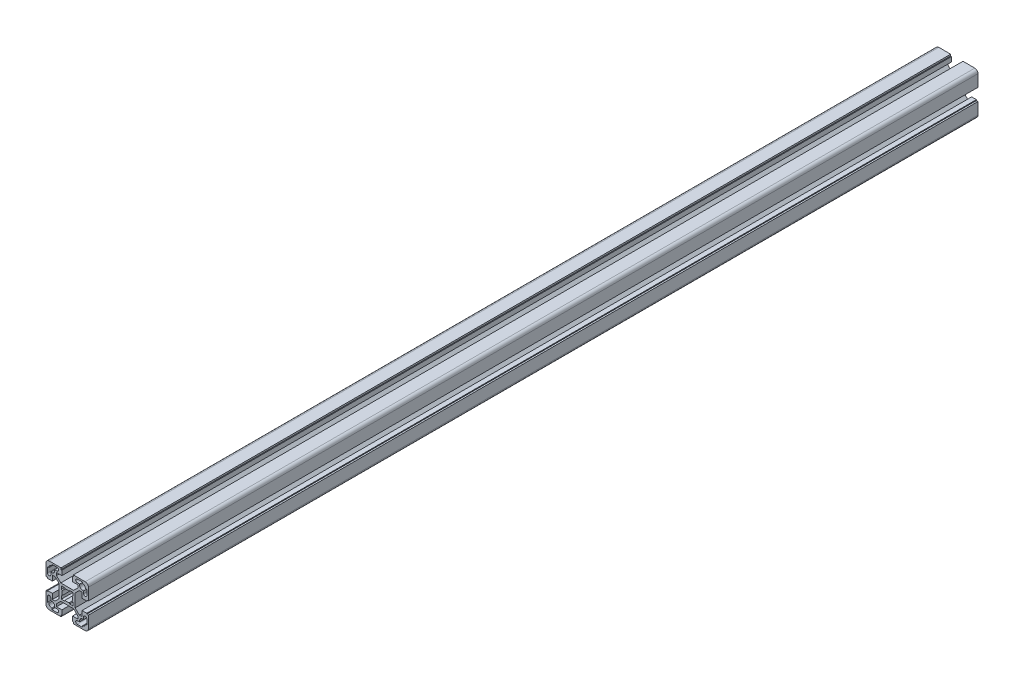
ISO-10303-21;
HEADER;
FILE_DESCRIPTION(('STEP AP214'),'2;1');
FILE_NAME('part.step','',(''),(''),'','','');
FILE_SCHEMA(('AUTOMOTIVE_DESIGN { 1 0 10303 214 1 1 1 1 }'));
ENDSEC;
DATA;
#1=APPLICATION_CONTEXT('core data for automotive mechanical design processes');
#2=APPLICATION_PROTOCOL_DEFINITION('international standard','automotive_design',2000,#1);
#3=PRODUCT_CONTEXT('',#1,'mechanical');
#4=PRODUCT('Part','Part','',(#3));
#5=PRODUCT_RELATED_PRODUCT_CATEGORY('part','',(#4));
#6=PRODUCT_DEFINITION_FORMATION('','',#4);
#7=PRODUCT_DEFINITION_CONTEXT('part definition',#1,'design');
#8=PRODUCT_DEFINITION('design','',#6,#7);
#9=PRODUCT_DEFINITION_SHAPE('','',#8);
#10=(LENGTH_UNIT() NAMED_UNIT(*) SI_UNIT(.MILLI.,.METRE.));
#11=(NAMED_UNIT(*) PLANE_ANGLE_UNIT() SI_UNIT($,.RADIAN.));
#12=(NAMED_UNIT(*) SI_UNIT($,.STERADIAN.) SOLID_ANGLE_UNIT());
#13=UNCERTAINTY_MEASURE_WITH_UNIT(LENGTH_MEASURE(1.E-05),#10,'distance_accuracy_value','');
#14=(GEOMETRIC_REPRESENTATION_CONTEXT(3) GLOBAL_UNCERTAINTY_ASSIGNED_CONTEXT((#13)) GLOBAL_UNIT_ASSIGNED_CONTEXT((#10,
#11,#12)) REPRESENTATION_CONTEXT('',''));
#15=CARTESIAN_POINT('',(0.,0.,0.));
#16=DIRECTION('',(0.,0.,1.));
#17=DIRECTION('',(1.,0.,0.));
#18=AXIS2_PLACEMENT_3D('',#15,#16,#17);
#19=CARTESIAN_POINT('',(-14.5000000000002,-11.75,840.));
#20=DIRECTION('',(0.,-1.,0.));
#21=DIRECTION('',(1.,0.,0.));
#22=AXIS2_PLACEMENT_3D('',#19,#20,#21);
#23=PLANE('',#22);
#24=DIRECTION('',(1.,0.,0.));
#25=VECTOR('',#24,1.);
#26=CARTESIAN_POINT('',(-14.5000000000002,-11.75,840.));
#27=LINE('',#26,#25);
#28=CARTESIAN_POINT('',(-14.5000000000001,-11.75,840.));
#29=VERTEX_POINT('',#28);
#30=CARTESIAN_POINT('',(-15.5000000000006,-11.75,840.));
#31=VERTEX_POINT('',#30);
#32=EDGE_CURVE('E806',#29,#31,#27,.F.);
#33=ORIENTED_EDGE('',*,*,#32,.T.);
#34=DIRECTION('',(0.,0.,1.));
#35=VECTOR('',#34,1.);
#36=CARTESIAN_POINT('',(-15.5000000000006,-11.75,840.));
#37=LINE('',#36,#35);
#38=CARTESIAN_POINT('',(-15.5000000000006,-11.75,0.));
#39=VERTEX_POINT('',#38);
#40=EDGE_CURVE('E804',#39,#31,#37,.T.);
#41=ORIENTED_EDGE('',*,*,#40,.F.);
#42=DIRECTION('',(1.,0.,0.));
#43=VECTOR('',#42,1.);
#44=CARTESIAN_POINT('',(-14.5000000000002,-11.75,0.));
#45=LINE('',#44,#43);
#46=CARTESIAN_POINT('',(-14.5000000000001,-11.75,0.));
#47=VERTEX_POINT('',#46);
#48=EDGE_CURVE('E20',#39,#47,#45,.T.);
#49=ORIENTED_EDGE('',*,*,#48,.T.);
#50=DIRECTION('',(0.,0.,-1.));
#51=VECTOR('',#50,1.);
#52=CARTESIAN_POINT('',(-14.5000000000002,-11.75,840.));
#53=LINE('',#52,#51);
#54=EDGE_CURVE('E801',#47,#29,#53,.F.);
#55=ORIENTED_EDGE('',*,*,#54,.T.);
#56=EDGE_LOOP('',(#33,#41,#49,#55));
#57=FACE_BOUND('',#56,.T.);
#58=ADVANCED_FACE('F17',(#57),#23,.T.);
#59=CARTESIAN_POINT('',(-11.7500000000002,-15.5,840.));
#60=DIRECTION('',(-1.,0.,0.));
#61=DIRECTION('',(0.,-1.,0.));
#62=AXIS2_PLACEMENT_3D('',#59,#60,#61);
#63=PLANE('',#62);
#64=DIRECTION('',(0.,-1.,0.));
#65=VECTOR('',#64,1.);
#66=CARTESIAN_POINT('',(-11.7500000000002,-15.5,840.));
#67=LINE('',#66,#65);
#68=CARTESIAN_POINT('',(-11.7500000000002,-15.5,840.));
#69=VERTEX_POINT('',#68);
#70=CARTESIAN_POINT('',(-11.7500000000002,-14.5,840.));
#71=VERTEX_POINT('',#70);
#72=EDGE_CURVE('E1218',#69,#71,#67,.F.);
#73=ORIENTED_EDGE('',*,*,#72,.T.);
#74=DIRECTION('',(0.,0.,-1.));
#75=VECTOR('',#74,1.);
#76=CARTESIAN_POINT('',(-11.7500000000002,-14.5,840.));
#77=LINE('',#76,#75);
#78=CARTESIAN_POINT('',(-11.7500000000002,-14.5,0.));
#79=VERTEX_POINT('',#78);
#80=EDGE_CURVE('E814',#71,#79,#77,.T.);
#81=ORIENTED_EDGE('',*,*,#80,.T.);
#82=DIRECTION('',(0.,-1.,0.));
#83=VECTOR('',#82,1.);
#84=CARTESIAN_POINT('',(-11.7500000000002,-15.5,0.));
#85=LINE('',#84,#83);
#86=CARTESIAN_POINT('',(-11.7500000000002,-15.5,0.));
#87=VERTEX_POINT('',#86);
#88=EDGE_CURVE('E819',#79,#87,#85,.T.);
#89=ORIENTED_EDGE('',*,*,#88,.T.);
#90=DIRECTION('',(0.,0.,-1.));
#91=VECTOR('',#90,1.);
#92=CARTESIAN_POINT('',(-11.7500000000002,-15.5,840.));
#93=LINE('',#92,#91);
#94=EDGE_CURVE('E1262',#69,#87,#93,.T.);
#95=ORIENTED_EDGE('',*,*,#94,.F.);
#96=EDGE_LOOP('',(#73,#81,#89,#95));
#97=FACE_BOUND('',#96,.T.);
#98=ADVANCED_FACE('F1555',(#97),#63,.T.);
#99=CARTESIAN_POINT('',(-14.5000000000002,-17.25,840.));
#100=DIRECTION('',(1.,0.,0.));
#101=DIRECTION('',(0.,0.,-1.));
#102=AXIS2_PLACEMENT_3D('',#99,#100,#101);
#103=PLANE('',#102);
#104=DIRECTION('',(0.,1.,0.));
#105=VECTOR('',#104,1.);
#106=CARTESIAN_POINT('',(-14.5000000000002,-17.25,840.));
#107=LINE('',#106,#105);
#108=CARTESIAN_POINT('',(-14.5000000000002,-17.25,840.));
#109=VERTEX_POINT('',#108);
#110=CARTESIAN_POINT('',(-14.5000000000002,-18.5,840.));
#111=VERTEX_POINT('',#110);
#112=EDGE_CURVE('E1214',#109,#111,#107,.F.);
#113=ORIENTED_EDGE('',*,*,#112,.T.);
#114=DIRECTION('',(0.,0.,1.));
#115=VECTOR('',#114,1.);
#116=CARTESIAN_POINT('',(-14.5000000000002,-18.5,840.));
#117=LINE('',#116,#115);
#118=CARTESIAN_POINT('',(-14.5000000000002,-18.5,0.));
#119=VERTEX_POINT('',#118);
#120=EDGE_CURVE('E1256',#119,#111,#117,.T.);
#121=ORIENTED_EDGE('',*,*,#120,.F.);
#122=DIRECTION('',(0.,1.,0.));
#123=VECTOR('',#122,1.);
#124=CARTESIAN_POINT('',(-14.5000000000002,-17.25,0.));
#125=LINE('',#124,#123);
#126=CARTESIAN_POINT('',(-14.5000000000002,-17.25,0.));
#127=VERTEX_POINT('',#126);
#128=EDGE_CURVE('E1216',#119,#127,#125,.T.);
#129=ORIENTED_EDGE('',*,*,#128,.T.);
#130=DIRECTION('',(0.,0.,-1.));
#131=VECTOR('',#130,1.);
#132=CARTESIAN_POINT('',(-14.5000000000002,-17.25,840.));
#133=LINE('',#132,#131);
#134=EDGE_CURVE('E1251',#127,#109,#133,.F.);
#135=ORIENTED_EDGE('',*,*,#134,.T.);
#136=EDGE_LOOP('',(#113,#121,#129,#135));
#137=FACE_BOUND('',#136,.T.);
#138=ADVANCED_FACE('F1560',(#137),#103,.T.);
#139=CARTESIAN_POINT('',(-18.5000000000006,-14.5000000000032,840.));
#140=DIRECTION('',(0.,1.,0.));
#141=DIRECTION('',(0.,0.,1.));
#142=AXIS2_PLACEMENT_3D('',#139,#140,#141);
#143=PLANE('',#142);
#144=DIRECTION('',(1.,0.,0.));
#145=VECTOR('',#144,1.);
#146=CARTESIAN_POINT('',(-18.5000000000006,-14.5000000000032,840.));
#147=LINE('',#146,#145);
#148=CARTESIAN_POINT('',(-18.5000000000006,-14.5000000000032,840.));
#149=VERTEX_POINT('',#148);
#150=CARTESIAN_POINT('',(-17.2500000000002,-14.5000000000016,840.));
#151=VERTEX_POINT('',#150);
#152=EDGE_CURVE('E1210',#149,#151,#147,.T.);
#153=ORIENTED_EDGE('',*,*,#152,.T.);
#154=DIRECTION('',(0.,0.,-1.));
#155=VECTOR('',#154,1.);
#156=CARTESIAN_POINT('',(-17.2500000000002,-14.5,840.));
#157=LINE('',#156,#155);
#158=CARTESIAN_POINT('',(-17.2500000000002,-14.5000000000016,0.));
#159=VERTEX_POINT('',#158);
#160=EDGE_CURVE('E1248',#151,#159,#157,.T.);
#161=ORIENTED_EDGE('',*,*,#160,.T.);
#162=DIRECTION('',(1.,0.,0.));
#163=VECTOR('',#162,1.);
#164=CARTESIAN_POINT('',(-18.5000000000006,-14.5000000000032,0.));
#165=LINE('',#164,#163);
#166=CARTESIAN_POINT('',(-18.5000000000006,-14.5000000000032,0.));
#167=VERTEX_POINT('',#166);
#168=EDGE_CURVE('E1212',#159,#167,#165,.F.);
#169=ORIENTED_EDGE('',*,*,#168,.T.);
#170=DIRECTION('',(0.,0.,-1.));
#171=VECTOR('',#170,1.);
#172=CARTESIAN_POINT('',(-18.5000000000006,-14.5000000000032,840.));
#173=LINE('',#172,#171);
#174=EDGE_CURVE('E1242',#149,#167,#173,.T.);
#175=ORIENTED_EDGE('',*,*,#174,.F.);
#176=EDGE_LOOP('',(#153,#161,#169,#175));
#177=FACE_BOUND('',#176,.T.);
#178=ADVANCED_FACE('F1569',(#177),#143,.T.);
#179=CARTESIAN_POINT('',(18.5000000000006,-14.5000000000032,840.));
#180=DIRECTION('',(0.,1.,0.));
#181=DIRECTION('',(0.,0.,1.));
#182=AXIS2_PLACEMENT_3D('',#179,#180,#181);
#183=PLANE('',#182);
#184=DIRECTION('',(1.,0.,0.));
#185=VECTOR('',#184,1.);
#186=CARTESIAN_POINT('',(18.5000000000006,-14.5000000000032,840.));
#187=LINE('',#186,#185);
#188=CARTESIAN_POINT('',(17.2500000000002,-14.5000000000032,840.));
#189=VERTEX_POINT('',#188);
#190=CARTESIAN_POINT('',(18.5000000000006,-14.5000000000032,840.));
#191=VERTEX_POINT('',#190);
#192=EDGE_CURVE('E1206',#189,#191,#187,.T.);
#193=ORIENTED_EDGE('',*,*,#192,.T.);
#194=DIRECTION('',(0.,0.,1.));
#195=VECTOR('',#194,1.);
#196=CARTESIAN_POINT('',(18.5000000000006,-14.5000000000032,840.));
#197=LINE('',#196,#195);
#198=CARTESIAN_POINT('',(18.5000000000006,-14.5000000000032,0.));
#199=VERTEX_POINT('',#198);
#200=EDGE_CURVE('E1947',#199,#191,#197,.T.);
#201=ORIENTED_EDGE('',*,*,#200,.F.);
#202=DIRECTION('',(1.,0.,0.));
#203=VECTOR('',#202,1.);
#204=CARTESIAN_POINT('',(18.5000000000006,-14.5000000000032,0.));
#205=LINE('',#204,#203);
#206=CARTESIAN_POINT('',(17.2500000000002,-14.5000000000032,0.));
#207=VERTEX_POINT('',#206);
#208=EDGE_CURVE('E1208',#199,#207,#205,.F.);
#209=ORIENTED_EDGE('',*,*,#208,.T.);
#210=DIRECTION('',(0.,0.,-1.));
#211=VECTOR('',#210,1.);
#212=CARTESIAN_POINT('',(17.2500000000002,-14.5000000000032,840.));
#213=LINE('',#212,#211);
#214=EDGE_CURVE('E1952',#207,#189,#213,.F.);
#215=ORIENTED_EDGE('',*,*,#214,.T.);
#216=EDGE_LOOP('',(#193,#201,#209,#215));
#217=FACE_BOUND('',#216,.T.);
#218=ADVANCED_FACE('F2472',(#217),#183,.T.);
#219=CARTESIAN_POINT('',(14.5000000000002,-17.25,840.));
#220=DIRECTION('',(-1.,0.,0.));
#221=DIRECTION('',(0.,0.,1.));
#222=AXIS2_PLACEMENT_3D('',#219,#220,#221);
#223=PLANE('',#222);
#224=DIRECTION('',(0.,1.,0.));
#225=VECTOR('',#224,1.);
#226=CARTESIAN_POINT('',(14.5000000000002,-17.25,840.));
#227=LINE('',#226,#225);
#228=CARTESIAN_POINT('',(14.5000000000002,-18.5,840.));
#229=VERTEX_POINT('',#228);
#230=CARTESIAN_POINT('',(14.5000000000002,-17.25,840.));
#231=VERTEX_POINT('',#230);
#232=EDGE_CURVE('E1202',#229,#231,#227,.T.);
#233=ORIENTED_EDGE('',*,*,#232,.T.);
#234=DIRECTION('',(0.,0.,-1.));
#235=VECTOR('',#234,1.);
#236=CARTESIAN_POINT('',(14.5000000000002,-17.25,840.));
#237=LINE('',#236,#235);
#238=CARTESIAN_POINT('',(14.5000000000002,-17.25,0.));
#239=VERTEX_POINT('',#238);
#240=EDGE_CURVE('E1955',#231,#239,#237,.T.);
#241=ORIENTED_EDGE('',*,*,#240,.T.);
#242=DIRECTION('',(0.,1.,0.));
#243=VECTOR('',#242,1.);
#244=CARTESIAN_POINT('',(14.5000000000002,-17.25,0.));
#245=LINE('',#244,#243);
#246=CARTESIAN_POINT('',(14.5000000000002,-18.5,0.));
#247=VERTEX_POINT('',#246);
#248=EDGE_CURVE('E1204',#239,#247,#245,.F.);
#249=ORIENTED_EDGE('',*,*,#248,.T.);
#250=DIRECTION('',(0.,0.,1.));
#251=VECTOR('',#250,1.);
#252=CARTESIAN_POINT('',(14.5000000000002,-18.5,840.));
#253=LINE('',#252,#251);
#254=EDGE_CURVE('E1958',#229,#247,#253,.F.);
#255=ORIENTED_EDGE('',*,*,#254,.F.);
#256=EDGE_LOOP('',(#233,#241,#249,#255));
#257=FACE_BOUND('',#256,.T.);
#258=ADVANCED_FACE('F2468',(#257),#223,.T.);
#259=CARTESIAN_POINT('',(11.7500000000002,-15.5,840.));
#260=DIRECTION('',(1.,0.,0.));
#261=DIRECTION('',(0.,1.,0.));
#262=AXIS2_PLACEMENT_3D('',#259,#260,#261);
#263=PLANE('',#262);
#264=DIRECTION('',(0.,1.,0.));
#265=VECTOR('',#264,1.);
#266=CARTESIAN_POINT('',(11.7500000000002,-15.5,840.));
#267=LINE('',#266,#265);
#268=CARTESIAN_POINT('',(11.7500000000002,-14.5,840.));
#269=VERTEX_POINT('',#268);
#270=CARTESIAN_POINT('',(11.7500000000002,-15.5,840.));
#271=VERTEX_POINT('',#270);
#272=EDGE_CURVE('E1198',#269,#271,#267,.F.);
#273=ORIENTED_EDGE('',*,*,#272,.T.);
#274=DIRECTION('',(0.,0.,-1.));
#275=VECTOR('',#274,1.);
#276=CARTESIAN_POINT('',(11.7500000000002,-15.5,840.));
#277=LINE('',#276,#275);
#278=CARTESIAN_POINT('',(11.7500000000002,-15.5,0.));
#279=VERTEX_POINT('',#278);
#280=EDGE_CURVE('E1964',#279,#271,#277,.F.);
#281=ORIENTED_EDGE('',*,*,#280,.F.);
#282=DIRECTION('',(0.,1.,0.));
#283=VECTOR('',#282,1.);
#284=CARTESIAN_POINT('',(11.7500000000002,-15.5,0.));
#285=LINE('',#284,#283);
#286=CARTESIAN_POINT('',(11.7500000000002,-14.5,0.));
#287=VERTEX_POINT('',#286);
#288=EDGE_CURVE('E1200',#279,#287,#285,.T.);
#289=ORIENTED_EDGE('',*,*,#288,.T.);
#290=DIRECTION('',(0.,0.,-1.));
#291=VECTOR('',#290,1.);
#292=CARTESIAN_POINT('',(11.7500000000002,-14.5,840.));
#293=LINE('',#292,#291);
#294=EDGE_CURVE('E1969',#287,#269,#293,.F.);
#295=ORIENTED_EDGE('',*,*,#294,.T.);
#296=EDGE_LOOP('',(#273,#281,#289,#295));
#297=FACE_BOUND('',#296,.T.);
#298=ADVANCED_FACE('F2465',(#297),#263,.T.);
#299=CARTESIAN_POINT('',(14.5000000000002,-11.75,840.));
#300=DIRECTION('',(0.,-1.,0.));
#301=DIRECTION('',(1.,0.,0.));
#302=AXIS2_PLACEMENT_3D('',#299,#300,#301);
#303=PLANE('',#302);
#304=DIRECTION('',(1.,0.,0.));
#305=VECTOR('',#304,1.);
#306=CARTESIAN_POINT('',(14.5000000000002,-11.75,840.));
#307=LINE('',#306,#305);
#308=CARTESIAN_POINT('',(15.5000000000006,-11.75,840.));
#309=VERTEX_POINT('',#308);
#310=CARTESIAN_POINT('',(14.5000000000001,-11.75,840.));
#311=VERTEX_POINT('',#310);
#312=EDGE_CURVE('E1194',#309,#311,#307,.F.);
#313=ORIENTED_EDGE('',*,*,#312,.T.);
#314=DIRECTION('',(0.,0.,-1.));
#315=VECTOR('',#314,1.);
#316=CARTESIAN_POINT('',(14.5000000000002,-11.75,840.));
#317=LINE('',#316,#315);
#318=CARTESIAN_POINT('',(14.5000000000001,-11.75,0.));
#319=VERTEX_POINT('',#318);
#320=EDGE_CURVE('E1940',#311,#319,#317,.T.);
#321=ORIENTED_EDGE('',*,*,#320,.T.);
#322=DIRECTION('',(1.,0.,0.));
#323=VECTOR('',#322,1.);
#324=CARTESIAN_POINT('',(14.5000000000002,-11.75,0.));
#325=LINE('',#324,#323);
#326=CARTESIAN_POINT('',(15.5000000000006,-11.75,0.));
#327=VERTEX_POINT('',#326);
#328=EDGE_CURVE('E1196',#319,#327,#325,.T.);
#329=ORIENTED_EDGE('',*,*,#328,.T.);
#330=DIRECTION('',(0.,0.,-1.));
#331=VECTOR('',#330,1.);
#332=CARTESIAN_POINT('',(15.5000000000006,-11.75,840.));
#333=LINE('',#332,#331);
#334=EDGE_CURVE('E1237',#309,#327,#333,.T.);
#335=ORIENTED_EDGE('',*,*,#334,.F.);
#336=EDGE_LOOP('',(#313,#321,#329,#335));
#337=FACE_BOUND('',#336,.T.);
#338=ADVANCED_FACE('F1939',(#337),#303,.T.);
#339=CARTESIAN_POINT('',(5.80000000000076,-18.5000000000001,840.));
#340=DIRECTION('',(1.,0.,0.));
#341=DIRECTION('',(0.,0.,-1.));
#342=AXIS2_PLACEMENT_3D('',#339,#340,#341);
#343=PLANE('',#342);
#344=DIRECTION('',(0.,0.,1.));
#345=VECTOR('',#344,1.);
#346=CARTESIAN_POINT('',(5.80000000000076,-20.,840.));
#347=LINE('',#346,#345);
#348=CARTESIAN_POINT('',(5.80000000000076,-20.,0.));
#349=VERTEX_POINT('',#348);
#350=CARTESIAN_POINT('',(5.80000000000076,-20.,840.));
#351=VERTEX_POINT('',#350);
#352=EDGE_CURVE('E1973',#349,#351,#347,.T.);
#353=ORIENTED_EDGE('',*,*,#352,.T.);
#354=DIRECTION('',(0.,1.,0.));
#355=VECTOR('',#354,1.);
#356=CARTESIAN_POINT('',(5.80000000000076,-17.,840.));
#357=LINE('',#356,#355);
#358=CARTESIAN_POINT('',(5.80000000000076,-18.5000000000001,840.));
#359=VERTEX_POINT('',#358);
#360=EDGE_CURVE('E1192',#359,#351,#357,.F.);
#361=ORIENTED_EDGE('',*,*,#360,.F.);
#362=DIRECTION('',(0.,0.,1.));
#363=VECTOR('',#362,1.);
#364=CARTESIAN_POINT('',(5.80000000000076,-18.5000000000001,840.));
#365=LINE('',#364,#363);
#366=CARTESIAN_POINT('',(5.80000000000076,-18.5000000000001,0.));
#367=VERTEX_POINT('',#366);
#368=EDGE_CURVE('E1116',#359,#367,#365,.F.);
#369=ORIENTED_EDGE('',*,*,#368,.T.);
#370=DIRECTION('',(0.,1.,0.));
#371=VECTOR('',#370,1.);
#372=CARTESIAN_POINT('',(5.80000000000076,-17.,0.));
#373=LINE('',#372,#371);
#374=EDGE_CURVE('E1190',#349,#367,#373,.T.);
#375=ORIENTED_EDGE('',*,*,#374,.F.);
#376=EDGE_LOOP('',(#353,#361,#369,#375));
#377=FACE_BOUND('',#376,.T.);
#378=ADVANCED_FACE('F2286',(#377),#343,.F.);
#379=CARTESIAN_POINT('',(20.,-5.79999999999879,840.));
#380=DIRECTION('',(0.,-1.,0.));
#381=DIRECTION('',(0.,0.,-1.));
#382=AXIS2_PLACEMENT_3D('',#379,#380,#381);
#383=PLANE('',#382);
#384=DIRECTION('',(0.,0.,1.));
#385=VECTOR('',#384,1.);
#386=CARTESIAN_POINT('',(18.5,-5.79999999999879,840.));
#387=LINE('',#386,#385);
#388=CARTESIAN_POINT('',(18.5,-5.79999999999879,0.));
#389=VERTEX_POINT('',#388);
#390=CARTESIAN_POINT('',(18.5,-5.79999999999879,840.));
#391=VERTEX_POINT('',#390);
#392=EDGE_CURVE('E1185',#389,#391,#387,.T.);
#393=ORIENTED_EDGE('',*,*,#392,.T.);
#394=DIRECTION('',(1.,0.,0.));
#395=VECTOR('',#394,1.);
#396=CARTESIAN_POINT('',(17.,-5.79999999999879,840.));
#397=LINE('',#396,#395);
#398=CARTESIAN_POINT('',(20.,-5.79999999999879,840.));
#399=VERTEX_POINT('',#398);
#400=EDGE_CURVE('E1188',#399,#391,#397,.F.);
#401=ORIENTED_EDGE('',*,*,#400,.F.);
#402=DIRECTION('',(0.,0.,1.));
#403=VECTOR('',#402,1.);
#404=CARTESIAN_POINT('',(20.,-5.79999999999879,840.));
#405=LINE('',#404,#403);
#406=CARTESIAN_POINT('',(20.,-5.79999999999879,0.));
#407=VERTEX_POINT('',#406);
#408=EDGE_CURVE('E1981',#399,#407,#405,.F.);
#409=ORIENTED_EDGE('',*,*,#408,.T.);
#410=DIRECTION('',(1.,0.,0.));
#411=VECTOR('',#410,1.);
#412=CARTESIAN_POINT('',(17.,-5.79999999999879,0.));
#413=LINE('',#412,#411);
#414=EDGE_CURVE('E1186',#389,#407,#413,.T.);
#415=ORIENTED_EDGE('',*,*,#414,.F.);
#416=EDGE_LOOP('',(#393,#401,#409,#415));
#417=FACE_BOUND('',#416,.T.);
#418=ADVANCED_FACE('F2294',(#417),#383,.F.);
#419=CARTESIAN_POINT('',(18.5,-5.79999999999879,840.));
#420=DIRECTION('',(-1.,0.,0.));
#421=DIRECTION('',(0.,0.,1.));
#422=AXIS2_PLACEMENT_3D('',#419,#420,#421);
#423=PLANE('',#422);
#424=DIRECTION('',(0.,0.,-1.));
#425=VECTOR('',#424,1.);
#426=CARTESIAN_POINT('',(18.5,-4.99999999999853,840.));
#427=LINE('',#426,#425);
#428=CARTESIAN_POINT('',(18.5,-4.99999999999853,0.));
#429=VERTEX_POINT('',#428);
#430=CARTESIAN_POINT('',(18.5,-4.99999999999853,840.));
#431=VERTEX_POINT('',#430);
#432=EDGE_CURVE('E1984',#429,#431,#427,.F.);
#433=ORIENTED_EDGE('',*,*,#432,.T.);
#434=DIRECTION('',(0.,1.,0.));
#435=VECTOR('',#434,1.);
#436=CARTESIAN_POINT('',(18.5,-17.,840.));
#437=LINE('',#436,#435);
#438=EDGE_CURVE('E1183',#391,#431,#437,.T.);
#439=ORIENTED_EDGE('',*,*,#438,.F.);
#440=ORIENTED_EDGE('',*,*,#392,.F.);
#441=DIRECTION('',(0.,1.,0.));
#442=VECTOR('',#441,1.);
#443=CARTESIAN_POINT('',(18.5,-17.,0.));
#444=LINE('',#443,#442);
#445=EDGE_CURVE('E1180',#429,#389,#444,.F.);
#446=ORIENTED_EDGE('',*,*,#445,.F.);
#447=EDGE_LOOP('',(#433,#439,#440,#446));
#448=FACE_BOUND('',#447,.T.);
#449=ADVANCED_FACE('F2297',(#448),#423,.F.);
#450=CARTESIAN_POINT('',(18.5,5.79999999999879,840.));
#451=DIRECTION('',(-1.,0.,0.));
#452=DIRECTION('',(0.,0.,1.));
#453=AXIS2_PLACEMENT_3D('',#450,#451,#452);
#454=PLANE('',#453);
#455=DIRECTION('',(0.,0.,1.));
#456=VECTOR('',#455,1.);
#457=CARTESIAN_POINT('',(18.5,5.79999999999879,840.));
#458=LINE('',#457,#456);
#459=CARTESIAN_POINT('',(18.5,5.79999999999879,0.));
#460=VERTEX_POINT('',#459);
#461=CARTESIAN_POINT('',(18.5,5.79999999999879,840.));
#462=VERTEX_POINT('',#461);
#463=EDGE_CURVE('E1175',#460,#462,#458,.T.);
#464=ORIENTED_EDGE('',*,*,#463,.T.);
#465=DIRECTION('',(0.,1.,0.));
#466=VECTOR('',#465,1.);
#467=CARTESIAN_POINT('',(18.5,-17.,840.));
#468=LINE('',#467,#466);
#469=CARTESIAN_POINT('',(18.5,4.99999999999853,840.));
#470=VERTEX_POINT('',#469);
#471=EDGE_CURVE('E1178',#470,#462,#468,.T.);
#472=ORIENTED_EDGE('',*,*,#471,.F.);
#473=DIRECTION('',(0.,0.,1.));
#474=VECTOR('',#473,1.);
#475=CARTESIAN_POINT('',(18.5,4.99999999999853,840.));
#476=LINE('',#475,#474);
#477=CARTESIAN_POINT('',(18.5,4.99999999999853,0.));
#478=VERTEX_POINT('',#477);
#479=EDGE_CURVE('E2011',#470,#478,#476,.F.);
#480=ORIENTED_EDGE('',*,*,#479,.T.);
#481=DIRECTION('',(0.,1.,0.));
#482=VECTOR('',#481,1.);
#483=CARTESIAN_POINT('',(18.5,-17.,0.));
#484=LINE('',#483,#482);
#485=EDGE_CURVE('E1176',#460,#478,#484,.F.);
#486=ORIENTED_EDGE('',*,*,#485,.F.);
#487=EDGE_LOOP('',(#464,#472,#480,#486));
#488=FACE_BOUND('',#487,.T.);
#489=ADVANCED_FACE('F2319',(#488),#454,.F.);
#490=CARTESIAN_POINT('',(20.,5.79999999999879,840.));
#491=DIRECTION('',(0.,1.,0.));
#492=DIRECTION('',(0.,0.,1.));
#493=AXIS2_PLACEMENT_3D('',#490,#491,#492);
#494=PLANE('',#493);
#495=DIRECTION('',(0.,0.,1.));
#496=VECTOR('',#495,1.);
#497=CARTESIAN_POINT('',(20.,5.79999999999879,840.));
#498=LINE('',#497,#496);
#499=CARTESIAN_POINT('',(20.,5.79999999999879,0.));
#500=VERTEX_POINT('',#499);
#501=CARTESIAN_POINT('',(20.,5.79999999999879,840.));
#502=VERTEX_POINT('',#501);
#503=EDGE_CURVE('E2014',#500,#502,#498,.T.);
#504=ORIENTED_EDGE('',*,*,#503,.T.);
#505=DIRECTION('',(1.,0.,0.));
#506=VECTOR('',#505,1.);
#507=CARTESIAN_POINT('',(17.,5.79999999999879,840.));
#508=LINE('',#507,#506);
#509=EDGE_CURVE('E1173',#462,#502,#508,.T.);
#510=ORIENTED_EDGE('',*,*,#509,.F.);
#511=ORIENTED_EDGE('',*,*,#463,.F.);
#512=DIRECTION('',(1.,0.,0.));
#513=VECTOR('',#512,1.);
#514=CARTESIAN_POINT('',(17.,5.79999999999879,0.));
#515=LINE('',#514,#513);
#516=EDGE_CURVE('E1170',#500,#460,#515,.F.);
#517=ORIENTED_EDGE('',*,*,#516,.F.);
#518=EDGE_LOOP('',(#504,#510,#511,#517));
#519=FACE_BOUND('',#518,.T.);
#520=ADVANCED_FACE('F2323',(#519),#494,.F.);
#521=CARTESIAN_POINT('',(5.80000000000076,18.5000000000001,840.));
#522=DIRECTION('',(1.,0.,0.));
#523=DIRECTION('',(0.,0.,-1.));
#524=AXIS2_PLACEMENT_3D('',#521,#522,#523);
#525=PLANE('',#524);
#526=DIRECTION('',(0.,0.,-1.));
#527=VECTOR('',#526,1.);
#528=CARTESIAN_POINT('',(5.80000000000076,18.5000000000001,840.));
#529=LINE('',#528,#527);
#530=CARTESIAN_POINT('',(5.80000000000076,18.5000000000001,0.));
#531=VERTEX_POINT('',#530);
#532=CARTESIAN_POINT('',(5.80000000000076,18.5000000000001,840.));
#533=VERTEX_POINT('',#532);
#534=EDGE_CURVE('E1165',#531,#533,#529,.F.);
#535=ORIENTED_EDGE('',*,*,#534,.T.);
#536=DIRECTION('',(0.,1.,0.));
#537=VECTOR('',#536,1.);
#538=CARTESIAN_POINT('',(5.80000000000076,-17.,840.));
#539=LINE('',#538,#537);
#540=CARTESIAN_POINT('',(5.80000000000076,20.,840.));
#541=VERTEX_POINT('',#540);
#542=EDGE_CURVE('E1168',#541,#533,#539,.F.);
#543=ORIENTED_EDGE('',*,*,#542,.F.);
#544=DIRECTION('',(0.,0.,-1.));
#545=VECTOR('',#544,1.);
#546=CARTESIAN_POINT('',(5.80000000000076,20.,840.));
#547=LINE('',#546,#545);
#548=CARTESIAN_POINT('',(5.80000000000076,20.,0.));
#549=VERTEX_POINT('',#548);
#550=EDGE_CURVE('E2022',#541,#549,#547,.T.);
#551=ORIENTED_EDGE('',*,*,#550,.T.);
#552=DIRECTION('',(0.,1.,0.));
#553=VECTOR('',#552,1.);
#554=CARTESIAN_POINT('',(5.80000000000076,-17.,0.));
#555=LINE('',#554,#553);
#556=EDGE_CURVE('E1166',#531,#549,#555,.T.);
#557=ORIENTED_EDGE('',*,*,#556,.F.);
#558=EDGE_LOOP('',(#535,#543,#551,#557));
#559=FACE_BOUND('',#558,.T.);
#560=ADVANCED_FACE('F2334',(#559),#525,.F.);
#561=CARTESIAN_POINT('',(5.00000000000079,18.5000000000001,840.));
#562=DIRECTION('',(0.,-1.,0.));
#563=DIRECTION('',(0.,0.,-1.));
#564=AXIS2_PLACEMENT_3D('',#561,#562,#563);
#565=PLANE('',#564);
#566=DIRECTION('',(0.,0.,1.));
#567=VECTOR('',#566,1.);
#568=CARTESIAN_POINT('',(5.00000000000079,18.5000000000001,840.));
#569=LINE('',#568,#567);
#570=CARTESIAN_POINT('',(5.00000000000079,18.5000000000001,0.));
#571=VERTEX_POINT('',#570);
#572=CARTESIAN_POINT('',(5.00000000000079,18.5000000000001,840.));
#573=VERTEX_POINT('',#572);
#574=EDGE_CURVE('E2025',#571,#573,#569,.T.);
#575=ORIENTED_EDGE('',*,*,#574,.T.);
#576=DIRECTION('',(1.,0.,0.));
#577=VECTOR('',#576,1.);
#578=CARTESIAN_POINT('',(17.,18.5000000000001,840.));
#579=LINE('',#578,#577);
#580=EDGE_CURVE('E1163',#533,#573,#579,.F.);
#581=ORIENTED_EDGE('',*,*,#580,.F.);
#582=ORIENTED_EDGE('',*,*,#534,.F.);
#583=DIRECTION('',(1.,0.,0.));
#584=VECTOR('',#583,1.);
#585=CARTESIAN_POINT('',(17.,18.5000000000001,0.));
#586=LINE('',#585,#584);
#587=EDGE_CURVE('E1160',#571,#531,#586,.T.);
#588=ORIENTED_EDGE('',*,*,#587,.F.);
#589=EDGE_LOOP('',(#575,#581,#582,#588));
#590=FACE_BOUND('',#589,.T.);
#591=ADVANCED_FACE('F2338',(#590),#565,.F.);
#592=CARTESIAN_POINT('',(-5.00000000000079,18.5000000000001,840.));
#593=DIRECTION('',(0.,-1.,0.));
#594=DIRECTION('',(0.,0.,-1.));
#595=AXIS2_PLACEMENT_3D('',#592,#593,#594);
#596=PLANE('',#595);
#597=DIRECTION('',(0.,0.,1.));
#598=VECTOR('',#597,1.);
#599=CARTESIAN_POINT('',(-5.80000000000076,18.5000000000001,840.));
#600=LINE('',#599,#598);
#601=CARTESIAN_POINT('',(-5.80000000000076,18.5000000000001,0.));
#602=VERTEX_POINT('',#601);
#603=CARTESIAN_POINT('',(-5.80000000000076,18.5000000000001,840.));
#604=VERTEX_POINT('',#603);
#605=EDGE_CURVE('E1155',#602,#604,#600,.T.);
#606=ORIENTED_EDGE('',*,*,#605,.T.);
#607=DIRECTION('',(1.,0.,0.));
#608=VECTOR('',#607,1.);
#609=CARTESIAN_POINT('',(17.,18.5000000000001,840.));
#610=LINE('',#609,#608);
#611=CARTESIAN_POINT('',(-5.00000000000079,18.5000000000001,840.));
#612=VERTEX_POINT('',#611);
#613=EDGE_CURVE('E1158',#612,#604,#610,.F.);
#614=ORIENTED_EDGE('',*,*,#613,.F.);
#615=DIRECTION('',(0.,0.,1.));
#616=VECTOR('',#615,1.);
#617=CARTESIAN_POINT('',(-5.00000000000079,18.5000000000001,840.));
#618=LINE('',#617,#616);
#619=CARTESIAN_POINT('',(-5.00000000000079,18.5000000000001,0.));
#620=VERTEX_POINT('',#619);
#621=EDGE_CURVE('E2052',#612,#620,#618,.F.);
#622=ORIENTED_EDGE('',*,*,#621,.T.);
#623=DIRECTION('',(1.,0.,0.));
#624=VECTOR('',#623,1.);
#625=CARTESIAN_POINT('',(17.,18.5000000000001,0.));
#626=LINE('',#625,#624);
#627=EDGE_CURVE('E1156',#602,#620,#626,.T.);
#628=ORIENTED_EDGE('',*,*,#627,.F.);
#629=EDGE_LOOP('',(#606,#614,#622,#628));
#630=FACE_BOUND('',#629,.T.);
#631=ADVANCED_FACE('F2360',(#630),#596,.F.);
#632=CARTESIAN_POINT('',(-5.80000000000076,18.5000000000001,840.));
#633=DIRECTION('',(-1.,0.,0.));
#634=DIRECTION('',(0.,0.,1.));
#635=AXIS2_PLACEMENT_3D('',#632,#633,#634);
#636=PLANE('',#635);
#637=DIRECTION('',(0.,0.,1.));
#638=VECTOR('',#637,1.);
#639=CARTESIAN_POINT('',(-5.80000000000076,20.,840.));
#640=LINE('',#639,#638);
#641=CARTESIAN_POINT('',(-5.80000000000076,20.,0.));
#642=VERTEX_POINT('',#641);
#643=CARTESIAN_POINT('',(-5.80000000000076,20.,840.));
#644=VERTEX_POINT('',#643);
#645=EDGE_CURVE('E2055',#642,#644,#640,.T.);
#646=ORIENTED_EDGE('',*,*,#645,.T.);
#647=DIRECTION('',(0.,1.,0.));
#648=VECTOR('',#647,1.);
#649=CARTESIAN_POINT('',(-5.80000000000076,-17.,840.));
#650=LINE('',#649,#648);
#651=EDGE_CURVE('E1153',#604,#644,#650,.T.);
#652=ORIENTED_EDGE('',*,*,#651,.F.);
#653=ORIENTED_EDGE('',*,*,#605,.F.);
#654=DIRECTION('',(0.,1.,0.));
#655=VECTOR('',#654,1.);
#656=CARTESIAN_POINT('',(-5.80000000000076,-17.,0.));
#657=LINE('',#656,#655);
#658=EDGE_CURVE('E1150',#642,#602,#657,.F.);
#659=ORIENTED_EDGE('',*,*,#658,.F.);
#660=EDGE_LOOP('',(#646,#652,#653,#659));
#661=FACE_BOUND('',#660,.T.);
#662=ADVANCED_FACE('F2364',(#661),#636,.F.);
#663=CARTESIAN_POINT('',(-20.,5.79999999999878,840.));
#664=DIRECTION('',(0.,1.,0.));
#665=DIRECTION('',(0.,0.,1.));
#666=AXIS2_PLACEMENT_3D('',#663,#664,#665);
#667=PLANE('',#666);
#668=DIRECTION('',(0.,0.,-1.));
#669=VECTOR('',#668,1.);
#670=CARTESIAN_POINT('',(-18.5,5.79999999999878,840.));
#671=LINE('',#670,#669);
#672=CARTESIAN_POINT('',(-18.5,5.79999999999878,0.));
#673=VERTEX_POINT('',#672);
#674=CARTESIAN_POINT('',(-18.5,5.79999999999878,840.));
#675=VERTEX_POINT('',#674);
#676=EDGE_CURVE('E1145',#673,#675,#671,.F.);
#677=ORIENTED_EDGE('',*,*,#676,.T.);
#678=DIRECTION('',(1.,0.,0.));
#679=VECTOR('',#678,1.);
#680=CARTESIAN_POINT('',(17.,5.79999999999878,840.));
#681=LINE('',#680,#679);
#682=CARTESIAN_POINT('',(-20.,5.79999999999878,840.));
#683=VERTEX_POINT('',#682);
#684=EDGE_CURVE('E1148',#683,#675,#681,.T.);
#685=ORIENTED_EDGE('',*,*,#684,.F.);
#686=DIRECTION('',(0.,0.,1.));
#687=VECTOR('',#686,1.);
#688=CARTESIAN_POINT('',(-20.,5.79999999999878,840.));
#689=LINE('',#688,#687);
#690=CARTESIAN_POINT('',(-20.,5.79999999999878,0.));
#691=VERTEX_POINT('',#690);
#692=EDGE_CURVE('E2063',#683,#691,#689,.F.);
#693=ORIENTED_EDGE('',*,*,#692,.T.);
#694=DIRECTION('',(1.,0.,0.));
#695=VECTOR('',#694,1.);
#696=CARTESIAN_POINT('',(17.,5.79999999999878,0.));
#697=LINE('',#696,#695);
#698=EDGE_CURVE('E1146',#673,#691,#697,.F.);
#699=ORIENTED_EDGE('',*,*,#698,.F.);
#700=EDGE_LOOP('',(#677,#685,#693,#699));
#701=FACE_BOUND('',#700,.T.);
#702=ADVANCED_FACE('F2375',(#701),#667,.F.);
#703=CARTESIAN_POINT('',(-18.5,5.79999999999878,840.));
#704=DIRECTION('',(1.,0.,0.));
#705=DIRECTION('',(0.,0.,-1.));
#706=AXIS2_PLACEMENT_3D('',#703,#704,#705);
#707=PLANE('',#706);
#708=DIRECTION('',(0.,0.,1.));
#709=VECTOR('',#708,1.);
#710=CARTESIAN_POINT('',(-18.5,4.99999999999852,840.));
#711=LINE('',#710,#709);
#712=CARTESIAN_POINT('',(-18.5,4.99999999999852,0.));
#713=VERTEX_POINT('',#712);
#714=CARTESIAN_POINT('',(-18.5,4.99999999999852,840.));
#715=VERTEX_POINT('',#714);
#716=EDGE_CURVE('E2066',#713,#715,#711,.T.);
#717=ORIENTED_EDGE('',*,*,#716,.T.);
#718=DIRECTION('',(0.,1.,0.));
#719=VECTOR('',#718,1.);
#720=CARTESIAN_POINT('',(-18.5,-17.,840.));
#721=LINE('',#720,#719);
#722=EDGE_CURVE('E1143',#675,#715,#721,.F.);
#723=ORIENTED_EDGE('',*,*,#722,.F.);
#724=ORIENTED_EDGE('',*,*,#676,.F.);
#725=DIRECTION('',(0.,1.,0.));
#726=VECTOR('',#725,1.);
#727=CARTESIAN_POINT('',(-18.5,-17.,0.));
#728=LINE('',#727,#726);
#729=EDGE_CURVE('E1140',#713,#673,#728,.T.);
#730=ORIENTED_EDGE('',*,*,#729,.F.);
#731=EDGE_LOOP('',(#717,#723,#724,#730));
#732=FACE_BOUND('',#731,.T.);
#733=ADVANCED_FACE('F2379',(#732),#707,.F.);
#734=CARTESIAN_POINT('',(-18.5,-5.79999999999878,840.));
#735=DIRECTION('',(1.,0.,0.));
#736=DIRECTION('',(0.,0.,-1.));
#737=AXIS2_PLACEMENT_3D('',#734,#735,#736);
#738=PLANE('',#737);
#739=DIRECTION('',(0.,0.,-1.));
#740=VECTOR('',#739,1.);
#741=CARTESIAN_POINT('',(-18.5,-5.79999999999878,840.));
#742=LINE('',#741,#740);
#743=CARTESIAN_POINT('',(-18.5,-5.79999999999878,0.));
#744=VERTEX_POINT('',#743);
#745=CARTESIAN_POINT('',(-18.5,-5.79999999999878,840.));
#746=VERTEX_POINT('',#745);
#747=EDGE_CURVE('E1135',#744,#746,#742,.F.);
#748=ORIENTED_EDGE('',*,*,#747,.T.);
#749=DIRECTION('',(0.,1.,0.));
#750=VECTOR('',#749,1.);
#751=CARTESIAN_POINT('',(-18.5,-17.,840.));
#752=LINE('',#751,#750);
#753=CARTESIAN_POINT('',(-18.5,-4.99999999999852,840.));
#754=VERTEX_POINT('',#753);
#755=EDGE_CURVE('E1138',#754,#746,#752,.F.);
#756=ORIENTED_EDGE('',*,*,#755,.F.);
#757=DIRECTION('',(0.,0.,1.));
#758=VECTOR('',#757,1.);
#759=CARTESIAN_POINT('',(-18.5,-4.99999999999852,840.));
#760=LINE('',#759,#758);
#761=CARTESIAN_POINT('',(-18.5,-4.99999999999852,0.));
#762=VERTEX_POINT('',#761);
#763=EDGE_CURVE('E2093',#754,#762,#760,.F.);
#764=ORIENTED_EDGE('',*,*,#763,.T.);
#765=DIRECTION('',(0.,1.,0.));
#766=VECTOR('',#765,1.);
#767=CARTESIAN_POINT('',(-18.5,-17.,0.));
#768=LINE('',#767,#766);
#769=EDGE_CURVE('E1136',#744,#762,#768,.T.);
#770=ORIENTED_EDGE('',*,*,#769,.F.);
#771=EDGE_LOOP('',(#748,#756,#764,#770));
#772=FACE_BOUND('',#771,.T.);
#773=ADVANCED_FACE('F2401',(#772),#738,.F.);
#774=CARTESIAN_POINT('',(-20.,-5.79999999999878,840.));
#775=DIRECTION('',(0.,-1.,0.));
#776=DIRECTION('',(0.,0.,-1.));
#777=AXIS2_PLACEMENT_3D('',#774,#775,#776);
#778=PLANE('',#777);
#779=DIRECTION('',(0.,0.,1.));
#780=VECTOR('',#779,1.);
#781=CARTESIAN_POINT('',(-20.,-5.79999999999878,840.));
#782=LINE('',#781,#780);
#783=CARTESIAN_POINT('',(-20.,-5.79999999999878,0.));
#784=VERTEX_POINT('',#783);
#785=CARTESIAN_POINT('',(-20.,-5.79999999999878,840.));
#786=VERTEX_POINT('',#785);
#787=EDGE_CURVE('E2096',#784,#786,#782,.T.);
#788=ORIENTED_EDGE('',*,*,#787,.T.);
#789=DIRECTION('',(1.,0.,0.));
#790=VECTOR('',#789,1.);
#791=CARTESIAN_POINT('',(17.,-5.79999999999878,840.));
#792=LINE('',#791,#790);
#793=EDGE_CURVE('E1133',#746,#786,#792,.F.);
#794=ORIENTED_EDGE('',*,*,#793,.F.);
#795=ORIENTED_EDGE('',*,*,#747,.F.);
#796=DIRECTION('',(1.,0.,0.));
#797=VECTOR('',#796,1.);
#798=CARTESIAN_POINT('',(17.,-5.79999999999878,0.));
#799=LINE('',#798,#797);
#800=EDGE_CURVE('E1130',#784,#744,#799,.T.);
#801=ORIENTED_EDGE('',*,*,#800,.F.);
#802=EDGE_LOOP('',(#788,#794,#795,#801));
#803=FACE_BOUND('',#802,.T.);
#804=ADVANCED_FACE('F2405',(#803),#778,.F.);
#805=CARTESIAN_POINT('',(-5.80000000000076,-18.5000000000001,840.));
#806=DIRECTION('',(-1.,0.,0.));
#807=DIRECTION('',(0.,0.,1.));
#808=AXIS2_PLACEMENT_3D('',#805,#806,#807);
#809=PLANE('',#808);
#810=DIRECTION('',(0.,0.,1.));
#811=VECTOR('',#810,1.);
#812=CARTESIAN_POINT('',(-5.80000000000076,-18.5000000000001,840.));
#813=LINE('',#812,#811);
#814=CARTESIAN_POINT('',(-5.80000000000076,-18.5000000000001,0.));
#815=VERTEX_POINT('',#814);
#816=CARTESIAN_POINT('',(-5.80000000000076,-18.5000000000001,840.));
#817=VERTEX_POINT('',#816);
#818=EDGE_CURVE('E1125',#815,#817,#813,.T.);
#819=ORIENTED_EDGE('',*,*,#818,.T.);
#820=DIRECTION('',(0.,1.,0.));
#821=VECTOR('',#820,1.);
#822=CARTESIAN_POINT('',(-5.80000000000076,-17.,840.));
#823=LINE('',#822,#821);
#824=CARTESIAN_POINT('',(-5.80000000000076,-20.,840.));
#825=VERTEX_POINT('',#824);
#826=EDGE_CURVE('E1128',#825,#817,#823,.T.);
#827=ORIENTED_EDGE('',*,*,#826,.F.);
#828=DIRECTION('',(0.,0.,1.));
#829=VECTOR('',#828,1.);
#830=CARTESIAN_POINT('',(-5.80000000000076,-20.,840.));
#831=LINE('',#830,#829);
#832=CARTESIAN_POINT('',(-5.80000000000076,-20.,0.));
#833=VERTEX_POINT('',#832);
#834=EDGE_CURVE('E2104',#825,#833,#831,.F.);
#835=ORIENTED_EDGE('',*,*,#834,.T.);
#836=DIRECTION('',(0.,1.,0.));
#837=VECTOR('',#836,1.);
#838=CARTESIAN_POINT('',(-5.80000000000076,-17.,0.));
#839=LINE('',#838,#837);
#840=EDGE_CURVE('E1126',#815,#833,#839,.F.);
#841=ORIENTED_EDGE('',*,*,#840,.F.);
#842=EDGE_LOOP('',(#819,#827,#835,#841));
#843=FACE_BOUND('',#842,.T.);
#844=ADVANCED_FACE('F2416',(#843),#809,.F.);
#845=CARTESIAN_POINT('',(-5.00000000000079,-18.5000000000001,840.));
#846=DIRECTION('',(0.,1.,0.));
#847=DIRECTION('',(0.,0.,1.));
#848=AXIS2_PLACEMENT_3D('',#845,#846,#847);
#849=PLANE('',#848);
#850=DIRECTION('',(0.,0.,1.));
#851=VECTOR('',#850,1.);
#852=CARTESIAN_POINT('',(-5.00000000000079,-18.5000000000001,840.));
#853=LINE('',#852,#851);
#854=CARTESIAN_POINT('',(-5.00000000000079,-18.5000000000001,0.));
#855=VERTEX_POINT('',#854);
#856=CARTESIAN_POINT('',(-5.00000000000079,-18.5000000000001,840.));
#857=VERTEX_POINT('',#856);
#858=EDGE_CURVE('E2107',#855,#857,#853,.T.);
#859=ORIENTED_EDGE('',*,*,#858,.T.);
#860=DIRECTION('',(1.,0.,0.));
#861=VECTOR('',#860,1.);
#862=CARTESIAN_POINT('',(17.,-18.5000000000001,840.));
#863=LINE('',#862,#861);
#864=EDGE_CURVE('E1123',#817,#857,#863,.T.);
#865=ORIENTED_EDGE('',*,*,#864,.F.);
#866=ORIENTED_EDGE('',*,*,#818,.F.);
#867=DIRECTION('',(1.,0.,0.));
#868=VECTOR('',#867,1.);
#869=CARTESIAN_POINT('',(17.,-18.5000000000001,0.));
#870=LINE('',#869,#868);
#871=EDGE_CURVE('E1120',#855,#815,#870,.F.);
#872=ORIENTED_EDGE('',*,*,#871,.F.);
#873=EDGE_LOOP('',(#859,#865,#866,#872));
#874=FACE_BOUND('',#873,.T.);
#875=ADVANCED_FACE('F2420',(#874),#849,.F.);
#876=CARTESIAN_POINT('',(5.00000000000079,-18.5000000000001,840.));
#877=DIRECTION('',(0.,1.,0.));
#878=DIRECTION('',(0.,0.,1.));
#879=AXIS2_PLACEMENT_3D('',#876,#877,#878);
#880=PLANE('',#879);
#881=ORIENTED_EDGE('',*,*,#368,.F.);
#882=DIRECTION('',(1.,0.,0.));
#883=VECTOR('',#882,1.);
#884=CARTESIAN_POINT('',(17.,-18.5000000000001,840.));
#885=LINE('',#884,#883);
#886=CARTESIAN_POINT('',(5.00000000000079,-18.5000000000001,840.));
#887=VERTEX_POINT('',#886);
#888=EDGE_CURVE('E1117',#887,#359,#885,.T.);
#889=ORIENTED_EDGE('',*,*,#888,.F.);
#890=DIRECTION('',(0.,0.,1.));
#891=VECTOR('',#890,1.);
#892=CARTESIAN_POINT('',(5.00000000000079,-18.5000000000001,840.));
#893=LINE('',#892,#891);
#894=CARTESIAN_POINT('',(5.00000000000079,-18.5000000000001,0.));
#895=VERTEX_POINT('',#894);
#896=EDGE_CURVE('E2126',#887,#895,#893,.F.);
#897=ORIENTED_EDGE('',*,*,#896,.T.);
#898=DIRECTION('',(1.,0.,0.));
#899=VECTOR('',#898,1.);
#900=CARTESIAN_POINT('',(17.,-18.5000000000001,0.));
#901=LINE('',#900,#899);
#902=EDGE_CURVE('E1114',#367,#895,#901,.F.);
#903=ORIENTED_EDGE('',*,*,#902,.F.);
#904=EDGE_LOOP('',(#881,#889,#897,#903));
#905=FACE_BOUND('',#904,.T.);
#906=ADVANCED_FACE('F2277',(#905),#880,.F.);
#907=CARTESIAN_POINT('',(14.5000000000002,11.75,840.));
#908=DIRECTION('',(0.,1.,0.));
#909=DIRECTION('',(-1.,0.,0.));
#910=AXIS2_PLACEMENT_3D('',#907,#908,#909);
#911=PLANE('',#910);
#912=DIRECTION('',(-1.,0.,0.));
#913=VECTOR('',#912,1.);
#914=CARTESIAN_POINT('',(14.5000000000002,11.75,840.));
#915=LINE('',#914,#913);
#916=CARTESIAN_POINT('',(14.5000000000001,11.75,840.));
#917=VERTEX_POINT('',#916);
#918=CARTESIAN_POINT('',(15.5000000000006,11.75,840.));
#919=VERTEX_POINT('',#918);
#920=EDGE_CURVE('E1110',#917,#919,#915,.F.);
#921=ORIENTED_EDGE('',*,*,#920,.T.);
#922=DIRECTION('',(0.,0.,-1.));
#923=VECTOR('',#922,1.);
#924=CARTESIAN_POINT('',(15.5000000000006,11.75,840.));
#925=LINE('',#924,#923);
#926=CARTESIAN_POINT('',(15.5000000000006,11.75,0.));
#927=VERTEX_POINT('',#926);
#928=EDGE_CURVE('E2129',#927,#919,#925,.F.);
#929=ORIENTED_EDGE('',*,*,#928,.F.);
#930=DIRECTION('',(-1.,0.,0.));
#931=VECTOR('',#930,1.);
#932=CARTESIAN_POINT('',(14.5000000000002,11.75,0.));
#933=LINE('',#932,#931);
#934=CARTESIAN_POINT('',(14.5000000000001,11.75,0.));
#935=VERTEX_POINT('',#934);
#936=EDGE_CURVE('E1112',#927,#935,#933,.T.);
#937=ORIENTED_EDGE('',*,*,#936,.T.);
#938=DIRECTION('',(0.,0.,-1.));
#939=VECTOR('',#938,1.);
#940=CARTESIAN_POINT('',(14.5000000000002,11.75,840.));
#941=LINE('',#940,#939);
#942=EDGE_CURVE('E2132',#935,#917,#941,.F.);
#943=ORIENTED_EDGE('',*,*,#942,.T.);
#944=EDGE_LOOP('',(#921,#929,#937,#943));
#945=FACE_BOUND('',#944,.T.);
#946=ADVANCED_FACE('F2432',(#945),#911,.T.);
#947=CARTESIAN_POINT('',(11.7500000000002,15.5,840.));
#948=DIRECTION('',(1.,0.,0.));
#949=DIRECTION('',(0.,1.,0.));
#950=AXIS2_PLACEMENT_3D('',#947,#948,#949);
#951=PLANE('',#950);
#952=DIRECTION('',(0.,1.,0.));
#953=VECTOR('',#952,1.);
#954=CARTESIAN_POINT('',(11.7500000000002,15.5,840.));
#955=LINE('',#954,#953);
#956=CARTESIAN_POINT('',(11.7500000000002,15.5,840.));
#957=VERTEX_POINT('',#956);
#958=CARTESIAN_POINT('',(11.7500000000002,14.5,840.));
#959=VERTEX_POINT('',#958);
#960=EDGE_CURVE('E1106',#957,#959,#955,.F.);
#961=ORIENTED_EDGE('',*,*,#960,.T.);
#962=DIRECTION('',(0.,0.,-1.));
#963=VECTOR('',#962,1.);
#964=CARTESIAN_POINT('',(11.7500000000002,14.5,840.));
#965=LINE('',#964,#963);
#966=CARTESIAN_POINT('',(11.7500000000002,14.5,0.));
#967=VERTEX_POINT('',#966);
#968=EDGE_CURVE('E2135',#959,#967,#965,.T.);
#969=ORIENTED_EDGE('',*,*,#968,.T.);
#970=DIRECTION('',(0.,1.,0.));
#971=VECTOR('',#970,1.);
#972=CARTESIAN_POINT('',(11.7500000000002,15.5,0.));
#973=LINE('',#972,#971);
#974=CARTESIAN_POINT('',(11.7500000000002,15.5,0.));
#975=VERTEX_POINT('',#974);
#976=EDGE_CURVE('E1108',#967,#975,#973,.T.);
#977=ORIENTED_EDGE('',*,*,#976,.T.);
#978=DIRECTION('',(0.,0.,1.));
#979=VECTOR('',#978,1.);
#980=CARTESIAN_POINT('',(11.7500000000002,15.5,840.));
#981=LINE('',#980,#979);
#982=EDGE_CURVE('E2138',#957,#975,#981,.F.);
#983=ORIENTED_EDGE('',*,*,#982,.F.);
#984=EDGE_LOOP('',(#961,#969,#977,#983));
#985=FACE_BOUND('',#984,.T.);
#986=ADVANCED_FACE('F2634',(#985),#951,.T.);
#987=CARTESIAN_POINT('',(14.5000000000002,17.25,840.));
#988=DIRECTION('',(-1.,0.,0.));
#989=DIRECTION('',(0.,0.,1.));
#990=AXIS2_PLACEMENT_3D('',#987,#988,#989);
#991=PLANE('',#990);
#992=DIRECTION('',(0.,1.,0.));
#993=VECTOR('',#992,1.);
#994=CARTESIAN_POINT('',(14.5000000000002,17.25,840.));
#995=LINE('',#994,#993);
#996=CARTESIAN_POINT('',(14.5000000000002,17.25,840.));
#997=VERTEX_POINT('',#996);
#998=CARTESIAN_POINT('',(14.5000000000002,18.5,840.));
#999=VERTEX_POINT('',#998);
#1000=EDGE_CURVE('E1102',#997,#999,#995,.T.);
#1001=ORIENTED_EDGE('',*,*,#1000,.T.);
#1002=DIRECTION('',(0.,0.,-1.));
#1003=VECTOR('',#1002,1.);
#1004=CARTESIAN_POINT('',(14.5000000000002,18.5,840.));
#1005=LINE('',#1004,#1003);
#1006=CARTESIAN_POINT('',(14.5000000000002,18.5,0.));
#1007=VERTEX_POINT('',#1006);
#1008=EDGE_CURVE('E2144',#1007,#999,#1005,.F.);
#1009=ORIENTED_EDGE('',*,*,#1008,.F.);
#1010=DIRECTION('',(0.,1.,0.));
#1011=VECTOR('',#1010,1.);
#1012=CARTESIAN_POINT('',(14.5000000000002,17.25,0.));
#1013=LINE('',#1012,#1011);
#1014=CARTESIAN_POINT('',(14.5000000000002,17.25,0.));
#1015=VERTEX_POINT('',#1014);
#1016=EDGE_CURVE('E1104',#1007,#1015,#1013,.F.);
#1017=ORIENTED_EDGE('',*,*,#1016,.T.);
#1018=DIRECTION('',(0.,0.,-1.));
#1019=VECTOR('',#1018,1.);
#1020=CARTESIAN_POINT('',(14.5000000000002,17.25,840.));
#1021=LINE('',#1020,#1019);
#1022=EDGE_CURVE('E2150',#1015,#997,#1021,.F.);
#1023=ORIENTED_EDGE('',*,*,#1022,.T.);
#1024=EDGE_LOOP('',(#1001,#1009,#1017,#1023));
#1025=FACE_BOUND('',#1024,.T.);
#1026=ADVANCED_FACE('F2643',(#1025),#991,.T.);
#1027=CARTESIAN_POINT('',(18.5000000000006,14.5000000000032,840.));
#1028=DIRECTION('',(0.,-1.,0.));
#1029=DIRECTION('',(0.,0.,-1.));
#1030=AXIS2_PLACEMENT_3D('',#1027,#1028,#1029);
#1031=PLANE('',#1030);
#1032=DIRECTION('',(1.,0.,0.));
#1033=VECTOR('',#1032,1.);
#1034=CARTESIAN_POINT('',(18.5000000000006,14.5000000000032,840.));
#1035=LINE('',#1034,#1033);
#1036=CARTESIAN_POINT('',(18.5000000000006,14.5000000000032,840.));
#1037=VERTEX_POINT('',#1036);
#1038=CARTESIAN_POINT('',(17.2500000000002,14.5000000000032,840.));
#1039=VERTEX_POINT('',#1038);
#1040=EDGE_CURVE('E1098',#1037,#1039,#1035,.F.);
#1041=ORIENTED_EDGE('',*,*,#1040,.T.);
#1042=DIRECTION('',(0.,0.,-1.));
#1043=VECTOR('',#1042,1.);
#1044=CARTESIAN_POINT('',(17.2500000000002,14.5000000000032,840.));
#1045=LINE('',#1044,#1043);
#1046=CARTESIAN_POINT('',(17.2500000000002,14.5000000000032,0.));
#1047=VERTEX_POINT('',#1046);
#1048=EDGE_CURVE('E2153',#1039,#1047,#1045,.T.);
#1049=ORIENTED_EDGE('',*,*,#1048,.T.);
#1050=DIRECTION('',(1.,0.,0.));
#1051=VECTOR('',#1050,1.);
#1052=CARTESIAN_POINT('',(18.5000000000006,14.5000000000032,0.));
#1053=LINE('',#1052,#1051);
#1054=CARTESIAN_POINT('',(18.5000000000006,14.5000000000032,0.));
#1055=VERTEX_POINT('',#1054);
#1056=EDGE_CURVE('E1100',#1047,#1055,#1053,.T.);
#1057=ORIENTED_EDGE('',*,*,#1056,.T.);
#1058=DIRECTION('',(0.,0.,1.));
#1059=VECTOR('',#1058,1.);
#1060=CARTESIAN_POINT('',(18.5000000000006,14.5000000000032,840.));
#1061=LINE('',#1060,#1059);
#1062=EDGE_CURVE('E2156',#1037,#1055,#1061,.F.);
#1063=ORIENTED_EDGE('',*,*,#1062,.F.);
#1064=EDGE_LOOP('',(#1041,#1049,#1057,#1063));
#1065=FACE_BOUND('',#1064,.T.);
#1066=ADVANCED_FACE('F2653',(#1065),#1031,.T.);
#1067=CARTESIAN_POINT('',(4.58333333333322,1.99826313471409,840.));
#1068=DIRECTION('',(-0.399652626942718,0.91666666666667,0.));
#1069=DIRECTION('',(-0.91666666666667,-0.399652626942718,0.));
#1070=AXIS2_PLACEMENT_3D('',#1067,#1068,#1069);
#1071=PLANE('',#1070);
#1072=DIRECTION('',(-0.91666666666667,-0.399652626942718,0.));
#1073=VECTOR('',#1072,1.);
#1074=CARTESIAN_POINT('',(4.58333333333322,1.99826313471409,840.));
#1075=LINE('',#1074,#1073);
#1076=CARTESIAN_POINT('',(4.58333333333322,1.99826313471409,840.));
#1077=VERTEX_POINT('',#1076);
#1078=CARTESIAN_POINT('',(5.49999999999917,2.39791576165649,840.));
#1079=VERTEX_POINT('',#1078);
#1080=EDGE_CURVE('E1094',#1077,#1079,#1075,.F.);
#1081=ORIENTED_EDGE('',*,*,#1080,.T.);
#1082=DIRECTION('',(0.,0.,1.));
#1083=VECTOR('',#1082,1.);
#1084=CARTESIAN_POINT('',(5.49999999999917,2.39791576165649,840.));
#1085=LINE('',#1084,#1083);
#1086=CARTESIAN_POINT('',(5.49999999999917,2.39791576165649,-4.44089209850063E-13));
#1087=VERTEX_POINT('',#1086);
#1088=EDGE_CURVE('E2168',#1087,#1079,#1085,.T.);
#1089=ORIENTED_EDGE('',*,*,#1088,.F.);
#1090=DIRECTION('',(-0.91666666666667,-0.399652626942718,0.));
#1091=VECTOR('',#1090,1.);
#1092=CARTESIAN_POINT('',(4.58333333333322,1.99826313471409,-8.88178419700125E-13));
#1093=LINE('',#1092,#1091);
#1094=CARTESIAN_POINT('',(4.58333333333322,1.99826313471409,-4.44089209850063E-13));
#1095=VERTEX_POINT('',#1094);
#1096=EDGE_CURVE('E1096',#1087,#1095,#1093,.T.);
#1097=ORIENTED_EDGE('',*,*,#1096,.T.);
#1098=DIRECTION('',(0.,0.,-1.));
#1099=VECTOR('',#1098,1.);
#1100=CARTESIAN_POINT('',(4.58333333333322,1.99826313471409,840.));
#1101=LINE('',#1100,#1099);
#1102=EDGE_CURVE('E2174',#1095,#1077,#1101,.F.);
#1103=ORIENTED_EDGE('',*,*,#1102,.T.);
#1104=EDGE_LOOP('',(#1081,#1089,#1097,#1103));
#1105=FACE_BOUND('',#1104,.T.);
#1106=ADVANCED_FACE('F2663',(#1105),#1071,.T.);
#1107=CARTESIAN_POINT('',(4.58333333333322,-1.99826313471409,840.));
#1108=DIRECTION('',(-0.399652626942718,-0.91666666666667,0.));
#1109=DIRECTION('',(0.91666666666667,-0.399652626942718,0.));
#1110=AXIS2_PLACEMENT_3D('',#1107,#1108,#1109);
#1111=PLANE('',#1110);
#1112=DIRECTION('',(0.91666666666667,-0.399652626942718,0.));
#1113=VECTOR('',#1112,1.);
#1114=CARTESIAN_POINT('',(4.58333333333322,-1.99826313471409,840.));
#1115=LINE('',#1114,#1113);
#1116=CARTESIAN_POINT('',(5.49999999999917,-2.39791576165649,840.));
#1117=VERTEX_POINT('',#1116);
#1118=CARTESIAN_POINT('',(4.58333333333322,-1.99826313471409,840.));
#1119=VERTEX_POINT('',#1118);
#1120=EDGE_CURVE('E1090',#1117,#1119,#1115,.F.);
#1121=ORIENTED_EDGE('',*,*,#1120,.T.);
#1122=DIRECTION('',(0.,0.,-1.));
#1123=VECTOR('',#1122,1.);
#1124=CARTESIAN_POINT('',(4.58333333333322,-1.99826313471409,840.));
#1125=LINE('',#1124,#1123);
#1126=CARTESIAN_POINT('',(4.58333333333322,-1.99826313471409,-4.44089209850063E-13));
#1127=VERTEX_POINT('',#1126);
#1128=EDGE_CURVE('E2177',#1119,#1127,#1125,.T.);
#1129=ORIENTED_EDGE('',*,*,#1128,.T.);
#1130=DIRECTION('',(0.91666666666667,-0.399652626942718,0.));
#1131=VECTOR('',#1130,1.);
#1132=CARTESIAN_POINT('',(4.58333333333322,-1.99826313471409,-8.88178419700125E-13));
#1133=LINE('',#1132,#1131);
#1134=CARTESIAN_POINT('',(5.49999999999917,-2.39791576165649,-4.44089209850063E-13));
#1135=VERTEX_POINT('',#1134);
#1136=EDGE_CURVE('E1092',#1127,#1135,#1133,.T.);
#1137=ORIENTED_EDGE('',*,*,#1136,.T.);
#1138=DIRECTION('',(0.,0.,1.));
#1139=VECTOR('',#1138,1.);
#1140=CARTESIAN_POINT('',(5.49999999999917,-2.39791576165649,840.));
#1141=LINE('',#1140,#1139);
#1142=EDGE_CURVE('E2180',#1117,#1135,#1141,.F.);
#1143=ORIENTED_EDGE('',*,*,#1142,.F.);
#1144=EDGE_LOOP('',(#1121,#1129,#1137,#1143));
#1145=FACE_BOUND('',#1144,.T.);
#1146=ADVANCED_FACE('F2673',(#1145),#1111,.T.);
#1147=CARTESIAN_POINT('',(2.39791576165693,-5.49999999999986,840.));
#1148=DIRECTION('',(0.916666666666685,0.399652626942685,0.));
#1149=DIRECTION('',(-0.399652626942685,0.916666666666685,0.));
#1150=AXIS2_PLACEMENT_3D('',#1147,#1148,#1149);
#1151=PLANE('',#1150);
#1152=DIRECTION('',(-0.399652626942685,0.916666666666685,0.));
#1153=VECTOR('',#1152,1.);
#1154=CARTESIAN_POINT('',(2.39791576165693,-5.49999999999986,840.));
#1155=LINE('',#1154,#1153);
#1156=CARTESIAN_POINT('',(1.99826313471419,-4.58333333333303,840.));
#1157=VERTEX_POINT('',#1156);
#1158=CARTESIAN_POINT('',(2.39791576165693,-5.49999999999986,840.));
#1159=VERTEX_POINT('',#1158);
#1160=EDGE_CURVE('E1086',#1157,#1159,#1155,.F.);
#1161=ORIENTED_EDGE('',*,*,#1160,.T.);
#1162=DIRECTION('',(0.,0.,1.));
#1163=VECTOR('',#1162,1.);
#1164=CARTESIAN_POINT('',(2.39791576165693,-5.49999999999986,840.));
#1165=LINE('',#1164,#1163);
#1166=CARTESIAN_POINT('',(2.39791576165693,-5.49999999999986,0.));
#1167=VERTEX_POINT('',#1166);
#1168=EDGE_CURVE('E2183',#1167,#1159,#1165,.T.);
#1169=ORIENTED_EDGE('',*,*,#1168,.F.);
#1170=DIRECTION('',(-0.399652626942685,0.916666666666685,0.));
#1171=VECTOR('',#1170,1.);
#1172=CARTESIAN_POINT('',(2.39791576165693,-5.49999999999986,0.));
#1173=LINE('',#1172,#1171);
#1174=CARTESIAN_POINT('',(1.99826313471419,-4.58333333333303,0.));
#1175=VERTEX_POINT('',#1174);
#1176=EDGE_CURVE('E1088',#1167,#1175,#1173,.T.);
#1177=ORIENTED_EDGE('',*,*,#1176,.T.);
#1178=DIRECTION('',(0.,0.,-1.));
#1179=VECTOR('',#1178,1.);
#1180=CARTESIAN_POINT('',(1.99826313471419,-4.58333333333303,840.));
#1181=LINE('',#1180,#1179);
#1182=EDGE_CURVE('E2189',#1175,#1157,#1181,.F.);
#1183=ORIENTED_EDGE('',*,*,#1182,.T.);
#1184=EDGE_LOOP('',(#1161,#1169,#1177,#1183));
#1185=FACE_BOUND('',#1184,.T.);
#1186=ADVANCED_FACE('F2683',(#1185),#1151,.T.);
#1187=CARTESIAN_POINT('',(-2.39791576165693,-5.49999999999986,840.));
#1188=DIRECTION('',(-0.916666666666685,0.399652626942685,0.));
#1189=DIRECTION('',(-0.399652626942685,-0.916666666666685,0.));
#1190=AXIS2_PLACEMENT_3D('',#1187,#1188,#1189);
#1191=PLANE('',#1190);
#1192=DIRECTION('',(-0.399652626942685,-0.916666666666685,0.));
#1193=VECTOR('',#1192,1.);
#1194=CARTESIAN_POINT('',(-2.39791576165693,-5.49999999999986,840.));
#1195=LINE('',#1194,#1193);
#1196=CARTESIAN_POINT('',(-2.39791576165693,-5.49999999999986,840.));
#1197=VERTEX_POINT('',#1196);
#1198=CARTESIAN_POINT('',(-1.99826313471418,-4.58333333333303,840.));
#1199=VERTEX_POINT('',#1198);
#1200=EDGE_CURVE('E1082',#1197,#1199,#1195,.F.);
#1201=ORIENTED_EDGE('',*,*,#1200,.T.);
#1202=DIRECTION('',(0.,0.,-1.));
#1203=VECTOR('',#1202,1.);
#1204=CARTESIAN_POINT('',(-1.99826313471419,-4.58333333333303,840.));
#1205=LINE('',#1204,#1203);
#1206=CARTESIAN_POINT('',(-1.99826313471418,-4.58333333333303,0.));
#1207=VERTEX_POINT('',#1206);
#1208=EDGE_CURVE('E2192',#1199,#1207,#1205,.T.);
#1209=ORIENTED_EDGE('',*,*,#1208,.T.);
#1210=DIRECTION('',(-0.399652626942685,-0.916666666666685,0.));
#1211=VECTOR('',#1210,1.);
#1212=CARTESIAN_POINT('',(-2.39791576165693,-5.49999999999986,0.));
#1213=LINE('',#1212,#1211);
#1214=CARTESIAN_POINT('',(-2.39791576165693,-5.49999999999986,0.));
#1215=VERTEX_POINT('',#1214);
#1216=EDGE_CURVE('E1084',#1207,#1215,#1213,.T.);
#1217=ORIENTED_EDGE('',*,*,#1216,.T.);
#1218=DIRECTION('',(0.,0.,1.));
#1219=VECTOR('',#1218,1.);
#1220=CARTESIAN_POINT('',(-2.39791576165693,-5.49999999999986,840.));
#1221=LINE('',#1220,#1219);
#1222=EDGE_CURVE('E2195',#1197,#1215,#1221,.F.);
#1223=ORIENTED_EDGE('',*,*,#1222,.F.);
#1224=EDGE_LOOP('',(#1201,#1209,#1217,#1223));
#1225=FACE_BOUND('',#1224,.T.);
#1226=ADVANCED_FACE('F2693',(#1225),#1191,.T.);
#1227=CARTESIAN_POINT('',(-4.58333333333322,-1.99826313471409,840.));
#1228=DIRECTION('',(0.399652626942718,-0.91666666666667,0.));
#1229=DIRECTION('',(0.91666666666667,0.399652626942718,0.));
#1230=AXIS2_PLACEMENT_3D('',#1227,#1228,#1229);
#1231=PLANE('',#1230);
#1232=DIRECTION('',(0.91666666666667,0.399652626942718,0.));
#1233=VECTOR('',#1232,1.);
#1234=CARTESIAN_POINT('',(-4.58333333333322,-1.99826313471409,840.));
#1235=LINE('',#1234,#1233);
#1236=CARTESIAN_POINT('',(-4.58333333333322,-1.99826313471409,840.));
#1237=VERTEX_POINT('',#1236);
#1238=CARTESIAN_POINT('',(-5.49999999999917,-2.39791576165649,840.));
#1239=VERTEX_POINT('',#1238);
#1240=EDGE_CURVE('E1077',#1237,#1239,#1235,.F.);
#1241=ORIENTED_EDGE('',*,*,#1240,.T.);
#1242=DIRECTION('',(0.,0.,1.));
#1243=VECTOR('',#1242,1.);
#1244=CARTESIAN_POINT('',(-5.49999999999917,-2.39791576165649,840.));
#1245=LINE('',#1244,#1243);
#1246=CARTESIAN_POINT('',(-5.49999999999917,-2.39791576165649,-4.44089209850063E-13));
#1247=VERTEX_POINT('',#1246);
#1248=EDGE_CURVE('E2198',#1247,#1239,#1245,.T.);
#1249=ORIENTED_EDGE('',*,*,#1248,.F.);
#1250=DIRECTION('',(0.91666666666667,0.399652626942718,0.));
#1251=VECTOR('',#1250,1.);
#1252=CARTESIAN_POINT('',(-4.58333333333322,-1.99826313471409,-8.88178419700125E-13));
#1253=LINE('',#1252,#1251);
#1254=CARTESIAN_POINT('',(-4.58333333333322,-1.99826313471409,-4.44089209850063E-13));
#1255=VERTEX_POINT('',#1254);
#1256=EDGE_CURVE('E1079',#1247,#1255,#1253,.T.);
#1257=ORIENTED_EDGE('',*,*,#1256,.T.);
#1258=DIRECTION('',(0.,0.,-1.));
#1259=VECTOR('',#1258,1.);
#1260=CARTESIAN_POINT('',(-4.58333333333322,-1.99826313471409,840.));
#1261=LINE('',#1260,#1259);
#1262=EDGE_CURVE('E2204',#1255,#1237,#1261,.F.);
#1263=ORIENTED_EDGE('',*,*,#1262,.T.);
#1264=EDGE_LOOP('',(#1241,#1249,#1257,#1263));
#1265=FACE_BOUND('',#1264,.T.);
#1266=ADVANCED_FACE('F2703',(#1265),#1231,.T.);
#1267=CARTESIAN_POINT('',(-4.58333333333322,1.99826313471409,840.));
#1268=DIRECTION('',(0.399652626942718,0.91666666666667,0.));
#1269=DIRECTION('',(-0.91666666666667,0.399652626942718,0.));
#1270=AXIS2_PLACEMENT_3D('',#1267,#1268,#1269);
#1271=PLANE('',#1270);
#1272=DIRECTION('',(-0.91666666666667,0.399652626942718,0.));
#1273=VECTOR('',#1272,1.);
#1274=CARTESIAN_POINT('',(-4.58333333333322,1.99826313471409,840.));
#1275=LINE('',#1274,#1273);
#1276=CARTESIAN_POINT('',(-5.49999999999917,2.39791576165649,840.));
#1277=VERTEX_POINT('',#1276);
#1278=CARTESIAN_POINT('',(-4.58333333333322,1.99826313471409,840.));
#1279=VERTEX_POINT('',#1278);
#1280=EDGE_CURVE('E1073',#1277,#1279,#1275,.F.);
#1281=ORIENTED_EDGE('',*,*,#1280,.T.);
#1282=DIRECTION('',(0.,0.,-1.));
#1283=VECTOR('',#1282,1.);
#1284=CARTESIAN_POINT('',(-4.58333333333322,1.99826313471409,840.));
#1285=LINE('',#1284,#1283);
#1286=CARTESIAN_POINT('',(-4.58333333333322,1.99826313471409,-4.44089209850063E-13));
#1287=VERTEX_POINT('',#1286);
#1288=EDGE_CURVE('E2207',#1279,#1287,#1285,.T.);
#1289=ORIENTED_EDGE('',*,*,#1288,.T.);
#1290=DIRECTION('',(-0.91666666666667,0.399652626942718,0.));
#1291=VECTOR('',#1290,1.);
#1292=CARTESIAN_POINT('',(-4.58333333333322,1.99826313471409,-8.88178419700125E-13));
#1293=LINE('',#1292,#1291);
#1294=CARTESIAN_POINT('',(-5.49999999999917,2.39791576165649,-4.44089209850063E-13));
#1295=VERTEX_POINT('',#1294);
#1296=EDGE_CURVE('E1075',#1287,#1295,#1293,.T.);
#1297=ORIENTED_EDGE('',*,*,#1296,.T.);
#1298=DIRECTION('',(0.,0.,1.));
#1299=VECTOR('',#1298,1.);
#1300=CARTESIAN_POINT('',(-5.49999999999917,2.39791576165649,840.));
#1301=LINE('',#1300,#1299);
#1302=EDGE_CURVE('E2210',#1277,#1295,#1301,.F.);
#1303=ORIENTED_EDGE('',*,*,#1302,.F.);
#1304=EDGE_LOOP('',(#1281,#1289,#1297,#1303));
#1305=FACE_BOUND('',#1304,.T.);
#1306=ADVANCED_FACE('F2713',(#1305),#1271,.T.);
#1307=CARTESIAN_POINT('',(-2.39791576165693,5.49999999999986,840.));
#1308=DIRECTION('',(-0.916666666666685,-0.399652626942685,0.));
#1309=DIRECTION('',(0.399652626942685,-0.916666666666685,0.));
#1310=AXIS2_PLACEMENT_3D('',#1307,#1308,#1309);
#1311=PLANE('',#1310);
#1312=DIRECTION('',(0.399652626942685,-0.916666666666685,0.));
#1313=VECTOR('',#1312,1.);
#1314=CARTESIAN_POINT('',(-2.39791576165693,5.49999999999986,840.));
#1315=LINE('',#1314,#1313);
#1316=CARTESIAN_POINT('',(-1.99826313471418,4.58333333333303,840.));
#1317=VERTEX_POINT('',#1316);
#1318=CARTESIAN_POINT('',(-2.39791576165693,5.49999999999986,840.));
#1319=VERTEX_POINT('',#1318);
#1320=EDGE_CURVE('E1069',#1317,#1319,#1315,.F.);
#1321=ORIENTED_EDGE('',*,*,#1320,.T.);
#1322=DIRECTION('',(0.,0.,-1.));
#1323=VECTOR('',#1322,1.);
#1324=CARTESIAN_POINT('',(-2.39791576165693,5.49999999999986,840.));
#1325=LINE('',#1324,#1323);
#1326=CARTESIAN_POINT('',(-2.39791576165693,5.49999999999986,0.));
#1327=VERTEX_POINT('',#1326);
#1328=EDGE_CURVE('E2213',#1327,#1319,#1325,.F.);
#1329=ORIENTED_EDGE('',*,*,#1328,.F.);
#1330=DIRECTION('',(0.399652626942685,-0.916666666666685,0.));
#1331=VECTOR('',#1330,1.);
#1332=CARTESIAN_POINT('',(-2.39791576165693,5.49999999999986,0.));
#1333=LINE('',#1332,#1331);
#1334=CARTESIAN_POINT('',(-1.99826313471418,4.58333333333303,0.));
#1335=VERTEX_POINT('',#1334);
#1336=EDGE_CURVE('E1071',#1327,#1335,#1333,.T.);
#1337=ORIENTED_EDGE('',*,*,#1336,.T.);
#1338=DIRECTION('',(0.,0.,-1.));
#1339=VECTOR('',#1338,1.);
#1340=CARTESIAN_POINT('',(-1.99826313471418,4.58333333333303,840.));
#1341=LINE('',#1340,#1339);
#1342=EDGE_CURVE('E2219',#1335,#1317,#1341,.F.);
#1343=ORIENTED_EDGE('',*,*,#1342,.T.);
#1344=EDGE_LOOP('',(#1321,#1329,#1337,#1343));
#1345=FACE_BOUND('',#1344,.T.);
#1346=ADVANCED_FACE('F2723',(#1345),#1311,.T.);
#1347=CARTESIAN_POINT('',(2.39791576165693,5.49999999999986,840.));
#1348=DIRECTION('',(0.916666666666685,-0.399652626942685,0.));
#1349=DIRECTION('',(0.399652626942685,0.916666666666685,0.));
#1350=AXIS2_PLACEMENT_3D('',#1347,#1348,#1349);
#1351=PLANE('',#1350);
#1352=DIRECTION('',(0.399652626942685,0.916666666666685,0.));
#1353=VECTOR('',#1352,1.);
#1354=CARTESIAN_POINT('',(2.39791576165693,5.49999999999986,840.));
#1355=LINE('',#1354,#1353);
#1356=CARTESIAN_POINT('',(2.39791576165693,5.49999999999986,840.));
#1357=VERTEX_POINT('',#1356);
#1358=CARTESIAN_POINT('',(1.99826313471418,4.58333333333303,840.));
#1359=VERTEX_POINT('',#1358);
#1360=EDGE_CURVE('E1065',#1357,#1359,#1355,.F.);
#1361=ORIENTED_EDGE('',*,*,#1360,.T.);
#1362=DIRECTION('',(0.,0.,-1.));
#1363=VECTOR('',#1362,1.);
#1364=CARTESIAN_POINT('',(1.99826313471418,4.58333333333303,840.));
#1365=LINE('',#1364,#1363);
#1366=CARTESIAN_POINT('',(1.99826313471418,4.58333333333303,0.));
#1367=VERTEX_POINT('',#1366);
#1368=EDGE_CURVE('E2222',#1359,#1367,#1365,.T.);
#1369=ORIENTED_EDGE('',*,*,#1368,.T.);
#1370=DIRECTION('',(0.399652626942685,0.916666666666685,0.));
#1371=VECTOR('',#1370,1.);
#1372=CARTESIAN_POINT('',(2.39791576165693,5.49999999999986,0.));
#1373=LINE('',#1372,#1371);
#1374=CARTESIAN_POINT('',(2.39791576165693,5.49999999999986,0.));
#1375=VERTEX_POINT('',#1374);
#1376=EDGE_CURVE('E1067',#1367,#1375,#1373,.T.);
#1377=ORIENTED_EDGE('',*,*,#1376,.T.);
#1378=DIRECTION('',(0.,0.,-1.));
#1379=VECTOR('',#1378,1.);
#1380=CARTESIAN_POINT('',(2.39791576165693,5.49999999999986,840.));
#1381=LINE('',#1380,#1379);
#1382=EDGE_CURVE('E2165',#1357,#1375,#1381,.T.);
#1383=ORIENTED_EDGE('',*,*,#1382,.F.);
#1384=EDGE_LOOP('',(#1361,#1369,#1377,#1383));
#1385=FACE_BOUND('',#1384,.T.);
#1386=ADVANCED_FACE('F2733',(#1385),#1351,.T.);
#1387=CARTESIAN_POINT('',(-18.5000000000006,14.5000000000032,840.));
#1388=DIRECTION('',(0.,-1.,0.));
#1389=DIRECTION('',(0.,0.,-1.));
#1390=AXIS2_PLACEMENT_3D('',#1387,#1388,#1389);
#1391=PLANE('',#1390);
#1392=DIRECTION('',(1.,0.,0.));
#1393=VECTOR('',#1392,1.);
#1394=CARTESIAN_POINT('',(-18.5000000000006,14.5000000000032,840.));
#1395=LINE('',#1394,#1393);
#1396=CARTESIAN_POINT('',(-17.2500000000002,14.5000000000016,840.));
#1397=VERTEX_POINT('',#1396);
#1398=CARTESIAN_POINT('',(-18.5000000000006,14.5000000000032,840.));
#1399=VERTEX_POINT('',#1398);
#1400=EDGE_CURVE('E1061',#1397,#1399,#1395,.F.);
#1401=ORIENTED_EDGE('',*,*,#1400,.T.);
#1402=DIRECTION('',(0.,0.,-1.));
#1403=VECTOR('',#1402,1.);
#1404=CARTESIAN_POINT('',(-18.5000000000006,14.5000000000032,840.));
#1405=LINE('',#1404,#1403);
#1406=CARTESIAN_POINT('',(-18.5000000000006,14.5000000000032,0.));
#1407=VERTEX_POINT('',#1406);
#1408=EDGE_CURVE('E2231',#1407,#1399,#1405,.F.);
#1409=ORIENTED_EDGE('',*,*,#1408,.F.);
#1410=DIRECTION('',(1.,0.,0.));
#1411=VECTOR('',#1410,1.);
#1412=CARTESIAN_POINT('',(-18.5000000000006,14.5000000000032,0.));
#1413=LINE('',#1412,#1411);
#1414=CARTESIAN_POINT('',(-17.2500000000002,14.5000000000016,0.));
#1415=VERTEX_POINT('',#1414);
#1416=EDGE_CURVE('E1063',#1407,#1415,#1413,.T.);
#1417=ORIENTED_EDGE('',*,*,#1416,.T.);
#1418=DIRECTION('',(0.,0.,-1.));
#1419=VECTOR('',#1418,1.);
#1420=CARTESIAN_POINT('',(-17.2500000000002,14.5,840.));
#1421=LINE('',#1420,#1419);
#1422=EDGE_CURVE('E2237',#1415,#1397,#1421,.F.);
#1423=ORIENTED_EDGE('',*,*,#1422,.T.);
#1424=EDGE_LOOP('',(#1401,#1409,#1417,#1423));
#1425=FACE_BOUND('',#1424,.T.);
#1426=ADVANCED_FACE('F2743',(#1425),#1391,.T.);
#1427=CARTESIAN_POINT('',(-14.5000000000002,17.25,840.));
#1428=DIRECTION('',(1.,0.,0.));
#1429=DIRECTION('',(0.,0.,-1.));
#1430=AXIS2_PLACEMENT_3D('',#1427,#1428,#1429);
#1431=PLANE('',#1430);
#1432=DIRECTION('',(0.,1.,0.));
#1433=VECTOR('',#1432,1.);
#1434=CARTESIAN_POINT('',(-14.5000000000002,17.25,840.));
#1435=LINE('',#1434,#1433);
#1436=CARTESIAN_POINT('',(-14.5000000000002,18.5,840.));
#1437=VERTEX_POINT('',#1436);
#1438=CARTESIAN_POINT('',(-14.5000000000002,17.25,840.));
#1439=VERTEX_POINT('',#1438);
#1440=EDGE_CURVE('E1057',#1437,#1439,#1435,.F.);
#1441=ORIENTED_EDGE('',*,*,#1440,.T.);
#1442=DIRECTION('',(0.,0.,-1.));
#1443=VECTOR('',#1442,1.);
#1444=CARTESIAN_POINT('',(-14.5000000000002,17.25,840.));
#1445=LINE('',#1444,#1443);
#1446=CARTESIAN_POINT('',(-14.5000000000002,17.25,0.));
#1447=VERTEX_POINT('',#1446);
#1448=EDGE_CURVE('E2240',#1439,#1447,#1445,.T.);
#1449=ORIENTED_EDGE('',*,*,#1448,.T.);
#1450=DIRECTION('',(0.,1.,0.));
#1451=VECTOR('',#1450,1.);
#1452=CARTESIAN_POINT('',(-14.5000000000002,17.25,0.));
#1453=LINE('',#1452,#1451);
#1454=CARTESIAN_POINT('',(-14.5000000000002,18.5,0.));
#1455=VERTEX_POINT('',#1454);
#1456=EDGE_CURVE('E1059',#1447,#1455,#1453,.T.);
#1457=ORIENTED_EDGE('',*,*,#1456,.T.);
#1458=DIRECTION('',(0.,0.,-1.));
#1459=VECTOR('',#1458,1.);
#1460=CARTESIAN_POINT('',(-14.5000000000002,18.5,840.));
#1461=LINE('',#1460,#1459);
#1462=EDGE_CURVE('E2243',#1437,#1455,#1461,.T.);
#1463=ORIENTED_EDGE('',*,*,#1462,.F.);
#1464=EDGE_LOOP('',(#1441,#1449,#1457,#1463));
#1465=FACE_BOUND('',#1464,.T.);
#1466=ADVANCED_FACE('F2753',(#1465),#1431,.T.);
#1467=CARTESIAN_POINT('',(-11.7500000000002,15.5,840.));
#1468=DIRECTION('',(-1.,0.,0.));
#1469=DIRECTION('',(0.,-1.,0.));
#1470=AXIS2_PLACEMENT_3D('',#1467,#1468,#1469);
#1471=PLANE('',#1470);
#1472=DIRECTION('',(0.,-1.,0.));
#1473=VECTOR('',#1472,1.);
#1474=CARTESIAN_POINT('',(-11.7500000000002,15.5,840.));
#1475=LINE('',#1474,#1473);
#1476=CARTESIAN_POINT('',(-11.7500000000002,14.5,840.));
#1477=VERTEX_POINT('',#1476);
#1478=CARTESIAN_POINT('',(-11.7500000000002,15.5,840.));
#1479=VERTEX_POINT('',#1478);
#1480=EDGE_CURVE('E1053',#1477,#1479,#1475,.F.);
#1481=ORIENTED_EDGE('',*,*,#1480,.T.);
#1482=DIRECTION('',(0.,0.,1.));
#1483=VECTOR('',#1482,1.);
#1484=CARTESIAN_POINT('',(-11.7500000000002,15.5,840.));
#1485=LINE('',#1484,#1483);
#1486=CARTESIAN_POINT('',(-11.7500000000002,15.5,0.));
#1487=VERTEX_POINT('',#1486);
#1488=EDGE_CURVE('E2249',#1487,#1479,#1485,.T.);
#1489=ORIENTED_EDGE('',*,*,#1488,.F.);
#1490=DIRECTION('',(0.,-1.,0.));
#1491=VECTOR('',#1490,1.);
#1492=CARTESIAN_POINT('',(-11.7500000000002,15.5,0.));
#1493=LINE('',#1492,#1491);
#1494=CARTESIAN_POINT('',(-11.7500000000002,14.5,0.));
#1495=VERTEX_POINT('',#1494);
#1496=EDGE_CURVE('E1055',#1487,#1495,#1493,.T.);
#1497=ORIENTED_EDGE('',*,*,#1496,.T.);
#1498=DIRECTION('',(0.,0.,-1.));
#1499=VECTOR('',#1498,1.);
#1500=CARTESIAN_POINT('',(-11.7500000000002,14.5,840.));
#1501=LINE('',#1500,#1499);
#1502=EDGE_CURVE('E2255',#1495,#1477,#1501,.F.);
#1503=ORIENTED_EDGE('',*,*,#1502,.T.);
#1504=EDGE_LOOP('',(#1481,#1489,#1497,#1503));
#1505=FACE_BOUND('',#1504,.T.);
#1506=ADVANCED_FACE('F2763',(#1505),#1471,.T.);
#1507=CARTESIAN_POINT('',(-14.5000000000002,11.75,840.));
#1508=DIRECTION('',(0.,1.,0.));
#1509=DIRECTION('',(-1.,0.,0.));
#1510=AXIS2_PLACEMENT_3D('',#1507,#1508,#1509);
#1511=PLANE('',#1510);
#1512=DIRECTION('',(-1.,0.,0.));
#1513=VECTOR('',#1512,1.);
#1514=CARTESIAN_POINT('',(-14.5000000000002,11.75,840.));
#1515=LINE('',#1514,#1513);
#1516=CARTESIAN_POINT('',(-15.5000000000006,11.75,840.));
#1517=VERTEX_POINT('',#1516);
#1518=CARTESIAN_POINT('',(-14.5000000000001,11.75,840.));
#1519=VERTEX_POINT('',#1518);
#1520=EDGE_CURVE('E1049',#1517,#1519,#1515,.F.);
#1521=ORIENTED_EDGE('',*,*,#1520,.T.);
#1522=DIRECTION('',(0.,0.,-1.));
#1523=VECTOR('',#1522,1.);
#1524=CARTESIAN_POINT('',(-14.5000000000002,11.75,840.));
#1525=LINE('',#1524,#1523);
#1526=CARTESIAN_POINT('',(-14.5000000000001,11.75,0.));
#1527=VERTEX_POINT('',#1526);
#1528=EDGE_CURVE('E2119',#1519,#1527,#1525,.T.);
#1529=ORIENTED_EDGE('',*,*,#1528,.T.);
#1530=DIRECTION('',(-1.,0.,0.));
#1531=VECTOR('',#1530,1.);
#1532=CARTESIAN_POINT('',(-14.5000000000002,11.75,0.));
#1533=LINE('',#1532,#1531);
#1534=CARTESIAN_POINT('',(-15.5000000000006,11.75,0.));
#1535=VERTEX_POINT('',#1534);
#1536=EDGE_CURVE('E1051',#1527,#1535,#1533,.T.);
#1537=ORIENTED_EDGE('',*,*,#1536,.T.);
#1538=DIRECTION('',(0.,0.,1.));
#1539=VECTOR('',#1538,1.);
#1540=CARTESIAN_POINT('',(-15.5000000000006,11.75,840.));
#1541=LINE('',#1540,#1539);
#1542=EDGE_CURVE('E2225',#1517,#1535,#1541,.F.);
#1543=ORIENTED_EDGE('',*,*,#1542,.F.);
#1544=EDGE_LOOP('',(#1521,#1529,#1537,#1543));
#1545=FACE_BOUND('',#1544,.T.);
#1546=ADVANCED_FACE('F2773',(#1545),#1511,.T.);
#1547=CARTESIAN_POINT('',(-15.5000000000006,-11.75,840.));
#1548=DIRECTION('',(-1.,0.,0.));
#1549=DIRECTION('',(0.,0.,1.));
#1550=AXIS2_PLACEMENT_3D('',#1547,#1548,#1549);
#1551=PLANE('',#1550);
#1552=DIRECTION('',(0.,1.,0.));
#1553=VECTOR('',#1552,1.);
#1554=CARTESIAN_POINT('',(-15.5000000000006,-17.,840.));
#1555=LINE('',#1554,#1553);
#1556=CARTESIAN_POINT('',(-15.5000000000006,-9.50000000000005,840.));
#1557=VERTEX_POINT('',#1556);
#1558=EDGE_CURVE('E1040',#1557,#31,#1555,.F.);
#1559=ORIENTED_EDGE('',*,*,#1558,.F.);
#1560=DIRECTION('',(0.,0.,-1.));
#1561=VECTOR('',#1560,1.);
#1562=CARTESIAN_POINT('',(-15.5000000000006,-9.50000000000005,840.));
#1563=LINE('',#1562,#1561);
#1564=CARTESIAN_POINT('',(-15.5000000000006,-9.50000000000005,0.));
#1565=VERTEX_POINT('',#1564);
#1566=EDGE_CURVE('E1235',#1557,#1565,#1563,.T.);
#1567=ORIENTED_EDGE('',*,*,#1566,.T.);
#1568=DIRECTION('',(0.,1.,0.));
#1569=VECTOR('',#1568,1.);
#1570=CARTESIAN_POINT('',(-15.5000000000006,-11.75,0.));
#1571=LINE('',#1570,#1569);
#1572=EDGE_CURVE('E822',#1565,#39,#1571,.F.);
#1573=ORIENTED_EDGE('',*,*,#1572,.T.);
#1574=ORIENTED_EDGE('',*,*,#40,.T.);
#1575=EDGE_LOOP('',(#1559,#1567,#1573,#1574));
#1576=FACE_BOUND('',#1575,.T.);
#1577=ADVANCED_FACE('F1223',(#1576),#1551,.T.);
#1578=CARTESIAN_POINT('',(-14.5000000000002,-14.5,840.));
#1579=DIRECTION('',(0.,0.,-1.));
#1580=DIRECTION('',(-1.,0.,0.));
#1581=AXIS2_PLACEMENT_3D('',#1578,#1579,#1580);
#1582=CYLINDRICAL_SURFACE('',#1581,2.75);
#1583=ORIENTED_EDGE('',*,*,#80,.F.);
#1584=CARTESIAN_POINT('',(-14.5000000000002,-14.5,840.));
#1585=DIRECTION('',(0.,0.,-1.));
#1586=DIRECTION('',(-1.,0.,0.));
#1587=AXIS2_PLACEMENT_3D('',#1584,#1585,#1586);
#1588=CIRCLE('',#1587,2.75);
#1589=EDGE_CURVE('E813',#29,#71,#1588,.T.);
#1590=ORIENTED_EDGE('',*,*,#1589,.F.);
#1591=ORIENTED_EDGE('',*,*,#54,.F.);
#1592=CARTESIAN_POINT('',(-14.5000000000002,-14.5,0.));
#1593=DIRECTION('',(0.,0.,-1.));
#1594=DIRECTION('',(-1.,0.,0.));
#1595=AXIS2_PLACEMENT_3D('',#1592,#1593,#1594);
#1596=CIRCLE('',#1595,2.75);
#1597=EDGE_CURVE('E811',#47,#79,#1596,.T.);
#1598=ORIENTED_EDGE('',*,*,#1597,.T.);
#1599=EDGE_LOOP('',(#1583,#1590,#1591,#1598));
#1600=FACE_BOUND('',#1599,.T.);
#1601=ADVANCED_FACE('F810',(#1600),#1582,.F.);
#1602=CARTESIAN_POINT('',(-9.50000000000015,-15.5,840.));
#1603=DIRECTION('',(0.,-1.,0.));
#1604=DIRECTION('',(0.,0.,-1.));
#1605=AXIS2_PLACEMENT_3D('',#1602,#1603,#1604);
#1606=PLANE('',#1605);
#1607=DIRECTION('',(1.,0.,0.));
#1608=VECTOR('',#1607,1.);
#1609=CARTESIAN_POINT('',(17.,-15.5,840.));
#1610=LINE('',#1609,#1608);
#1611=CARTESIAN_POINT('',(-9.50000000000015,-15.5,840.));
#1612=VERTEX_POINT('',#1611);
#1613=EDGE_CURVE('E1037',#69,#1612,#1610,.T.);
#1614=ORIENTED_EDGE('',*,*,#1613,.F.);
#1615=ORIENTED_EDGE('',*,*,#94,.T.);
#1616=DIRECTION('',(1.,0.,0.));
#1617=VECTOR('',#1616,1.);
#1618=CARTESIAN_POINT('',(-9.50000000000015,-15.5,0.));
#1619=LINE('',#1618,#1617);
#1620=CARTESIAN_POINT('',(-9.50000000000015,-15.5,0.));
#1621=VERTEX_POINT('',#1620);
#1622=EDGE_CURVE('E821',#87,#1621,#1619,.T.);
#1623=ORIENTED_EDGE('',*,*,#1622,.T.);
#1624=DIRECTION('',(0.,0.,-1.));
#1625=VECTOR('',#1624,1.);
#1626=CARTESIAN_POINT('',(-9.50000000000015,-15.5,840.));
#1627=LINE('',#1626,#1625);
#1628=EDGE_CURVE('E1259',#1621,#1612,#1627,.F.);
#1629=ORIENTED_EDGE('',*,*,#1628,.T.);
#1630=EDGE_LOOP('',(#1614,#1615,#1623,#1629));
#1631=FACE_BOUND('',#1630,.T.);
#1632=ADVANCED_FACE('F1552',(#1631),#1606,.T.);
#1633=CARTESIAN_POINT('',(-9.50000000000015,-17.,840.));
#1634=DIRECTION('',(0.,0.,-1.));
#1635=DIRECTION('',(-1.,0.,0.));
#1636=AXIS2_PLACEMENT_3D('',#1633,#1634,#1635);
#1637=CYLINDRICAL_SURFACE('',#1636,1.5);
#1638=DIRECTION('',(0.,0.,1.));
#1639=VECTOR('',#1638,1.);
#1640=CARTESIAN_POINT('',(-9.50000000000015,-18.5,840.));
#1641=LINE('',#1640,#1639);
#1642=CARTESIAN_POINT('',(-9.50000000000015,-18.5,840.));
#1643=VERTEX_POINT('',#1642);
#1644=CARTESIAN_POINT('',(-9.50000000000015,-18.5,0.));
#1645=VERTEX_POINT('',#1644);
#1646=EDGE_CURVE('E1254',#1643,#1645,#1641,.F.);
#1647=ORIENTED_EDGE('',*,*,#1646,.F.);
#1648=CARTESIAN_POINT('',(-9.50000000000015,-17.,840.));
#1649=DIRECTION('',(0.,0.,-1.));
#1650=DIRECTION('',(-1.,0.,0.));
#1651=AXIS2_PLACEMENT_3D('',#1648,#1649,#1650);
#1652=CIRCLE('',#1651,1.5);
#1653=EDGE_CURVE('E1035',#1612,#1643,#1652,.T.);
#1654=ORIENTED_EDGE('',*,*,#1653,.F.);
#1655=ORIENTED_EDGE('',*,*,#1628,.F.);
#1656=CARTESIAN_POINT('',(-9.50000000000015,-17.,0.));
#1657=DIRECTION('',(0.,0.,-1.));
#1658=DIRECTION('',(-1.,0.,0.));
#1659=AXIS2_PLACEMENT_3D('',#1656,#1657,#1658);
#1660=CIRCLE('',#1659,1.5);
#1661=EDGE_CURVE('E825',#1621,#1645,#1660,.T.);
#1662=ORIENTED_EDGE('',*,*,#1661,.T.);
#1663=EDGE_LOOP('',(#1647,#1654,#1655,#1662));
#1664=FACE_BOUND('',#1663,.T.);
#1665=ADVANCED_FACE('F1546',(#1664),#1637,.F.);
#1666=CARTESIAN_POINT('',(-14.5000000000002,-18.5,840.));
#1667=DIRECTION('',(0.,1.,0.));
#1668=DIRECTION('',(0.,0.,1.));
#1669=AXIS2_PLACEMENT_3D('',#1666,#1667,#1668);
#1670=PLANE('',#1669);
#1671=DIRECTION('',(1.,0.,0.));
#1672=VECTOR('',#1671,1.);
#1673=CARTESIAN_POINT('',(17.,-18.5,840.));
#1674=LINE('',#1673,#1672);
#1675=EDGE_CURVE('E1032',#1643,#111,#1674,.F.);
#1676=ORIENTED_EDGE('',*,*,#1675,.F.);
#1677=ORIENTED_EDGE('',*,*,#1646,.T.);
#1678=DIRECTION('',(1.,0.,0.));
#1679=VECTOR('',#1678,1.);
#1680=CARTESIAN_POINT('',(-14.5000000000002,-18.5,0.));
#1681=LINE('',#1680,#1679);
#1682=EDGE_CURVE('E1540',#1645,#119,#1681,.F.);
#1683=ORIENTED_EDGE('',*,*,#1682,.T.);
#1684=ORIENTED_EDGE('',*,*,#120,.T.);
#1685=EDGE_LOOP('',(#1676,#1677,#1683,#1684));
#1686=FACE_BOUND('',#1685,.T.);
#1687=ADVANCED_FACE('F1557',(#1686),#1670,.T.);
#1688=CARTESIAN_POINT('',(-14.5000000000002,-14.5,840.));
#1689=DIRECTION('',(0.,0.,-1.));
#1690=DIRECTION('',(-1.,0.,0.));
#1691=AXIS2_PLACEMENT_3D('',#1688,#1689,#1690);
#1692=CYLINDRICAL_SURFACE('',#1691,2.75000000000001);
#1693=ORIENTED_EDGE('',*,*,#160,.F.);
#1694=CARTESIAN_POINT('',(-14.5000000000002,-14.5,840.));
#1695=DIRECTION('',(0.,0.,-1.));
#1696=DIRECTION('',(-1.,0.,0.));
#1697=AXIS2_PLACEMENT_3D('',#1694,#1695,#1696);
#1698=CIRCLE('',#1697,2.75000000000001);
#1699=EDGE_CURVE('E1029',#109,#151,#1698,.T.);
#1700=ORIENTED_EDGE('',*,*,#1699,.F.);
#1701=ORIENTED_EDGE('',*,*,#134,.F.);
#1702=CARTESIAN_POINT('',(-14.5000000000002,-14.5,0.));
#1703=DIRECTION('',(0.,0.,-1.));
#1704=DIRECTION('',(-1.,0.,0.));
#1705=AXIS2_PLACEMENT_3D('',#1702,#1703,#1704);
#1706=CIRCLE('',#1705,2.75000000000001);
#1707=EDGE_CURVE('E1537',#127,#159,#1706,.T.);
#1708=ORIENTED_EDGE('',*,*,#1707,.T.);
#1709=EDGE_LOOP('',(#1693,#1700,#1701,#1708));
#1710=FACE_BOUND('',#1709,.T.);
#1711=ADVANCED_FACE('F1566',(#1710),#1692,.F.);
#1712=CARTESIAN_POINT('',(-18.5000000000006,-9.50000000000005,840.));
#1713=DIRECTION('',(1.,0.,0.));
#1714=DIRECTION('',(0.,0.,-1.));
#1715=AXIS2_PLACEMENT_3D('',#1712,#1713,#1714);
#1716=PLANE('',#1715);
#1717=DIRECTION('',(0.,1.,0.));
#1718=VECTOR('',#1717,1.);
#1719=CARTESIAN_POINT('',(-18.5000000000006,-17.,840.));
#1720=LINE('',#1719,#1718);
#1721=CARTESIAN_POINT('',(-18.5000000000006,-9.50000000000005,840.));
#1722=VERTEX_POINT('',#1721);
#1723=EDGE_CURVE('E1046',#149,#1722,#1720,.T.);
#1724=ORIENTED_EDGE('',*,*,#1723,.F.);
#1725=ORIENTED_EDGE('',*,*,#174,.T.);
#1726=DIRECTION('',(0.,1.,0.));
#1727=VECTOR('',#1726,1.);
#1728=CARTESIAN_POINT('',(-18.5000000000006,-9.50000000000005,0.));
#1729=LINE('',#1728,#1727);
#1730=CARTESIAN_POINT('',(-18.5000000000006,-9.50000000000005,0.));
#1731=VERTEX_POINT('',#1730);
#1732=EDGE_CURVE('E1534',#167,#1731,#1729,.T.);
#1733=ORIENTED_EDGE('',*,*,#1732,.T.);
#1734=DIRECTION('',(0.,0.,-1.));
#1735=VECTOR('',#1734,1.);
#1736=CARTESIAN_POINT('',(-18.5000000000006,-9.50000000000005,840.));
#1737=LINE('',#1736,#1735);
#1738=EDGE_CURVE('E1233',#1731,#1722,#1737,.F.);
#1739=ORIENTED_EDGE('',*,*,#1738,.T.);
#1740=EDGE_LOOP('',(#1724,#1725,#1733,#1739));
#1741=FACE_BOUND('',#1740,.T.);
#1742=ADVANCED_FACE('F1571',(#1741),#1716,.T.);
#1743=CARTESIAN_POINT('',(-17.0000000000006,-9.50000000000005,840.));
#1744=DIRECTION('',(0.,0.,-1.));
#1745=DIRECTION('',(-1.,0.,0.));
#1746=AXIS2_PLACEMENT_3D('',#1743,#1744,#1745);
#1747=CYLINDRICAL_SURFACE('',#1746,1.49999999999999);
#1748=ORIENTED_EDGE('',*,*,#1566,.F.);
#1749=CARTESIAN_POINT('',(-17.0000000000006,-9.50000000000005,840.));
#1750=DIRECTION('',(0.,0.,-1.));
#1751=DIRECTION('',(-1.,0.,0.));
#1752=AXIS2_PLACEMENT_3D('',#1749,#1750,#1751);
#1753=CIRCLE('',#1752,1.49999999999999);
#1754=EDGE_CURVE('E1043',#1722,#1557,#1753,.T.);
#1755=ORIENTED_EDGE('',*,*,#1754,.F.);
#1756=ORIENTED_EDGE('',*,*,#1738,.F.);
#1757=CARTESIAN_POINT('',(-17.0000000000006,-9.50000000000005,0.));
#1758=DIRECTION('',(0.,0.,-1.));
#1759=DIRECTION('',(-1.,0.,0.));
#1760=AXIS2_PLACEMENT_3D('',#1757,#1758,#1759);
#1761=CIRCLE('',#1760,1.49999999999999);
#1762=EDGE_CURVE('E1236',#1731,#1565,#1761,.T.);
#1763=ORIENTED_EDGE('',*,*,#1762,.T.);
#1764=EDGE_LOOP('',(#1748,#1755,#1756,#1763));
#1765=FACE_BOUND('',#1764,.T.);
#1766=ADVANCED_FACE('F1231',(#1765),#1747,.F.);
#1767=CARTESIAN_POINT('',(15.5000000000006,-11.75,840.));
#1768=DIRECTION('',(1.,0.,0.));
#1769=DIRECTION('',(0.,0.,-1.));
#1770=AXIS2_PLACEMENT_3D('',#1767,#1768,#1769);
#1771=PLANE('',#1770);
#1772=DIRECTION('',(0.,1.,0.));
#1773=VECTOR('',#1772,1.);
#1774=CARTESIAN_POINT('',(15.5000000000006,-17.,840.));
#1775=LINE('',#1774,#1773);
#1776=CARTESIAN_POINT('',(15.5000000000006,-9.50000000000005,840.));
#1777=VERTEX_POINT('',#1776);
#1778=EDGE_CURVE('E1024',#309,#1777,#1775,.T.);
#1779=ORIENTED_EDGE('',*,*,#1778,.F.);
#1780=ORIENTED_EDGE('',*,*,#334,.T.);
#1781=DIRECTION('',(0.,1.,0.));
#1782=VECTOR('',#1781,1.);
#1783=CARTESIAN_POINT('',(15.5000000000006,-11.75,0.));
#1784=LINE('',#1783,#1782);
#1785=CARTESIAN_POINT('',(15.5000000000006,-9.50000000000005,0.));
#1786=VERTEX_POINT('',#1785);
#1787=EDGE_CURVE('E1530',#327,#1786,#1784,.T.);
#1788=ORIENTED_EDGE('',*,*,#1787,.T.);
#1789=DIRECTION('',(0.,0.,-1.));
#1790=VECTOR('',#1789,1.);
#1791=CARTESIAN_POINT('',(15.5000000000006,-9.50000000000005,840.));
#1792=LINE('',#1791,#1790);
#1793=EDGE_CURVE('E1240',#1786,#1777,#1792,.F.);
#1794=ORIENTED_EDGE('',*,*,#1793,.T.);
#1795=EDGE_LOOP('',(#1779,#1780,#1788,#1794));
#1796=FACE_BOUND('',#1795,.T.);
#1797=ADVANCED_FACE('F1579',(#1796),#1771,.T.);
#1798=CARTESIAN_POINT('',(17.0000000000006,-9.50000000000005,840.));
#1799=DIRECTION('',(0.,0.,-1.));
#1800=DIRECTION('',(-1.,0.,0.));
#1801=AXIS2_PLACEMENT_3D('',#1798,#1799,#1800);
#1802=CYLINDRICAL_SURFACE('',#1801,1.49999999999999);
#1803=DIRECTION('',(0.,0.,1.));
#1804=VECTOR('',#1803,1.);
#1805=CARTESIAN_POINT('',(18.5000000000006,-9.50000000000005,840.));
#1806=LINE('',#1805,#1804);
#1807=CARTESIAN_POINT('',(18.5000000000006,-9.50000000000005,840.));
#1808=VERTEX_POINT('',#1807);
#1809=CARTESIAN_POINT('',(18.5000000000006,-9.50000000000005,0.));
#1810=VERTEX_POINT('',#1809);
#1811=EDGE_CURVE('E1945',#1808,#1810,#1806,.F.);
#1812=ORIENTED_EDGE('',*,*,#1811,.F.);
#1813=CARTESIAN_POINT('',(17.0000000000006,-9.50000000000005,840.));
#1814=DIRECTION('',(0.,0.,-1.));
#1815=DIRECTION('',(-1.,0.,0.));
#1816=AXIS2_PLACEMENT_3D('',#1813,#1814,#1815);
#1817=CIRCLE('',#1816,1.49999999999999);
#1818=EDGE_CURVE('E1022',#1777,#1808,#1817,.T.);
#1819=ORIENTED_EDGE('',*,*,#1818,.F.);
#1820=ORIENTED_EDGE('',*,*,#1793,.F.);
#1821=CARTESIAN_POINT('',(17.0000000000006,-9.50000000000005,0.));
#1822=DIRECTION('',(0.,0.,-1.));
#1823=DIRECTION('',(-1.,0.,0.));
#1824=AXIS2_PLACEMENT_3D('',#1821,#1822,#1823);
#1825=CIRCLE('',#1824,1.49999999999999);
#1826=EDGE_CURVE('E1527',#1786,#1810,#1825,.T.);
#1827=ORIENTED_EDGE('',*,*,#1826,.T.);
#1828=EDGE_LOOP('',(#1812,#1819,#1820,#1827));
#1829=FACE_BOUND('',#1828,.T.);
#1830=ADVANCED_FACE('F1919',(#1829),#1802,.F.);
#1831=CARTESIAN_POINT('',(18.5000000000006,-9.50000000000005,840.));
#1832=DIRECTION('',(-1.,0.,0.));
#1833=DIRECTION('',(0.,0.,1.));
#1834=AXIS2_PLACEMENT_3D('',#1831,#1832,#1833);
#1835=PLANE('',#1834);
#1836=DIRECTION('',(0.,1.,0.));
#1837=VECTOR('',#1836,1.);
#1838=CARTESIAN_POINT('',(18.5000000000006,-17.,840.));
#1839=LINE('',#1838,#1837);
#1840=EDGE_CURVE('E1019',#1808,#191,#1839,.F.);
#1841=ORIENTED_EDGE('',*,*,#1840,.F.);
#1842=ORIENTED_EDGE('',*,*,#1811,.T.);
#1843=DIRECTION('',(0.,1.,0.));
#1844=VECTOR('',#1843,1.);
#1845=CARTESIAN_POINT('',(18.5000000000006,-9.50000000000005,0.));
#1846=LINE('',#1845,#1844);
#1847=EDGE_CURVE('E1524',#1810,#199,#1846,.F.);
#1848=ORIENTED_EDGE('',*,*,#1847,.T.);
#1849=ORIENTED_EDGE('',*,*,#200,.T.);
#1850=EDGE_LOOP('',(#1841,#1842,#1848,#1849));
#1851=FACE_BOUND('',#1850,.T.);
#1852=ADVANCED_FACE('F1915',(#1851),#1835,.T.);
#1853=CARTESIAN_POINT('',(14.5000000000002,-14.5,840.));
#1854=DIRECTION('',(0.,0.,-1.));
#1855=DIRECTION('',(-1.,0.,0.));
#1856=AXIS2_PLACEMENT_3D('',#1853,#1854,#1855);
#1857=CYLINDRICAL_SURFACE('',#1856,2.75000000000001);
#1858=ORIENTED_EDGE('',*,*,#240,.F.);
#1859=CARTESIAN_POINT('',(14.5000000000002,-14.5,840.));
#1860=DIRECTION('',(0.,0.,-1.));
#1861=DIRECTION('',(-1.,0.,0.));
#1862=AXIS2_PLACEMENT_3D('',#1859,#1860,#1861);
#1863=CIRCLE('',#1862,2.75000000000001);
#1864=EDGE_CURVE('E1016',#189,#231,#1863,.T.);
#1865=ORIENTED_EDGE('',*,*,#1864,.F.);
#1866=ORIENTED_EDGE('',*,*,#214,.F.);
#1867=CARTESIAN_POINT('',(14.5000000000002,-14.5,0.));
#1868=DIRECTION('',(0.,0.,-1.));
#1869=DIRECTION('',(-1.,0.,0.));
#1870=AXIS2_PLACEMENT_3D('',#1867,#1868,#1869);
#1871=CIRCLE('',#1870,2.75000000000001);
#1872=EDGE_CURVE('E1521',#207,#239,#1871,.T.);
#1873=ORIENTED_EDGE('',*,*,#1872,.T.);
#1874=EDGE_LOOP('',(#1858,#1865,#1866,#1873));
#1875=FACE_BOUND('',#1874,.T.);
#1876=ADVANCED_FACE('F1911',(#1875),#1857,.F.);
#1877=CARTESIAN_POINT('',(14.5000000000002,-18.5,840.));
#1878=DIRECTION('',(0.,1.,0.));
#1879=DIRECTION('',(0.,0.,1.));
#1880=AXIS2_PLACEMENT_3D('',#1877,#1878,#1879);
#1881=PLANE('',#1880);
#1882=DIRECTION('',(1.,0.,0.));
#1883=VECTOR('',#1882,1.);
#1884=CARTESIAN_POINT('',(17.,-18.5,840.));
#1885=LINE('',#1884,#1883);
#1886=CARTESIAN_POINT('',(9.50000000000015,-18.5,840.));
#1887=VERTEX_POINT('',#1886);
#1888=EDGE_CURVE('E1013',#229,#1887,#1885,.F.);
#1889=ORIENTED_EDGE('',*,*,#1888,.F.);
#1890=ORIENTED_EDGE('',*,*,#254,.T.);
#1891=DIRECTION('',(1.,0.,0.));
#1892=VECTOR('',#1891,1.);
#1893=CARTESIAN_POINT('',(14.5000000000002,-18.5,0.));
#1894=LINE('',#1893,#1892);
#1895=CARTESIAN_POINT('',(9.50000000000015,-18.5,0.));
#1896=VERTEX_POINT('',#1895);
#1897=EDGE_CURVE('E1518',#247,#1896,#1894,.F.);
#1898=ORIENTED_EDGE('',*,*,#1897,.T.);
#1899=DIRECTION('',(0.,0.,-1.));
#1900=VECTOR('',#1899,1.);
#1901=CARTESIAN_POINT('',(9.50000000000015,-18.5,840.));
#1902=LINE('',#1901,#1900);
#1903=EDGE_CURVE('E1961',#1896,#1887,#1902,.F.);
#1904=ORIENTED_EDGE('',*,*,#1903,.T.);
#1905=EDGE_LOOP('',(#1889,#1890,#1898,#1904));
#1906=FACE_BOUND('',#1905,.T.);
#1907=ADVANCED_FACE('F1907',(#1906),#1881,.T.);
#1908=CARTESIAN_POINT('',(9.50000000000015,-17.,840.));
#1909=DIRECTION('',(0.,0.,-1.));
#1910=DIRECTION('',(-1.,0.,0.));
#1911=AXIS2_PLACEMENT_3D('',#1908,#1909,#1910);
#1912=CYLINDRICAL_SURFACE('',#1911,1.5);
#1913=CARTESIAN_POINT('',(9.50000000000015,-17.,840.));
#1914=DIRECTION('',(0.,0.,-1.));
#1915=DIRECTION('',(-1.,0.,0.));
#1916=AXIS2_PLACEMENT_3D('',#1913,#1914,#1915);
#1917=CIRCLE('',#1916,1.5);
#1918=CARTESIAN_POINT('',(9.50000000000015,-15.5,840.));
#1919=VERTEX_POINT('',#1918);
#1920=EDGE_CURVE('E1011',#1887,#1919,#1917,.T.);
#1921=ORIENTED_EDGE('',*,*,#1920,.F.);
#1922=ORIENTED_EDGE('',*,*,#1903,.F.);
#1923=CARTESIAN_POINT('',(9.50000000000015,-17.,0.));
#1924=DIRECTION('',(0.,0.,-1.));
#1925=DIRECTION('',(-1.,0.,0.));
#1926=AXIS2_PLACEMENT_3D('',#1923,#1924,#1925);
#1927=CIRCLE('',#1926,1.5);
#1928=CARTESIAN_POINT('',(9.50000000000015,-15.5,0.));
#1929=VERTEX_POINT('',#1928);
#1930=EDGE_CURVE('E1515',#1896,#1929,#1927,.T.);
#1931=ORIENTED_EDGE('',*,*,#1930,.T.);
#1932=DIRECTION('',(0.,0.,-1.));
#1933=VECTOR('',#1932,1.);
#1934=CARTESIAN_POINT('',(9.50000000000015,-15.5,840.));
#1935=LINE('',#1934,#1933);
#1936=EDGE_CURVE('E1967',#1919,#1929,#1935,.T.);
#1937=ORIENTED_EDGE('',*,*,#1936,.F.);
#1938=EDGE_LOOP('',(#1921,#1922,#1931,#1937));
#1939=FACE_BOUND('',#1938,.T.);
#1940=ADVANCED_FACE('F1903',(#1939),#1912,.F.);
#1941=CARTESIAN_POINT('',(9.50000000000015,-15.5,840.));
#1942=DIRECTION('',(0.,-1.,0.));
#1943=DIRECTION('',(0.,0.,-1.));
#1944=AXIS2_PLACEMENT_3D('',#1941,#1942,#1943);
#1945=PLANE('',#1944);
#1946=DIRECTION('',(1.,0.,0.));
#1947=VECTOR('',#1946,1.);
#1948=CARTESIAN_POINT('',(17.,-15.5,840.));
#1949=LINE('',#1948,#1947);
#1950=EDGE_CURVE('E1008',#1919,#271,#1949,.T.);
#1951=ORIENTED_EDGE('',*,*,#1950,.F.);
#1952=ORIENTED_EDGE('',*,*,#1936,.T.);
#1953=DIRECTION('',(1.,0.,0.));
#1954=VECTOR('',#1953,1.);
#1955=CARTESIAN_POINT('',(9.50000000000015,-15.5,0.));
#1956=LINE('',#1955,#1954);
#1957=EDGE_CURVE('E1512',#1929,#279,#1956,.T.);
#1958=ORIENTED_EDGE('',*,*,#1957,.T.);
#1959=ORIENTED_EDGE('',*,*,#280,.T.);
#1960=EDGE_LOOP('',(#1951,#1952,#1958,#1959));
#1961=FACE_BOUND('',#1960,.T.);
#1962=ADVANCED_FACE('F1899',(#1961),#1945,.T.);
#1963=CARTESIAN_POINT('',(14.5000000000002,-14.5,840.));
#1964=DIRECTION('',(0.,0.,-1.));
#1965=DIRECTION('',(-1.,0.,0.));
#1966=AXIS2_PLACEMENT_3D('',#1963,#1964,#1965);
#1967=CYLINDRICAL_SURFACE('',#1966,2.75);
#1968=ORIENTED_EDGE('',*,*,#320,.F.);
#1969=CARTESIAN_POINT('',(14.5000000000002,-14.5,840.));
#1970=DIRECTION('',(0.,0.,-1.));
#1971=DIRECTION('',(-1.,0.,0.));
#1972=AXIS2_PLACEMENT_3D('',#1969,#1970,#1971);
#1973=CIRCLE('',#1972,2.75);
#1974=EDGE_CURVE('E1026',#269,#311,#1973,.T.);
#1975=ORIENTED_EDGE('',*,*,#1974,.F.);
#1976=ORIENTED_EDGE('',*,*,#294,.F.);
#1977=CARTESIAN_POINT('',(14.5000000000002,-14.5,0.));
#1978=DIRECTION('',(0.,0.,-1.));
#1979=DIRECTION('',(-1.,0.,0.));
#1980=AXIS2_PLACEMENT_3D('',#1977,#1978,#1979);
#1981=CIRCLE('',#1980,2.75);
#1982=EDGE_CURVE('E1509',#287,#319,#1981,.T.);
#1983=ORIENTED_EDGE('',*,*,#1982,.T.);
#1984=EDGE_LOOP('',(#1968,#1975,#1976,#1983));
#1985=FACE_BOUND('',#1984,.T.);
#1986=ADVANCED_FACE('F1895',(#1985),#1967,.F.);
#1987=CARTESIAN_POINT('',(5.80000000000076,-20.,840.));
#1988=DIRECTION('',(0.,1.,0.));
#1989=DIRECTION('',(0.,0.,1.));
#1990=AXIS2_PLACEMENT_3D('',#1987,#1988,#1989);
#1991=PLANE('',#1990);
#1992=DIRECTION('',(0.,0.,-1.));
#1993=VECTOR('',#1992,1.);
#1994=CARTESIAN_POINT('',(17.,-20.,840.));
#1995=LINE('',#1994,#1993);
#1996=CARTESIAN_POINT('',(17.,-20.,840.));
#1997=VERTEX_POINT('',#1996);
#1998=CARTESIAN_POINT('',(17.,-20.,0.));
#1999=VERTEX_POINT('',#1998);
#2000=EDGE_CURVE('E1976',#1997,#1999,#1995,.T.);
#2001=ORIENTED_EDGE('',*,*,#2000,.F.);
#2002=DIRECTION('',(1.,0.,0.));
#2003=VECTOR('',#2002,1.);
#2004=CARTESIAN_POINT('',(17.,-20.,840.));
#2005=LINE('',#2004,#2003);
#2006=EDGE_CURVE('E1006',#351,#1997,#2005,.T.);
#2007=ORIENTED_EDGE('',*,*,#2006,.F.);
#2008=ORIENTED_EDGE('',*,*,#352,.F.);
#2009=DIRECTION('',(1.,0.,0.));
#2010=VECTOR('',#2009,1.);
#2011=CARTESIAN_POINT('',(5.80000000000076,-20.,0.));
#2012=LINE('',#2011,#2010);
#2013=EDGE_CURVE('E1506',#349,#1999,#2012,.T.);
#2014=ORIENTED_EDGE('',*,*,#2013,.T.);
#2015=EDGE_LOOP('',(#2001,#2007,#2008,#2014));
#2016=FACE_BOUND('',#2015,.T.);
#2017=ADVANCED_FACE('F1891',(#2016),#1991,.F.);
#2018=CARTESIAN_POINT('',(17.,-17.,840.));
#2019=DIRECTION('',(0.,0.,-1.));
#2020=DIRECTION('',(-1.,0.,0.));
#2021=AXIS2_PLACEMENT_3D('',#2018,#2019,#2020);
#2022=CYLINDRICAL_SURFACE('',#2021,3.00000000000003);
#2023=CARTESIAN_POINT('',(17.,-17.,840.));
#2024=DIRECTION('',(0.,0.,-1.));
#2025=DIRECTION('',(-1.,0.,0.));
#2026=AXIS2_PLACEMENT_3D('',#2023,#2024,#2025);
#2027=CIRCLE('',#2026,3.00000000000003);
#2028=CARTESIAN_POINT('',(20.,-17.,840.));
#2029=VERTEX_POINT('',#2028);
#2030=EDGE_CURVE('E1004',#1997,#2029,#2027,.F.);
#2031=ORIENTED_EDGE('',*,*,#2030,.F.);
#2032=ORIENTED_EDGE('',*,*,#2000,.T.);
#2033=CARTESIAN_POINT('',(17.,-17.,0.));
#2034=DIRECTION('',(0.,0.,-1.));
#2035=DIRECTION('',(-1.,0.,0.));
#2036=AXIS2_PLACEMENT_3D('',#2033,#2034,#2035);
#2037=CIRCLE('',#2036,3.00000000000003);
#2038=CARTESIAN_POINT('',(20.,-17.,0.));
#2039=VERTEX_POINT('',#2038);
#2040=EDGE_CURVE('E1503',#1999,#2039,#2037,.F.);
#2041=ORIENTED_EDGE('',*,*,#2040,.T.);
#2042=DIRECTION('',(0.,0.,1.));
#2043=VECTOR('',#2042,1.);
#2044=CARTESIAN_POINT('',(20.,-17.,840.));
#2045=LINE('',#2044,#2043);
#2046=EDGE_CURVE('E1978',#2039,#2029,#2045,.T.);
#2047=ORIENTED_EDGE('',*,*,#2046,.T.);
#2048=EDGE_LOOP('',(#2031,#2032,#2041,#2047));
#2049=FACE_BOUND('',#2048,.T.);
#2050=ADVANCED_FACE('F1887',(#2049),#2022,.T.);
#2051=CARTESIAN_POINT('',(20.,-17.,840.));
#2052=DIRECTION('',(-1.,0.,0.));
#2053=DIRECTION('',(0.,-1.,0.));
#2054=AXIS2_PLACEMENT_3D('',#2051,#2052,#2053);
#2055=PLANE('',#2054);
#2056=ORIENTED_EDGE('',*,*,#408,.F.);
#2057=DIRECTION('',(0.,1.,0.));
#2058=VECTOR('',#2057,1.);
#2059=CARTESIAN_POINT('',(20.,-17.,840.));
#2060=LINE('',#2059,#2058);
#2061=EDGE_CURVE('E1001',#2029,#399,#2060,.T.);
#2062=ORIENTED_EDGE('',*,*,#2061,.F.);
#2063=ORIENTED_EDGE('',*,*,#2046,.F.);
#2064=DIRECTION('',(0.,-1.,0.));
#2065=VECTOR('',#2064,1.);
#2066=CARTESIAN_POINT('',(20.,-17.,0.));
#2067=LINE('',#2066,#2065);
#2068=EDGE_CURVE('E1500',#2039,#407,#2067,.F.);
#2069=ORIENTED_EDGE('',*,*,#2068,.T.);
#2070=EDGE_LOOP('',(#2056,#2062,#2063,#2069));
#2071=FACE_BOUND('',#2070,.T.);
#2072=ADVANCED_FACE('F1883',(#2071),#2055,.F.);
#2073=CARTESIAN_POINT('',(18.5,-4.99999999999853,840.));
#2074=DIRECTION('',(0.,-1.,0.));
#2075=DIRECTION('',(0.,0.,-1.));
#2076=AXIS2_PLACEMENT_3D('',#2073,#2074,#2075);
#2077=PLANE('',#2076);
#2078=DIRECTION('',(0.,0.,1.));
#2079=VECTOR('',#2078,1.);
#2080=CARTESIAN_POINT('',(14.,-4.99999999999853,840.));
#2081=LINE('',#2080,#2079);
#2082=CARTESIAN_POINT('',(14.,-4.99999999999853,0.));
#2083=VERTEX_POINT('',#2082);
#2084=CARTESIAN_POINT('',(14.,-4.99999999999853,840.));
#2085=VERTEX_POINT('',#2084);
#2086=EDGE_CURVE('E1987',#2083,#2085,#2081,.T.);
#2087=ORIENTED_EDGE('',*,*,#2086,.T.);
#2088=DIRECTION('',(1.,0.,0.));
#2089=VECTOR('',#2088,1.);
#2090=CARTESIAN_POINT('',(17.,-4.99999999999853,840.));
#2091=LINE('',#2090,#2089);
#2092=EDGE_CURVE('E999',#431,#2085,#2091,.F.);
#2093=ORIENTED_EDGE('',*,*,#2092,.F.);
#2094=ORIENTED_EDGE('',*,*,#432,.F.);
#2095=DIRECTION('',(1.,0.,0.));
#2096=VECTOR('',#2095,1.);
#2097=CARTESIAN_POINT('',(18.5,-4.99999999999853,0.));
#2098=LINE('',#2097,#2096);
#2099=EDGE_CURVE('E1497',#429,#2083,#2098,.F.);
#2100=ORIENTED_EDGE('',*,*,#2099,.T.);
#2101=EDGE_LOOP('',(#2087,#2093,#2094,#2100));
#2102=FACE_BOUND('',#2101,.T.);
#2103=ADVANCED_FACE('F1879',(#2102),#2077,.F.);
#2104=CARTESIAN_POINT('',(14.,-4.99999999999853,840.));
#2105=DIRECTION('',(1.,0.,0.));
#2106=DIRECTION('',(0.,1.,0.));
#2107=AXIS2_PLACEMENT_3D('',#2104,#2105,#2106);
#2108=PLANE('',#2107);
#2109=DIRECTION('',(0.,0.,-1.));
#2110=VECTOR('',#2109,1.);
#2111=CARTESIAN_POINT('',(14.,-10.0499999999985,840.));
#2112=LINE('',#2111,#2110);
#2113=CARTESIAN_POINT('',(14.,-10.0499999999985,0.));
#2114=VERTEX_POINT('',#2113);
#2115=CARTESIAN_POINT('',(14.,-10.0499999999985,840.));
#2116=VERTEX_POINT('',#2115);
#2117=EDGE_CURVE('E1990',#2114,#2116,#2112,.F.);
#2118=ORIENTED_EDGE('',*,*,#2117,.T.);
#2119=DIRECTION('',(0.,1.,0.));
#2120=VECTOR('',#2119,1.);
#2121=CARTESIAN_POINT('',(14.,-17.,840.));
#2122=LINE('',#2121,#2120);
#2123=EDGE_CURVE('E997',#2085,#2116,#2122,.F.);
#2124=ORIENTED_EDGE('',*,*,#2123,.F.);
#2125=ORIENTED_EDGE('',*,*,#2086,.F.);
#2126=DIRECTION('',(0.,1.,0.));
#2127=VECTOR('',#2126,1.);
#2128=CARTESIAN_POINT('',(14.,-4.99999999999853,0.));
#2129=LINE('',#2128,#2127);
#2130=EDGE_CURVE('E1494',#2083,#2114,#2129,.F.);
#2131=ORIENTED_EDGE('',*,*,#2130,.T.);
#2132=EDGE_LOOP('',(#2118,#2124,#2125,#2131));
#2133=FACE_BOUND('',#2132,.T.);
#2134=ADVANCED_FACE('F1875',(#2133),#2108,.F.);
#2135=CARTESIAN_POINT('',(14.,-10.0499999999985,840.));
#2136=DIRECTION('',(0.,-1.,0.));
#2137=DIRECTION('',(0.,0.,-1.));
#2138=AXIS2_PLACEMENT_3D('',#2135,#2136,#2137);
#2139=PLANE('',#2138);
#2140=DIRECTION('',(0.,0.,1.));
#2141=VECTOR('',#2140,1.);
#2142=CARTESIAN_POINT('',(11.4642135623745,-10.0499999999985,840.));
#2143=LINE('',#2142,#2141);
#2144=CARTESIAN_POINT('',(11.4642135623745,-10.0499999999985,-5.55111512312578E-13));
#2145=VERTEX_POINT('',#2144);
#2146=CARTESIAN_POINT('',(11.4642135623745,-10.0499999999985,840.));
#2147=VERTEX_POINT('',#2146);
#2148=EDGE_CURVE('E1993',#2145,#2147,#2143,.T.);
#2149=ORIENTED_EDGE('',*,*,#2148,.T.);
#2150=DIRECTION('',(1.,0.,0.));
#2151=VECTOR('',#2150,1.);
#2152=CARTESIAN_POINT('',(17.,-10.0499999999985,840.));
#2153=LINE('',#2152,#2151);
#2154=EDGE_CURVE('E995',#2116,#2147,#2153,.F.);
#2155=ORIENTED_EDGE('',*,*,#2154,.F.);
#2156=ORIENTED_EDGE('',*,*,#2117,.F.);
#2157=DIRECTION('',(1.,0.,0.));
#2158=VECTOR('',#2157,1.);
#2159=CARTESIAN_POINT('',(14.,-10.0499999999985,0.));
#2160=LINE('',#2159,#2158);
#2161=EDGE_CURVE('E1491',#2114,#2145,#2160,.F.);
#2162=ORIENTED_EDGE('',*,*,#2161,.T.);
#2163=EDGE_LOOP('',(#2149,#2155,#2156,#2162));
#2164=FACE_BOUND('',#2163,.T.);
#2165=ADVANCED_FACE('F1871',(#2164),#2139,.F.);
#2166=CARTESIAN_POINT('',(11.4642135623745,-10.0499999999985,840.));
#2167=DIRECTION('',(-0.707106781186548,-0.707106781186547,0.));
#2168=DIRECTION('',(0.707106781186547,-0.707106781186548,0.));
#2169=AXIS2_PLACEMENT_3D('',#2166,#2167,#2168);
#2170=PLANE('',#2169);
#2171=DIRECTION('',(0.,0.,1.));
#2172=VECTOR('',#2171,1.);
#2173=CARTESIAN_POINT('',(7.50000000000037,-6.08578643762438,840.));
#2174=LINE('',#2173,#2172);
#2175=CARTESIAN_POINT('',(7.50000000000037,-6.08578643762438,-4.44089209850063E-13));
#2176=VERTEX_POINT('',#2175);
#2177=CARTESIAN_POINT('',(7.50000000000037,-6.08578643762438,840.));
#2178=VERTEX_POINT('',#2177);
#2179=EDGE_CURVE('E1996',#2176,#2178,#2174,.T.);
#2180=ORIENTED_EDGE('',*,*,#2179,.T.);
#2181=DIRECTION('',(-0.707106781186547,0.707106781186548,0.));
#2182=VECTOR('',#2181,1.);
#2183=CARTESIAN_POINT('',(11.4642135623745,-10.0499999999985,840.));
#2184=LINE('',#2183,#2182);
#2185=EDGE_CURVE('E993',#2147,#2178,#2184,.T.);
#2186=ORIENTED_EDGE('',*,*,#2185,.F.);
#2187=ORIENTED_EDGE('',*,*,#2148,.F.);
#2188=DIRECTION('',(0.707106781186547,-0.707106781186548,0.));
#2189=VECTOR('',#2188,1.);
#2190=CARTESIAN_POINT('',(11.4642135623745,-10.0499999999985,-9.99200722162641E-13));
#2191=LINE('',#2190,#2189);
#2192=EDGE_CURVE('E1488',#2145,#2176,#2191,.F.);
#2193=ORIENTED_EDGE('',*,*,#2192,.T.);
#2194=EDGE_LOOP('',(#2180,#2186,#2187,#2193));
#2195=FACE_BOUND('',#2194,.T.);
#2196=ADVANCED_FACE('F1867',(#2195),#2170,.F.);
#2197=CARTESIAN_POINT('',(7.50000000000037,-6.08578643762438,840.));
#2198=DIRECTION('',(-1.,0.,0.));
#2199=DIRECTION('',(0.,0.,1.));
#2200=AXIS2_PLACEMENT_3D('',#2197,#2198,#2199);
#2201=PLANE('',#2200);
#2202=DIRECTION('',(0.,0.,1.));
#2203=VECTOR('',#2202,1.);
#2204=CARTESIAN_POINT('',(7.50000000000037,6.08578643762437,840.));
#2205=LINE('',#2204,#2203);
#2206=CARTESIAN_POINT('',(7.50000000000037,6.08578643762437,-5.55111512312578E-13));
#2207=VERTEX_POINT('',#2206);
#2208=CARTESIAN_POINT('',(7.50000000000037,6.08578643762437,840.));
#2209=VERTEX_POINT('',#2208);
#2210=EDGE_CURVE('E1999',#2207,#2209,#2205,.T.);
#2211=ORIENTED_EDGE('',*,*,#2210,.T.);
#2212=DIRECTION('',(0.,1.,0.));
#2213=VECTOR('',#2212,1.);
#2214=CARTESIAN_POINT('',(7.50000000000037,-17.,840.));
#2215=LINE('',#2214,#2213);
#2216=EDGE_CURVE('E991',#2178,#2209,#2215,.T.);
#2217=ORIENTED_EDGE('',*,*,#2216,.F.);
#2218=ORIENTED_EDGE('',*,*,#2179,.F.);
#2219=DIRECTION('',(0.,1.,0.));
#2220=VECTOR('',#2219,1.);
#2221=CARTESIAN_POINT('',(7.50000000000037,-6.08578643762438,0.));
#2222=LINE('',#2221,#2220);
#2223=EDGE_CURVE('E1485',#2176,#2207,#2222,.T.);
#2224=ORIENTED_EDGE('',*,*,#2223,.T.);
#2225=EDGE_LOOP('',(#2211,#2217,#2218,#2224));
#2226=FACE_BOUND('',#2225,.T.);
#2227=ADVANCED_FACE('F1863',(#2226),#2201,.F.);
#2228=CARTESIAN_POINT('',(11.4642135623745,10.0499999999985,840.));
#2229=DIRECTION('',(-0.707106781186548,0.707106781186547,0.));
#2230=DIRECTION('',(-0.707106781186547,-0.707106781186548,0.));
#2231=AXIS2_PLACEMENT_3D('',#2228,#2229,#2230);
#2232=PLANE('',#2231);
#2233=DIRECTION('',(0.,0.,1.));
#2234=VECTOR('',#2233,1.);
#2235=CARTESIAN_POINT('',(11.4642135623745,10.0499999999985,840.));
#2236=LINE('',#2235,#2234);
#2237=CARTESIAN_POINT('',(11.4642135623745,10.0499999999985,-4.44089209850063E-13));
#2238=VERTEX_POINT('',#2237);
#2239=CARTESIAN_POINT('',(11.4642135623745,10.0499999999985,840.));
#2240=VERTEX_POINT('',#2239);
#2241=EDGE_CURVE('E2002',#2238,#2240,#2236,.T.);
#2242=ORIENTED_EDGE('',*,*,#2241,.T.);
#2243=DIRECTION('',(0.707106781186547,0.707106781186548,0.));
#2244=VECTOR('',#2243,1.);
#2245=CARTESIAN_POINT('',(7.50000000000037,6.08578643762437,840.));
#2246=LINE('',#2245,#2244);
#2247=EDGE_CURVE('E989',#2209,#2240,#2246,.T.);
#2248=ORIENTED_EDGE('',*,*,#2247,.F.);
#2249=ORIENTED_EDGE('',*,*,#2210,.F.);
#2250=DIRECTION('',(-0.707106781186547,-0.707106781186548,0.));
#2251=VECTOR('',#2250,1.);
#2252=CARTESIAN_POINT('',(11.4642135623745,10.0499999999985,-9.99200722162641E-13));
#2253=LINE('',#2252,#2251);
#2254=EDGE_CURVE('E1482',#2207,#2238,#2253,.F.);
#2255=ORIENTED_EDGE('',*,*,#2254,.T.);
#2256=EDGE_LOOP('',(#2242,#2248,#2249,#2255));
#2257=FACE_BOUND('',#2256,.T.);
#2258=ADVANCED_FACE('F1859',(#2257),#2232,.F.);
#2259=CARTESIAN_POINT('',(14.,10.0499999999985,840.));
#2260=DIRECTION('',(0.,1.,0.));
#2261=DIRECTION('',(0.,0.,1.));
#2262=AXIS2_PLACEMENT_3D('',#2259,#2260,#2261);
#2263=PLANE('',#2262);
#2264=DIRECTION('',(0.,0.,1.));
#2265=VECTOR('',#2264,1.);
#2266=CARTESIAN_POINT('',(14.,10.0499999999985,840.));
#2267=LINE('',#2266,#2265);
#2268=CARTESIAN_POINT('',(14.,10.0499999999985,0.));
#2269=VERTEX_POINT('',#2268);
#2270=CARTESIAN_POINT('',(14.,10.0499999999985,840.));
#2271=VERTEX_POINT('',#2270);
#2272=EDGE_CURVE('E2005',#2269,#2271,#2267,.T.);
#2273=ORIENTED_EDGE('',*,*,#2272,.T.);
#2274=DIRECTION('',(1.,0.,0.));
#2275=VECTOR('',#2274,1.);
#2276=CARTESIAN_POINT('',(17.,10.0499999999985,840.));
#2277=LINE('',#2276,#2275);
#2278=EDGE_CURVE('E987',#2240,#2271,#2277,.T.);
#2279=ORIENTED_EDGE('',*,*,#2278,.F.);
#2280=ORIENTED_EDGE('',*,*,#2241,.F.);
#2281=DIRECTION('',(1.,0.,0.));
#2282=VECTOR('',#2281,1.);
#2283=CARTESIAN_POINT('',(14.,10.0499999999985,0.));
#2284=LINE('',#2283,#2282);
#2285=EDGE_CURVE('E1479',#2238,#2269,#2284,.T.);
#2286=ORIENTED_EDGE('',*,*,#2285,.T.);
#2287=EDGE_LOOP('',(#2273,#2279,#2280,#2286));
#2288=FACE_BOUND('',#2287,.T.);
#2289=ADVANCED_FACE('F1855',(#2288),#2263,.F.);
#2290=CARTESIAN_POINT('',(14.,4.99999999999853,840.));
#2291=DIRECTION('',(1.,0.,0.));
#2292=DIRECTION('',(0.,1.,0.));
#2293=AXIS2_PLACEMENT_3D('',#2290,#2291,#2292);
#2294=PLANE('',#2293);
#2295=DIRECTION('',(0.,0.,1.));
#2296=VECTOR('',#2295,1.);
#2297=CARTESIAN_POINT('',(14.,4.99999999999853,840.));
#2298=LINE('',#2297,#2296);
#2299=CARTESIAN_POINT('',(14.,4.99999999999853,0.));
#2300=VERTEX_POINT('',#2299);
#2301=CARTESIAN_POINT('',(14.,4.99999999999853,840.));
#2302=VERTEX_POINT('',#2301);
#2303=EDGE_CURVE('E2008',#2300,#2302,#2298,.T.);
#2304=ORIENTED_EDGE('',*,*,#2303,.T.);
#2305=DIRECTION('',(0.,1.,0.));
#2306=VECTOR('',#2305,1.);
#2307=CARTESIAN_POINT('',(14.,-17.,840.));
#2308=LINE('',#2307,#2306);
#2309=EDGE_CURVE('E985',#2271,#2302,#2308,.F.);
#2310=ORIENTED_EDGE('',*,*,#2309,.F.);
#2311=ORIENTED_EDGE('',*,*,#2272,.F.);
#2312=DIRECTION('',(0.,1.,0.));
#2313=VECTOR('',#2312,1.);
#2314=CARTESIAN_POINT('',(14.,4.99999999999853,0.));
#2315=LINE('',#2314,#2313);
#2316=EDGE_CURVE('E1476',#2269,#2300,#2315,.F.);
#2317=ORIENTED_EDGE('',*,*,#2316,.T.);
#2318=EDGE_LOOP('',(#2304,#2310,#2311,#2317));
#2319=FACE_BOUND('',#2318,.T.);
#2320=ADVANCED_FACE('F1851',(#2319),#2294,.F.);
#2321=CARTESIAN_POINT('',(18.5,4.99999999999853,840.));
#2322=DIRECTION('',(0.,1.,0.));
#2323=DIRECTION('',(0.,0.,1.));
#2324=AXIS2_PLACEMENT_3D('',#2321,#2322,#2323);
#2325=PLANE('',#2324);
#2326=ORIENTED_EDGE('',*,*,#479,.F.);
#2327=DIRECTION('',(1.,0.,0.));
#2328=VECTOR('',#2327,1.);
#2329=CARTESIAN_POINT('',(17.,4.99999999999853,840.));
#2330=LINE('',#2329,#2328);
#2331=EDGE_CURVE('E982',#2302,#470,#2330,.T.);
#2332=ORIENTED_EDGE('',*,*,#2331,.F.);
#2333=ORIENTED_EDGE('',*,*,#2303,.F.);
#2334=DIRECTION('',(1.,0.,0.));
#2335=VECTOR('',#2334,1.);
#2336=CARTESIAN_POINT('',(18.5,4.99999999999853,0.));
#2337=LINE('',#2336,#2335);
#2338=EDGE_CURVE('E1473',#2300,#478,#2337,.T.);
#2339=ORIENTED_EDGE('',*,*,#2338,.T.);
#2340=EDGE_LOOP('',(#2326,#2332,#2333,#2339));
#2341=FACE_BOUND('',#2340,.T.);
#2342=ADVANCED_FACE('F1847',(#2341),#2325,.F.);
#2343=CARTESIAN_POINT('',(20.,17.,840.));
#2344=DIRECTION('',(-1.,0.,0.));
#2345=DIRECTION('',(0.,-1.,0.));
#2346=AXIS2_PLACEMENT_3D('',#2343,#2344,#2345);
#2347=PLANE('',#2346);
#2348=DIRECTION('',(0.,0.,-1.));
#2349=VECTOR('',#2348,1.);
#2350=CARTESIAN_POINT('',(20.,17.,840.));
#2351=LINE('',#2350,#2349);
#2352=CARTESIAN_POINT('',(20.,17.,840.));
#2353=VERTEX_POINT('',#2352);
#2354=CARTESIAN_POINT('',(20.,17.,0.));
#2355=VERTEX_POINT('',#2354);
#2356=EDGE_CURVE('E2017',#2353,#2355,#2351,.T.);
#2357=ORIENTED_EDGE('',*,*,#2356,.F.);
#2358=DIRECTION('',(0.,1.,0.));
#2359=VECTOR('',#2358,1.);
#2360=CARTESIAN_POINT('',(20.,-17.,840.));
#2361=LINE('',#2360,#2359);
#2362=EDGE_CURVE('E980',#502,#2353,#2361,.T.);
#2363=ORIENTED_EDGE('',*,*,#2362,.F.);
#2364=ORIENTED_EDGE('',*,*,#503,.F.);
#2365=DIRECTION('',(0.,-1.,0.));
#2366=VECTOR('',#2365,1.);
#2367=CARTESIAN_POINT('',(20.,17.,0.));
#2368=LINE('',#2367,#2366);
#2369=EDGE_CURVE('E1470',#500,#2355,#2368,.F.);
#2370=ORIENTED_EDGE('',*,*,#2369,.T.);
#2371=EDGE_LOOP('',(#2357,#2363,#2364,#2370));
#2372=FACE_BOUND('',#2371,.T.);
#2373=ADVANCED_FACE('F1843',(#2372),#2347,.F.);
#2374=CARTESIAN_POINT('',(17.,17.,840.));
#2375=DIRECTION('',(0.,0.,-1.));
#2376=DIRECTION('',(-1.,0.,0.));
#2377=AXIS2_PLACEMENT_3D('',#2374,#2375,#2376);
#2378=CYLINDRICAL_SURFACE('',#2377,3.00000000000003);
#2379=CARTESIAN_POINT('',(17.,17.,840.));
#2380=DIRECTION('',(0.,0.,-1.));
#2381=DIRECTION('',(-1.,0.,0.));
#2382=AXIS2_PLACEMENT_3D('',#2379,#2380,#2381);
#2383=CIRCLE('',#2382,3.00000000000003);
#2384=CARTESIAN_POINT('',(17.,20.,840.));
#2385=VERTEX_POINT('',#2384);
#2386=EDGE_CURVE('E978',#2353,#2385,#2383,.F.);
#2387=ORIENTED_EDGE('',*,*,#2386,.F.);
#2388=ORIENTED_EDGE('',*,*,#2356,.T.);
#2389=CARTESIAN_POINT('',(17.,17.,0.));
#2390=DIRECTION('',(0.,0.,-1.));
#2391=DIRECTION('',(-1.,0.,0.));
#2392=AXIS2_PLACEMENT_3D('',#2389,#2390,#2391);
#2393=CIRCLE('',#2392,3.00000000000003);
#2394=CARTESIAN_POINT('',(17.,20.,0.));
#2395=VERTEX_POINT('',#2394);
#2396=EDGE_CURVE('E1467',#2355,#2395,#2393,.F.);
#2397=ORIENTED_EDGE('',*,*,#2396,.T.);
#2398=DIRECTION('',(0.,0.,-1.));
#2399=VECTOR('',#2398,1.);
#2400=CARTESIAN_POINT('',(17.,20.,840.));
#2401=LINE('',#2400,#2399);
#2402=EDGE_CURVE('E2019',#2395,#2385,#2401,.F.);
#2403=ORIENTED_EDGE('',*,*,#2402,.T.);
#2404=EDGE_LOOP('',(#2387,#2388,#2397,#2403));
#2405=FACE_BOUND('',#2404,.T.);
#2406=ADVANCED_FACE('F1839',(#2405),#2378,.T.);
#2407=CARTESIAN_POINT('',(5.80000000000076,20.,840.));
#2408=DIRECTION('',(0.,-1.,0.));
#2409=DIRECTION('',(0.,0.,-1.));
#2410=AXIS2_PLACEMENT_3D('',#2407,#2408,#2409);
#2411=PLANE('',#2410);
#2412=ORIENTED_EDGE('',*,*,#550,.F.);
#2413=DIRECTION('',(1.,0.,0.));
#2414=VECTOR('',#2413,1.);
#2415=CARTESIAN_POINT('',(17.,20.,840.));
#2416=LINE('',#2415,#2414);
#2417=EDGE_CURVE('E975',#2385,#541,#2416,.F.);
#2418=ORIENTED_EDGE('',*,*,#2417,.F.);
#2419=ORIENTED_EDGE('',*,*,#2402,.F.);
#2420=DIRECTION('',(1.,0.,0.));
#2421=VECTOR('',#2420,1.);
#2422=CARTESIAN_POINT('',(5.80000000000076,20.,0.));
#2423=LINE('',#2422,#2421);
#2424=EDGE_CURVE('E1464',#2395,#549,#2423,.F.);
#2425=ORIENTED_EDGE('',*,*,#2424,.T.);
#2426=EDGE_LOOP('',(#2412,#2418,#2419,#2425));
#2427=FACE_BOUND('',#2426,.T.);
#2428=ADVANCED_FACE('F1835',(#2427),#2411,.F.);
#2429=CARTESIAN_POINT('',(5.0000000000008,14.0000000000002,840.));
#2430=DIRECTION('',(1.,0.,0.));
#2431=DIRECTION('',(0.,1.,0.));
#2432=AXIS2_PLACEMENT_3D('',#2429,#2430,#2431);
#2433=PLANE('',#2432);
#2434=DIRECTION('',(0.,0.,1.));
#2435=VECTOR('',#2434,1.);
#2436=CARTESIAN_POINT('',(5.0000000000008,14.0000000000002,840.));
#2437=LINE('',#2436,#2435);
#2438=CARTESIAN_POINT('',(5.0000000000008,14.0000000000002,0.));
#2439=VERTEX_POINT('',#2438);
#2440=CARTESIAN_POINT('',(5.00000000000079,14.0000000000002,840.));
#2441=VERTEX_POINT('',#2440);
#2442=EDGE_CURVE('E2028',#2439,#2441,#2437,.T.);
#2443=ORIENTED_EDGE('',*,*,#2442,.T.);
#2444=DIRECTION('',(0.,1.,0.));
#2445=VECTOR('',#2444,1.);
#2446=CARTESIAN_POINT('',(5.00000000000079,-17.,840.));
#2447=LINE('',#2446,#2445);
#2448=EDGE_CURVE('E973',#573,#2441,#2447,.F.);
#2449=ORIENTED_EDGE('',*,*,#2448,.F.);
#2450=ORIENTED_EDGE('',*,*,#574,.F.);
#2451=DIRECTION('',(0.,1.,0.));
#2452=VECTOR('',#2451,1.);
#2453=CARTESIAN_POINT('',(5.0000000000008,14.0000000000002,0.));
#2454=LINE('',#2453,#2452);
#2455=EDGE_CURVE('E1461',#571,#2439,#2454,.F.);
#2456=ORIENTED_EDGE('',*,*,#2455,.T.);
#2457=EDGE_LOOP('',(#2443,#2449,#2450,#2456));
#2458=FACE_BOUND('',#2457,.T.);
#2459=ADVANCED_FACE('F1831',(#2458),#2433,.F.);
#2460=CARTESIAN_POINT('',(10.0500000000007,14.0000000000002,840.));
#2461=DIRECTION('',(0.,1.,0.));
#2462=DIRECTION('',(-1.,0.,0.));
#2463=AXIS2_PLACEMENT_3D('',#2460,#2461,#2462);
#2464=PLANE('',#2463);
#2465=DIRECTION('',(0.,0.,-1.));
#2466=VECTOR('',#2465,1.);
#2467=CARTESIAN_POINT('',(10.0500000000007,14.0000000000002,840.));
#2468=LINE('',#2467,#2466);
#2469=CARTESIAN_POINT('',(10.0500000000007,14.0000000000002,0.));
#2470=VERTEX_POINT('',#2469);
#2471=CARTESIAN_POINT('',(10.0500000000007,14.0000000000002,840.));
#2472=VERTEX_POINT('',#2471);
#2473=EDGE_CURVE('E2031',#2470,#2472,#2468,.F.);
#2474=ORIENTED_EDGE('',*,*,#2473,.T.);
#2475=DIRECTION('',(1.,0.,0.));
#2476=VECTOR('',#2475,1.);
#2477=CARTESIAN_POINT('',(17.,14.0000000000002,840.));
#2478=LINE('',#2477,#2476);
#2479=EDGE_CURVE('E971',#2441,#2472,#2478,.T.);
#2480=ORIENTED_EDGE('',*,*,#2479,.F.);
#2481=ORIENTED_EDGE('',*,*,#2442,.F.);
#2482=DIRECTION('',(-1.,0.,0.));
#2483=VECTOR('',#2482,1.);
#2484=CARTESIAN_POINT('',(10.0500000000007,14.0000000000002,0.));
#2485=LINE('',#2484,#2483);
#2486=EDGE_CURVE('E1458',#2439,#2470,#2485,.F.);
#2487=ORIENTED_EDGE('',*,*,#2486,.T.);
#2488=EDGE_LOOP('',(#2474,#2480,#2481,#2487));
#2489=FACE_BOUND('',#2488,.T.);
#2490=ADVANCED_FACE('F1827',(#2489),#2464,.F.);
#2491=CARTESIAN_POINT('',(10.0500000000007,11.4642135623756,840.));
#2492=DIRECTION('',(1.,0.,0.));
#2493=DIRECTION('',(0.,0.,-1.));
#2494=AXIS2_PLACEMENT_3D('',#2491,#2492,#2493);
#2495=PLANE('',#2494);
#2496=DIRECTION('',(0.,0.,1.));
#2497=VECTOR('',#2496,1.);
#2498=CARTESIAN_POINT('',(10.0500000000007,11.4642135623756,840.));
#2499=LINE('',#2498,#2497);
#2500=CARTESIAN_POINT('',(10.0500000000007,11.4642135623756,0.));
#2501=VERTEX_POINT('',#2500);
#2502=CARTESIAN_POINT('',(10.0500000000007,11.4642135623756,840.));
#2503=VERTEX_POINT('',#2502);
#2504=EDGE_CURVE('E2034',#2501,#2503,#2499,.T.);
#2505=ORIENTED_EDGE('',*,*,#2504,.T.);
#2506=DIRECTION('',(0.,1.,0.));
#2507=VECTOR('',#2506,1.);
#2508=CARTESIAN_POINT('',(10.0500000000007,-17.,840.));
#2509=LINE('',#2508,#2507);
#2510=EDGE_CURVE('E969',#2472,#2503,#2509,.F.);
#2511=ORIENTED_EDGE('',*,*,#2510,.F.);
#2512=ORIENTED_EDGE('',*,*,#2473,.F.);
#2513=DIRECTION('',(0.,1.,0.));
#2514=VECTOR('',#2513,1.);
#2515=CARTESIAN_POINT('',(10.0500000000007,11.4642135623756,0.));
#2516=LINE('',#2515,#2514);
#2517=EDGE_CURVE('E1455',#2470,#2501,#2516,.F.);
#2518=ORIENTED_EDGE('',*,*,#2517,.T.);
#2519=EDGE_LOOP('',(#2505,#2511,#2512,#2518));
#2520=FACE_BOUND('',#2519,.T.);
#2521=ADVANCED_FACE('F1823',(#2520),#2495,.F.);
#2522=CARTESIAN_POINT('',(6.08578643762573,7.50000000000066,840.));
#2523=DIRECTION('',(0.707106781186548,-0.707106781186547,0.));
#2524=DIRECTION('',(0.707106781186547,0.707106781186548,0.));
#2525=AXIS2_PLACEMENT_3D('',#2522,#2523,#2524);
#2526=PLANE('',#2525);
#2527=DIRECTION('',(0.,0.,1.));
#2528=VECTOR('',#2527,1.);
#2529=CARTESIAN_POINT('',(6.08578643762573,7.50000000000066,840.));
#2530=LINE('',#2529,#2528);
#2531=CARTESIAN_POINT('',(6.08578643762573,7.50000000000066,0.));
#2532=VERTEX_POINT('',#2531);
#2533=CARTESIAN_POINT('',(6.08578643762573,7.50000000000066,840.));
#2534=VERTEX_POINT('',#2533);
#2535=EDGE_CURVE('E2037',#2532,#2534,#2530,.T.);
#2536=ORIENTED_EDGE('',*,*,#2535,.T.);
#2537=DIRECTION('',(-0.707106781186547,-0.707106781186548,0.));
#2538=VECTOR('',#2537,1.);
#2539=CARTESIAN_POINT('',(10.0500000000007,11.4642135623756,840.));
#2540=LINE('',#2539,#2538);
#2541=EDGE_CURVE('E967',#2503,#2534,#2540,.T.);
#2542=ORIENTED_EDGE('',*,*,#2541,.F.);
#2543=ORIENTED_EDGE('',*,*,#2504,.F.);
#2544=DIRECTION('',(0.707106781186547,0.707106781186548,0.));
#2545=VECTOR('',#2544,1.);
#2546=CARTESIAN_POINT('',(6.08578643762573,7.50000000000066,0.));
#2547=LINE('',#2546,#2545);
#2548=EDGE_CURVE('E1452',#2501,#2532,#2547,.F.);
#2549=ORIENTED_EDGE('',*,*,#2548,.T.);
#2550=EDGE_LOOP('',(#2536,#2542,#2543,#2549));
#2551=FACE_BOUND('',#2550,.T.);
#2552=ADVANCED_FACE('F1819',(#2551),#2526,.F.);
#2553=CARTESIAN_POINT('',(-6.08578643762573,7.50000000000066,840.));
#2554=DIRECTION('',(0.,-1.,0.));
#2555=DIRECTION('',(1.,0.,0.));
#2556=AXIS2_PLACEMENT_3D('',#2553,#2554,#2555);
#2557=PLANE('',#2556);
#2558=DIRECTION('',(0.,0.,1.));
#2559=VECTOR('',#2558,1.);
#2560=CARTESIAN_POINT('',(-6.08578643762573,7.50000000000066,840.));
#2561=LINE('',#2560,#2559);
#2562=CARTESIAN_POINT('',(-6.08578643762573,7.50000000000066,0.));
#2563=VERTEX_POINT('',#2562);
#2564=CARTESIAN_POINT('',(-6.08578643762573,7.50000000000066,840.));
#2565=VERTEX_POINT('',#2564);
#2566=EDGE_CURVE('E2040',#2563,#2565,#2561,.T.);
#2567=ORIENTED_EDGE('',*,*,#2566,.T.);
#2568=DIRECTION('',(1.,0.,0.));
#2569=VECTOR('',#2568,1.);
#2570=CARTESIAN_POINT('',(17.,7.50000000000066,840.));
#2571=LINE('',#2570,#2569);
#2572=EDGE_CURVE('E965',#2534,#2565,#2571,.F.);
#2573=ORIENTED_EDGE('',*,*,#2572,.F.);
#2574=ORIENTED_EDGE('',*,*,#2535,.F.);
#2575=DIRECTION('',(1.,0.,0.));
#2576=VECTOR('',#2575,1.);
#2577=CARTESIAN_POINT('',(-6.08578643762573,7.50000000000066,0.));
#2578=LINE('',#2577,#2576);
#2579=EDGE_CURVE('E1449',#2532,#2563,#2578,.F.);
#2580=ORIENTED_EDGE('',*,*,#2579,.T.);
#2581=EDGE_LOOP('',(#2567,#2573,#2574,#2580));
#2582=FACE_BOUND('',#2581,.T.);
#2583=ADVANCED_FACE('F1815',(#2582),#2557,.F.);
#2584=CARTESIAN_POINT('',(-6.08578643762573,7.50000000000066,840.));
#2585=DIRECTION('',(-0.707106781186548,-0.707106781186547,0.));
#2586=DIRECTION('',(0.707106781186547,-0.707106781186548,0.));
#2587=AXIS2_PLACEMENT_3D('',#2584,#2585,#2586);
#2588=PLANE('',#2587);
#2589=DIRECTION('',(0.,0.,1.));
#2590=VECTOR('',#2589,1.);
#2591=CARTESIAN_POINT('',(-10.0500000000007,11.4642135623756,840.));
#2592=LINE('',#2591,#2590);
#2593=CARTESIAN_POINT('',(-10.0500000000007,11.4642135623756,0.));
#2594=VERTEX_POINT('',#2593);
#2595=CARTESIAN_POINT('',(-10.0500000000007,11.4642135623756,840.));
#2596=VERTEX_POINT('',#2595);
#2597=EDGE_CURVE('E2043',#2594,#2596,#2592,.T.);
#2598=ORIENTED_EDGE('',*,*,#2597,.T.);
#2599=DIRECTION('',(-0.707106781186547,0.707106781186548,0.));
#2600=VECTOR('',#2599,1.);
#2601=CARTESIAN_POINT('',(-6.08578643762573,7.50000000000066,840.));
#2602=LINE('',#2601,#2600);
#2603=EDGE_CURVE('E963',#2565,#2596,#2602,.T.);
#2604=ORIENTED_EDGE('',*,*,#2603,.F.);
#2605=ORIENTED_EDGE('',*,*,#2566,.F.);
#2606=DIRECTION('',(0.707106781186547,-0.707106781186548,0.));
#2607=VECTOR('',#2606,1.);
#2608=CARTESIAN_POINT('',(-6.08578643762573,7.50000000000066,0.));
#2609=LINE('',#2608,#2607);
#2610=EDGE_CURVE('E1446',#2563,#2594,#2609,.F.);
#2611=ORIENTED_EDGE('',*,*,#2610,.T.);
#2612=EDGE_LOOP('',(#2598,#2604,#2605,#2611));
#2613=FACE_BOUND('',#2612,.T.);
#2614=ADVANCED_FACE('F1811',(#2613),#2588,.F.);
#2615=CARTESIAN_POINT('',(-10.0500000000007,11.4642135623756,840.));
#2616=DIRECTION('',(-1.,0.,0.));
#2617=DIRECTION('',(0.,0.,1.));
#2618=AXIS2_PLACEMENT_3D('',#2615,#2616,#2617);
#2619=PLANE('',#2618);
#2620=DIRECTION('',(0.,0.,1.));
#2621=VECTOR('',#2620,1.);
#2622=CARTESIAN_POINT('',(-10.0500000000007,14.0000000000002,840.));
#2623=LINE('',#2622,#2621);
#2624=CARTESIAN_POINT('',(-10.0500000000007,14.0000000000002,0.));
#2625=VERTEX_POINT('',#2624);
#2626=CARTESIAN_POINT('',(-10.0500000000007,14.0000000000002,840.));
#2627=VERTEX_POINT('',#2626);
#2628=EDGE_CURVE('E2046',#2625,#2627,#2623,.T.);
#2629=ORIENTED_EDGE('',*,*,#2628,.T.);
#2630=DIRECTION('',(0.,1.,0.));
#2631=VECTOR('',#2630,1.);
#2632=CARTESIAN_POINT('',(-10.0500000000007,-17.,840.));
#2633=LINE('',#2632,#2631);
#2634=EDGE_CURVE('E961',#2596,#2627,#2633,.T.);
#2635=ORIENTED_EDGE('',*,*,#2634,.F.);
#2636=ORIENTED_EDGE('',*,*,#2597,.F.);
#2637=DIRECTION('',(0.,1.,0.));
#2638=VECTOR('',#2637,1.);
#2639=CARTESIAN_POINT('',(-10.0500000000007,11.4642135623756,0.));
#2640=LINE('',#2639,#2638);
#2641=EDGE_CURVE('E1443',#2594,#2625,#2640,.T.);
#2642=ORIENTED_EDGE('',*,*,#2641,.T.);
#2643=EDGE_LOOP('',(#2629,#2635,#2636,#2642));
#2644=FACE_BOUND('',#2643,.T.);
#2645=ADVANCED_FACE('F1807',(#2644),#2619,.F.);
#2646=CARTESIAN_POINT('',(-10.0500000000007,14.0000000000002,840.));
#2647=DIRECTION('',(0.,1.,0.));
#2648=DIRECTION('',(0.,0.,1.));
#2649=AXIS2_PLACEMENT_3D('',#2646,#2647,#2648);
#2650=PLANE('',#2649);
#2651=DIRECTION('',(0.,0.,1.));
#2652=VECTOR('',#2651,1.);
#2653=CARTESIAN_POINT('',(-5.00000000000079,14.0000000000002,840.));
#2654=LINE('',#2653,#2652);
#2655=CARTESIAN_POINT('',(-5.00000000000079,14.0000000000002,0.));
#2656=VERTEX_POINT('',#2655);
#2657=CARTESIAN_POINT('',(-5.00000000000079,14.0000000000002,840.));
#2658=VERTEX_POINT('',#2657);
#2659=EDGE_CURVE('E2049',#2656,#2658,#2654,.T.);
#2660=ORIENTED_EDGE('',*,*,#2659,.T.);
#2661=DIRECTION('',(1.,0.,0.));
#2662=VECTOR('',#2661,1.);
#2663=CARTESIAN_POINT('',(17.,14.0000000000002,840.));
#2664=LINE('',#2663,#2662);
#2665=EDGE_CURVE('E959',#2627,#2658,#2664,.T.);
#2666=ORIENTED_EDGE('',*,*,#2665,.F.);
#2667=ORIENTED_EDGE('',*,*,#2628,.F.);
#2668=DIRECTION('',(1.,0.,0.));
#2669=VECTOR('',#2668,1.);
#2670=CARTESIAN_POINT('',(-10.0500000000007,14.0000000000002,0.));
#2671=LINE('',#2670,#2669);
#2672=EDGE_CURVE('E1440',#2625,#2656,#2671,.T.);
#2673=ORIENTED_EDGE('',*,*,#2672,.T.);
#2674=EDGE_LOOP('',(#2660,#2666,#2667,#2673));
#2675=FACE_BOUND('',#2674,.T.);
#2676=ADVANCED_FACE('F1803',(#2675),#2650,.F.);
#2677=CARTESIAN_POINT('',(-5.00000000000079,14.0000000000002,840.));
#2678=DIRECTION('',(-1.,0.,0.));
#2679=DIRECTION('',(0.,-1.,0.));
#2680=AXIS2_PLACEMENT_3D('',#2677,#2678,#2679);
#2681=PLANE('',#2680);
#2682=ORIENTED_EDGE('',*,*,#621,.F.);
#2683=DIRECTION('',(0.,1.,0.));
#2684=VECTOR('',#2683,1.);
#2685=CARTESIAN_POINT('',(-5.00000000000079,-17.,840.));
#2686=LINE('',#2685,#2684);
#2687=EDGE_CURVE('E956',#2658,#612,#2686,.T.);
#2688=ORIENTED_EDGE('',*,*,#2687,.F.);
#2689=ORIENTED_EDGE('',*,*,#2659,.F.);
#2690=DIRECTION('',(0.,-1.,0.));
#2691=VECTOR('',#2690,1.);
#2692=CARTESIAN_POINT('',(-5.00000000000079,14.0000000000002,0.));
#2693=LINE('',#2692,#2691);
#2694=EDGE_CURVE('E1437',#2656,#620,#2693,.F.);
#2695=ORIENTED_EDGE('',*,*,#2694,.T.);
#2696=EDGE_LOOP('',(#2682,#2688,#2689,#2695));
#2697=FACE_BOUND('',#2696,.T.);
#2698=ADVANCED_FACE('F1799',(#2697),#2681,.F.);
#2699=CARTESIAN_POINT('',(-5.80000000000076,20.,840.));
#2700=DIRECTION('',(0.,-1.,0.));
#2701=DIRECTION('',(1.,0.,0.));
#2702=AXIS2_PLACEMENT_3D('',#2699,#2700,#2701);
#2703=PLANE('',#2702);
#2704=DIRECTION('',(0.,0.,-1.));
#2705=VECTOR('',#2704,1.);
#2706=CARTESIAN_POINT('',(-17.,20.,840.));
#2707=LINE('',#2706,#2705);
#2708=CARTESIAN_POINT('',(-17.,20.,840.));
#2709=VERTEX_POINT('',#2708);
#2710=CARTESIAN_POINT('',(-17.,20.,0.));
#2711=VERTEX_POINT('',#2710);
#2712=EDGE_CURVE('E2058',#2709,#2711,#2707,.T.);
#2713=ORIENTED_EDGE('',*,*,#2712,.F.);
#2714=DIRECTION('',(1.,0.,0.));
#2715=VECTOR('',#2714,1.);
#2716=CARTESIAN_POINT('',(17.,20.,840.));
#2717=LINE('',#2716,#2715);
#2718=EDGE_CURVE('E954',#644,#2709,#2717,.F.);
#2719=ORIENTED_EDGE('',*,*,#2718,.F.);
#2720=ORIENTED_EDGE('',*,*,#645,.F.);
#2721=DIRECTION('',(1.,0.,0.));
#2722=VECTOR('',#2721,1.);
#2723=CARTESIAN_POINT('',(-5.80000000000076,20.,0.));
#2724=LINE('',#2723,#2722);
#2725=EDGE_CURVE('E1434',#642,#2711,#2724,.F.);
#2726=ORIENTED_EDGE('',*,*,#2725,.T.);
#2727=EDGE_LOOP('',(#2713,#2719,#2720,#2726));
#2728=FACE_BOUND('',#2727,.T.);
#2729=ADVANCED_FACE('F1795',(#2728),#2703,.F.);
#2730=CARTESIAN_POINT('',(-17.,17.,840.));
#2731=DIRECTION('',(0.,0.,-1.));
#2732=DIRECTION('',(-1.,0.,0.));
#2733=AXIS2_PLACEMENT_3D('',#2730,#2731,#2732);
#2734=CYLINDRICAL_SURFACE('',#2733,3.00000000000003);
#2735=CARTESIAN_POINT('',(-17.,17.,840.));
#2736=DIRECTION('',(0.,0.,-1.));
#2737=DIRECTION('',(-1.,0.,0.));
#2738=AXIS2_PLACEMENT_3D('',#2735,#2736,#2737);
#2739=CIRCLE('',#2738,3.00000000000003);
#2740=CARTESIAN_POINT('',(-20.,17.,840.));
#2741=VERTEX_POINT('',#2740);
#2742=EDGE_CURVE('E952',#2709,#2741,#2739,.F.);
#2743=ORIENTED_EDGE('',*,*,#2742,.F.);
#2744=ORIENTED_EDGE('',*,*,#2712,.T.);
#2745=CARTESIAN_POINT('',(-17.,17.,0.));
#2746=DIRECTION('',(0.,0.,-1.));
#2747=DIRECTION('',(-1.,0.,0.));
#2748=AXIS2_PLACEMENT_3D('',#2745,#2746,#2747);
#2749=CIRCLE('',#2748,3.00000000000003);
#2750=CARTESIAN_POINT('',(-20.,17.,0.));
#2751=VERTEX_POINT('',#2750);
#2752=EDGE_CURVE('E1431',#2711,#2751,#2749,.F.);
#2753=ORIENTED_EDGE('',*,*,#2752,.T.);
#2754=DIRECTION('',(0.,0.,1.));
#2755=VECTOR('',#2754,1.);
#2756=CARTESIAN_POINT('',(-20.,17.,840.));
#2757=LINE('',#2756,#2755);
#2758=EDGE_CURVE('E2060',#2751,#2741,#2757,.T.);
#2759=ORIENTED_EDGE('',*,*,#2758,.T.);
#2760=EDGE_LOOP('',(#2743,#2744,#2753,#2759));
#2761=FACE_BOUND('',#2760,.T.);
#2762=ADVANCED_FACE('F1791',(#2761),#2734,.T.);
#2763=CARTESIAN_POINT('',(-20.,17.,840.));
#2764=DIRECTION('',(1.,0.,0.));
#2765=DIRECTION('',(0.,1.,0.));
#2766=AXIS2_PLACEMENT_3D('',#2763,#2764,#2765);
#2767=PLANE('',#2766);
#2768=ORIENTED_EDGE('',*,*,#692,.F.);
#2769=DIRECTION('',(0.,1.,0.));
#2770=VECTOR('',#2769,1.);
#2771=CARTESIAN_POINT('',(-20.,-17.,840.));
#2772=LINE('',#2771,#2770);
#2773=EDGE_CURVE('E949',#2741,#683,#2772,.F.);
#2774=ORIENTED_EDGE('',*,*,#2773,.F.);
#2775=ORIENTED_EDGE('',*,*,#2758,.F.);
#2776=DIRECTION('',(0.,1.,0.));
#2777=VECTOR('',#2776,1.);
#2778=CARTESIAN_POINT('',(-20.,17.,0.));
#2779=LINE('',#2778,#2777);
#2780=EDGE_CURVE('E1428',#2751,#691,#2779,.F.);
#2781=ORIENTED_EDGE('',*,*,#2780,.T.);
#2782=EDGE_LOOP('',(#2768,#2774,#2775,#2781));
#2783=FACE_BOUND('',#2782,.T.);
#2784=ADVANCED_FACE('F1787',(#2783),#2767,.F.);
#2785=CARTESIAN_POINT('',(-18.5,4.99999999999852,840.));
#2786=DIRECTION('',(0.,1.,0.));
#2787=DIRECTION('',(-1.,0.,0.));
#2788=AXIS2_PLACEMENT_3D('',#2785,#2786,#2787);
#2789=PLANE('',#2788);
#2790=DIRECTION('',(0.,0.,1.));
#2791=VECTOR('',#2790,1.);
#2792=CARTESIAN_POINT('',(-14.,4.99999999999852,840.));
#2793=LINE('',#2792,#2791);
#2794=CARTESIAN_POINT('',(-14.,4.99999999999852,0.));
#2795=VERTEX_POINT('',#2794);
#2796=CARTESIAN_POINT('',(-14.,4.99999999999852,840.));
#2797=VERTEX_POINT('',#2796);
#2798=EDGE_CURVE('E2069',#2795,#2797,#2793,.T.);
#2799=ORIENTED_EDGE('',*,*,#2798,.T.);
#2800=DIRECTION('',(1.,0.,0.));
#2801=VECTOR('',#2800,1.);
#2802=CARTESIAN_POINT('',(17.,4.99999999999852,840.));
#2803=LINE('',#2802,#2801);
#2804=EDGE_CURVE('E947',#715,#2797,#2803,.T.);
#2805=ORIENTED_EDGE('',*,*,#2804,.F.);
#2806=ORIENTED_EDGE('',*,*,#716,.F.);
#2807=DIRECTION('',(-1.,0.,0.));
#2808=VECTOR('',#2807,1.);
#2809=CARTESIAN_POINT('',(-18.5,4.99999999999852,0.));
#2810=LINE('',#2809,#2808);
#2811=EDGE_CURVE('E1425',#713,#2795,#2810,.F.);
#2812=ORIENTED_EDGE('',*,*,#2811,.T.);
#2813=EDGE_LOOP('',(#2799,#2805,#2806,#2812));
#2814=FACE_BOUND('',#2813,.T.);
#2815=ADVANCED_FACE('F1783',(#2814),#2789,.F.);
#2816=CARTESIAN_POINT('',(-14.,4.99999999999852,840.));
#2817=DIRECTION('',(-1.,0.,0.));
#2818=DIRECTION('',(0.,-1.,0.));
#2819=AXIS2_PLACEMENT_3D('',#2816,#2817,#2818);
#2820=PLANE('',#2819);
#2821=DIRECTION('',(0.,0.,1.));
#2822=VECTOR('',#2821,1.);
#2823=CARTESIAN_POINT('',(-14.,10.0499999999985,840.));
#2824=LINE('',#2823,#2822);
#2825=CARTESIAN_POINT('',(-14.,10.0499999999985,0.));
#2826=VERTEX_POINT('',#2825);
#2827=CARTESIAN_POINT('',(-14.,10.0499999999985,840.));
#2828=VERTEX_POINT('',#2827);
#2829=EDGE_CURVE('E2072',#2826,#2828,#2824,.T.);
#2830=ORIENTED_EDGE('',*,*,#2829,.T.);
#2831=DIRECTION('',(0.,1.,0.));
#2832=VECTOR('',#2831,1.);
#2833=CARTESIAN_POINT('',(-14.,-17.,840.));
#2834=LINE('',#2833,#2832);
#2835=EDGE_CURVE('E945',#2797,#2828,#2834,.T.);
#2836=ORIENTED_EDGE('',*,*,#2835,.F.);
#2837=ORIENTED_EDGE('',*,*,#2798,.F.);
#2838=DIRECTION('',(0.,-1.,0.));
#2839=VECTOR('',#2838,1.);
#2840=CARTESIAN_POINT('',(-14.,4.99999999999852,0.));
#2841=LINE('',#2840,#2839);
#2842=EDGE_CURVE('E1422',#2795,#2826,#2841,.F.);
#2843=ORIENTED_EDGE('',*,*,#2842,.T.);
#2844=EDGE_LOOP('',(#2830,#2836,#2837,#2843));
#2845=FACE_BOUND('',#2844,.T.);
#2846=ADVANCED_FACE('F1779',(#2845),#2820,.F.);
#2847=CARTESIAN_POINT('',(-14.,10.0499999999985,840.));
#2848=DIRECTION('',(0.,1.,0.));
#2849=DIRECTION('',(0.,0.,1.));
#2850=AXIS2_PLACEMENT_3D('',#2847,#2848,#2849);
#2851=PLANE('',#2850);
#2852=DIRECTION('',(0.,0.,1.));
#2853=VECTOR('',#2852,1.);
#2854=CARTESIAN_POINT('',(-11.4642135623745,10.0499999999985,840.));
#2855=LINE('',#2854,#2853);
#2856=CARTESIAN_POINT('',(-11.4642135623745,10.0499999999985,0.));
#2857=VERTEX_POINT('',#2856);
#2858=CARTESIAN_POINT('',(-11.4642135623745,10.0499999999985,840.));
#2859=VERTEX_POINT('',#2858);
#2860=EDGE_CURVE('E2075',#2857,#2859,#2855,.T.);
#2861=ORIENTED_EDGE('',*,*,#2860,.T.);
#2862=DIRECTION('',(1.,0.,0.));
#2863=VECTOR('',#2862,1.);
#2864=CARTESIAN_POINT('',(17.,10.0499999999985,840.));
#2865=LINE('',#2864,#2863);
#2866=EDGE_CURVE('E943',#2828,#2859,#2865,.T.);
#2867=ORIENTED_EDGE('',*,*,#2866,.F.);
#2868=ORIENTED_EDGE('',*,*,#2829,.F.);
#2869=DIRECTION('',(1.,0.,0.));
#2870=VECTOR('',#2869,1.);
#2871=CARTESIAN_POINT('',(-14.,10.0499999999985,0.));
#2872=LINE('',#2871,#2870);
#2873=EDGE_CURVE('E1419',#2826,#2857,#2872,.T.);
#2874=ORIENTED_EDGE('',*,*,#2873,.T.);
#2875=EDGE_LOOP('',(#2861,#2867,#2868,#2874));
#2876=FACE_BOUND('',#2875,.T.);
#2877=ADVANCED_FACE('F1775',(#2876),#2851,.F.);
#2878=CARTESIAN_POINT('',(-11.4642135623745,10.0499999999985,840.));
#2879=DIRECTION('',(0.707106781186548,0.707106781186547,0.));
#2880=DIRECTION('',(-0.707106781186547,0.707106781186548,0.));
#2881=AXIS2_PLACEMENT_3D('',#2878,#2879,#2880);
#2882=PLANE('',#2881);
#2883=DIRECTION('',(0.,0.,-1.));
#2884=VECTOR('',#2883,1.);
#2885=CARTESIAN_POINT('',(-7.50000000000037,6.08578643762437,840.));
#2886=LINE('',#2885,#2884);
#2887=CARTESIAN_POINT('',(-7.50000000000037,6.08578643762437,0.));
#2888=VERTEX_POINT('',#2887);
#2889=CARTESIAN_POINT('',(-7.50000000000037,6.08578643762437,840.));
#2890=VERTEX_POINT('',#2889);
#2891=EDGE_CURVE('E2078',#2888,#2890,#2886,.F.);
#2892=ORIENTED_EDGE('',*,*,#2891,.T.);
#2893=DIRECTION('',(0.707106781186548,-0.707106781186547,0.));
#2894=VECTOR('',#2893,1.);
#2895=CARTESIAN_POINT('',(-11.4642135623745,10.0499999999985,840.));
#2896=LINE('',#2895,#2894);
#2897=EDGE_CURVE('E941',#2859,#2890,#2896,.T.);
#2898=ORIENTED_EDGE('',*,*,#2897,.F.);
#2899=ORIENTED_EDGE('',*,*,#2860,.F.);
#2900=DIRECTION('',(-0.707106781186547,0.707106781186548,0.));
#2901=VECTOR('',#2900,1.);
#2902=CARTESIAN_POINT('',(-11.4642135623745,10.0499999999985,0.));
#2903=LINE('',#2902,#2901);
#2904=EDGE_CURVE('E1416',#2857,#2888,#2903,.F.);
#2905=ORIENTED_EDGE('',*,*,#2904,.T.);
#2906=EDGE_LOOP('',(#2892,#2898,#2899,#2905));
#2907=FACE_BOUND('',#2906,.T.);
#2908=ADVANCED_FACE('F1771',(#2907),#2882,.F.);
#2909=CARTESIAN_POINT('',(-7.50000000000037,-6.08578643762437,840.));
#2910=DIRECTION('',(1.,0.,0.));
#2911=DIRECTION('',(0.,0.,-1.));
#2912=AXIS2_PLACEMENT_3D('',#2909,#2910,#2911);
#2913=PLANE('',#2912);
#2914=DIRECTION('',(0.,0.,1.));
#2915=VECTOR('',#2914,1.);
#2916=CARTESIAN_POINT('',(-7.50000000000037,-6.08578643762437,840.));
#2917=LINE('',#2916,#2915);
#2918=CARTESIAN_POINT('',(-7.50000000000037,-6.08578643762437,0.));
#2919=VERTEX_POINT('',#2918);
#2920=CARTESIAN_POINT('',(-7.50000000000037,-6.08578643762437,840.));
#2921=VERTEX_POINT('',#2920);
#2922=EDGE_CURVE('E2081',#2919,#2921,#2917,.T.);
#2923=ORIENTED_EDGE('',*,*,#2922,.T.);
#2924=DIRECTION('',(0.,1.,0.));
#2925=VECTOR('',#2924,1.);
#2926=CARTESIAN_POINT('',(-7.50000000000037,-17.,840.));
#2927=LINE('',#2926,#2925);
#2928=EDGE_CURVE('E939',#2890,#2921,#2927,.F.);
#2929=ORIENTED_EDGE('',*,*,#2928,.F.);
#2930=ORIENTED_EDGE('',*,*,#2891,.F.);
#2931=DIRECTION('',(0.,1.,0.));
#2932=VECTOR('',#2931,1.);
#2933=CARTESIAN_POINT('',(-7.50000000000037,-6.08578643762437,0.));
#2934=LINE('',#2933,#2932);
#2935=EDGE_CURVE('E1413',#2888,#2919,#2934,.F.);
#2936=ORIENTED_EDGE('',*,*,#2935,.T.);
#2937=EDGE_LOOP('',(#2923,#2929,#2930,#2936));
#2938=FACE_BOUND('',#2937,.T.);
#2939=ADVANCED_FACE('F1767',(#2938),#2913,.F.);
#2940=CARTESIAN_POINT('',(-11.4642135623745,-10.0499999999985,840.));
#2941=DIRECTION('',(0.707106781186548,-0.707106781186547,0.));
#2942=DIRECTION('',(0.707106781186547,0.707106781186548,0.));
#2943=AXIS2_PLACEMENT_3D('',#2940,#2941,#2942);
#2944=PLANE('',#2943);
#2945=DIRECTION('',(0.,0.,-1.));
#2946=VECTOR('',#2945,1.);
#2947=CARTESIAN_POINT('',(-11.4642135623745,-10.0499999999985,840.));
#2948=LINE('',#2947,#2946);
#2949=CARTESIAN_POINT('',(-11.4642135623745,-10.0499999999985,0.));
#2950=VERTEX_POINT('',#2949);
#2951=CARTESIAN_POINT('',(-11.4642135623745,-10.0499999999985,840.));
#2952=VERTEX_POINT('',#2951);
#2953=EDGE_CURVE('E2084',#2950,#2952,#2948,.F.);
#2954=ORIENTED_EDGE('',*,*,#2953,.T.);
#2955=DIRECTION('',(-0.707106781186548,-0.707106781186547,0.));
#2956=VECTOR('',#2955,1.);
#2957=CARTESIAN_POINT('',(-7.50000000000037,-6.08578643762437,840.));
#2958=LINE('',#2957,#2956);
#2959=EDGE_CURVE('E937',#2921,#2952,#2958,.T.);
#2960=ORIENTED_EDGE('',*,*,#2959,.F.);
#2961=ORIENTED_EDGE('',*,*,#2922,.F.);
#2962=DIRECTION('',(0.707106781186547,0.707106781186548,0.));
#2963=VECTOR('',#2962,1.);
#2964=CARTESIAN_POINT('',(-11.4642135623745,-10.0499999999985,0.));
#2965=LINE('',#2964,#2963);
#2966=EDGE_CURVE('E1410',#2919,#2950,#2965,.F.);
#2967=ORIENTED_EDGE('',*,*,#2966,.T.);
#2968=EDGE_LOOP('',(#2954,#2960,#2961,#2967));
#2969=FACE_BOUND('',#2968,.T.);
#2970=ADVANCED_FACE('F1763',(#2969),#2944,.F.);
#2971=CARTESIAN_POINT('',(-14.,-10.0499999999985,840.));
#2972=DIRECTION('',(0.,-1.,0.));
#2973=DIRECTION('',(0.,0.,-1.));
#2974=AXIS2_PLACEMENT_3D('',#2971,#2972,#2973);
#2975=PLANE('',#2974);
#2976=DIRECTION('',(0.,0.,1.));
#2977=VECTOR('',#2976,1.);
#2978=CARTESIAN_POINT('',(-14.,-10.0499999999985,840.));
#2979=LINE('',#2978,#2977);
#2980=CARTESIAN_POINT('',(-14.,-10.0499999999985,0.));
#2981=VERTEX_POINT('',#2980);
#2982=CARTESIAN_POINT('',(-14.,-10.0499999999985,840.));
#2983=VERTEX_POINT('',#2982);
#2984=EDGE_CURVE('E2087',#2981,#2983,#2979,.T.);
#2985=ORIENTED_EDGE('',*,*,#2984,.T.);
#2986=DIRECTION('',(1.,0.,0.));
#2987=VECTOR('',#2986,1.);
#2988=CARTESIAN_POINT('',(17.,-10.0499999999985,840.));
#2989=LINE('',#2988,#2987);
#2990=EDGE_CURVE('E935',#2952,#2983,#2989,.F.);
#2991=ORIENTED_EDGE('',*,*,#2990,.F.);
#2992=ORIENTED_EDGE('',*,*,#2953,.F.);
#2993=DIRECTION('',(1.,0.,0.));
#2994=VECTOR('',#2993,1.);
#2995=CARTESIAN_POINT('',(-14.,-10.0499999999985,0.));
#2996=LINE('',#2995,#2994);
#2997=EDGE_CURVE('E1407',#2950,#2981,#2996,.F.);
#2998=ORIENTED_EDGE('',*,*,#2997,.T.);
#2999=EDGE_LOOP('',(#2985,#2991,#2992,#2998));
#3000=FACE_BOUND('',#2999,.T.);
#3001=ADVANCED_FACE('F1759',(#3000),#2975,.F.);
#3002=CARTESIAN_POINT('',(-14.,-4.99999999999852,840.));
#3003=DIRECTION('',(-1.,0.,0.));
#3004=DIRECTION('',(0.,-1.,0.));
#3005=AXIS2_PLACEMENT_3D('',#3002,#3003,#3004);
#3006=PLANE('',#3005);
#3007=DIRECTION('',(0.,0.,1.));
#3008=VECTOR('',#3007,1.);
#3009=CARTESIAN_POINT('',(-14.,-4.99999999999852,840.));
#3010=LINE('',#3009,#3008);
#3011=CARTESIAN_POINT('',(-14.,-4.99999999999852,0.));
#3012=VERTEX_POINT('',#3011);
#3013=CARTESIAN_POINT('',(-14.,-4.99999999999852,840.));
#3014=VERTEX_POINT('',#3013);
#3015=EDGE_CURVE('E2090',#3012,#3014,#3010,.T.);
#3016=ORIENTED_EDGE('',*,*,#3015,.T.);
#3017=DIRECTION('',(0.,1.,0.));
#3018=VECTOR('',#3017,1.);
#3019=CARTESIAN_POINT('',(-14.,-17.,840.));
#3020=LINE('',#3019,#3018);
#3021=EDGE_CURVE('E933',#2983,#3014,#3020,.T.);
#3022=ORIENTED_EDGE('',*,*,#3021,.F.);
#3023=ORIENTED_EDGE('',*,*,#2984,.F.);
#3024=DIRECTION('',(0.,-1.,0.));
#3025=VECTOR('',#3024,1.);
#3026=CARTESIAN_POINT('',(-14.,-4.99999999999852,0.));
#3027=LINE('',#3026,#3025);
#3028=EDGE_CURVE('E1404',#2981,#3012,#3027,.F.);
#3029=ORIENTED_EDGE('',*,*,#3028,.T.);
#3030=EDGE_LOOP('',(#3016,#3022,#3023,#3029));
#3031=FACE_BOUND('',#3030,.T.);
#3032=ADVANCED_FACE('F1755',(#3031),#3006,.F.);
#3033=CARTESIAN_POINT('',(-18.5,-4.99999999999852,840.));
#3034=DIRECTION('',(0.,-1.,0.));
#3035=DIRECTION('',(1.,0.,0.));
#3036=AXIS2_PLACEMENT_3D('',#3033,#3034,#3035);
#3037=PLANE('',#3036);
#3038=ORIENTED_EDGE('',*,*,#763,.F.);
#3039=DIRECTION('',(1.,0.,0.));
#3040=VECTOR('',#3039,1.);
#3041=CARTESIAN_POINT('',(17.,-4.99999999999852,840.));
#3042=LINE('',#3041,#3040);
#3043=EDGE_CURVE('E930',#3014,#754,#3042,.F.);
#3044=ORIENTED_EDGE('',*,*,#3043,.F.);
#3045=ORIENTED_EDGE('',*,*,#3015,.F.);
#3046=DIRECTION('',(1.,0.,0.));
#3047=VECTOR('',#3046,1.);
#3048=CARTESIAN_POINT('',(-18.5,-4.99999999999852,0.));
#3049=LINE('',#3048,#3047);
#3050=EDGE_CURVE('E1401',#3012,#762,#3049,.F.);
#3051=ORIENTED_EDGE('',*,*,#3050,.T.);
#3052=EDGE_LOOP('',(#3038,#3044,#3045,#3051));
#3053=FACE_BOUND('',#3052,.T.);
#3054=ADVANCED_FACE('F1751',(#3053),#3037,.F.);
#3055=CARTESIAN_POINT('',(-20.,-17.,840.));
#3056=DIRECTION('',(1.,0.,0.));
#3057=DIRECTION('',(0.,1.,0.));
#3058=AXIS2_PLACEMENT_3D('',#3055,#3056,#3057);
#3059=PLANE('',#3058);
#3060=DIRECTION('',(0.,0.,-1.));
#3061=VECTOR('',#3060,1.);
#3062=CARTESIAN_POINT('',(-20.,-17.,840.));
#3063=LINE('',#3062,#3061);
#3064=CARTESIAN_POINT('',(-20.,-17.,840.));
#3065=VERTEX_POINT('',#3064);
#3066=CARTESIAN_POINT('',(-20.,-17.,0.));
#3067=VERTEX_POINT('',#3066);
#3068=EDGE_CURVE('E2099',#3065,#3067,#3063,.T.);
#3069=ORIENTED_EDGE('',*,*,#3068,.F.);
#3070=DIRECTION('',(0.,1.,0.));
#3071=VECTOR('',#3070,1.);
#3072=CARTESIAN_POINT('',(-20.,-17.,840.));
#3073=LINE('',#3072,#3071);
#3074=EDGE_CURVE('E928',#786,#3065,#3073,.F.);
#3075=ORIENTED_EDGE('',*,*,#3074,.F.);
#3076=ORIENTED_EDGE('',*,*,#787,.F.);
#3077=DIRECTION('',(0.,1.,0.));
#3078=VECTOR('',#3077,1.);
#3079=CARTESIAN_POINT('',(-20.,-17.,0.));
#3080=LINE('',#3079,#3078);
#3081=EDGE_CURVE('E1398',#784,#3067,#3080,.F.);
#3082=ORIENTED_EDGE('',*,*,#3081,.T.);
#3083=EDGE_LOOP('',(#3069,#3075,#3076,#3082));
#3084=FACE_BOUND('',#3083,.T.);
#3085=ADVANCED_FACE('F1747',(#3084),#3059,.F.);
#3086=CARTESIAN_POINT('',(-17.,-17.,840.));
#3087=DIRECTION('',(0.,0.,-1.));
#3088=DIRECTION('',(-1.,0.,0.));
#3089=AXIS2_PLACEMENT_3D('',#3086,#3087,#3088);
#3090=CYLINDRICAL_SURFACE('',#3089,3.00000000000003);
#3091=CARTESIAN_POINT('',(-17.,-17.,840.));
#3092=DIRECTION('',(0.,0.,-1.));
#3093=DIRECTION('',(-1.,0.,0.));
#3094=AXIS2_PLACEMENT_3D('',#3091,#3092,#3093);
#3095=CIRCLE('',#3094,3.00000000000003);
#3096=CARTESIAN_POINT('',(-17.,-20.,840.));
#3097=VERTEX_POINT('',#3096);
#3098=EDGE_CURVE('E926',#3065,#3097,#3095,.F.);
#3099=ORIENTED_EDGE('',*,*,#3098,.F.);
#3100=ORIENTED_EDGE('',*,*,#3068,.T.);
#3101=CARTESIAN_POINT('',(-17.,-17.,0.));
#3102=DIRECTION('',(0.,0.,-1.));
#3103=DIRECTION('',(-1.,0.,0.));
#3104=AXIS2_PLACEMENT_3D('',#3101,#3102,#3103);
#3105=CIRCLE('',#3104,3.00000000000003);
#3106=CARTESIAN_POINT('',(-17.,-20.,0.));
#3107=VERTEX_POINT('',#3106);
#3108=EDGE_CURVE('E1395',#3067,#3107,#3105,.F.);
#3109=ORIENTED_EDGE('',*,*,#3108,.T.);
#3110=DIRECTION('',(0.,0.,1.));
#3111=VECTOR('',#3110,1.);
#3112=CARTESIAN_POINT('',(-17.,-20.,840.));
#3113=LINE('',#3112,#3111);
#3114=EDGE_CURVE('E2101',#3107,#3097,#3113,.T.);
#3115=ORIENTED_EDGE('',*,*,#3114,.T.);
#3116=EDGE_LOOP('',(#3099,#3100,#3109,#3115));
#3117=FACE_BOUND('',#3116,.T.);
#3118=ADVANCED_FACE('F1743',(#3117),#3090,.T.);
#3119=CARTESIAN_POINT('',(-5.80000000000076,-20.,840.));
#3120=DIRECTION('',(0.,1.,0.));
#3121=DIRECTION('',(-1.,0.,0.));
#3122=AXIS2_PLACEMENT_3D('',#3119,#3120,#3121);
#3123=PLANE('',#3122);
#3124=ORIENTED_EDGE('',*,*,#834,.F.);
#3125=DIRECTION('',(1.,0.,0.));
#3126=VECTOR('',#3125,1.);
#3127=CARTESIAN_POINT('',(17.,-20.,840.));
#3128=LINE('',#3127,#3126);
#3129=EDGE_CURVE('E923',#3097,#825,#3128,.T.);
#3130=ORIENTED_EDGE('',*,*,#3129,.F.);
#3131=ORIENTED_EDGE('',*,*,#3114,.F.);
#3132=DIRECTION('',(-1.,0.,0.));
#3133=VECTOR('',#3132,1.);
#3134=CARTESIAN_POINT('',(-5.80000000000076,-20.,0.));
#3135=LINE('',#3134,#3133);
#3136=EDGE_CURVE('E1392',#3107,#833,#3135,.F.);
#3137=ORIENTED_EDGE('',*,*,#3136,.T.);
#3138=EDGE_LOOP('',(#3124,#3130,#3131,#3137));
#3139=FACE_BOUND('',#3138,.T.);
#3140=ADVANCED_FACE('F1739',(#3139),#3123,.F.);
#3141=CARTESIAN_POINT('',(-5.00000000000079,-14.0000000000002,840.));
#3142=DIRECTION('',(-1.,0.,0.));
#3143=DIRECTION('',(0.,-1.,0.));
#3144=AXIS2_PLACEMENT_3D('',#3141,#3142,#3143);
#3145=PLANE('',#3144);
#3146=DIRECTION('',(0.,0.,-1.));
#3147=VECTOR('',#3146,1.);
#3148=CARTESIAN_POINT('',(-5.00000000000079,-14.0000000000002,840.));
#3149=LINE('',#3148,#3147);
#3150=CARTESIAN_POINT('',(-5.00000000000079,-14.0000000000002,0.));
#3151=VERTEX_POINT('',#3150);
#3152=CARTESIAN_POINT('',(-5.00000000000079,-14.0000000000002,840.));
#3153=VERTEX_POINT('',#3152);
#3154=EDGE_CURVE('E2110',#3151,#3153,#3149,.F.);
#3155=ORIENTED_EDGE('',*,*,#3154,.T.);
#3156=DIRECTION('',(0.,1.,0.));
#3157=VECTOR('',#3156,1.);
#3158=CARTESIAN_POINT('',(-5.00000000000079,-17.,840.));
#3159=LINE('',#3158,#3157);
#3160=EDGE_CURVE('E921',#857,#3153,#3159,.T.);
#3161=ORIENTED_EDGE('',*,*,#3160,.F.);
#3162=ORIENTED_EDGE('',*,*,#858,.F.);
#3163=DIRECTION('',(0.,-1.,0.));
#3164=VECTOR('',#3163,1.);
#3165=CARTESIAN_POINT('',(-5.00000000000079,-14.0000000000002,0.));
#3166=LINE('',#3165,#3164);
#3167=EDGE_CURVE('E1389',#855,#3151,#3166,.F.);
#3168=ORIENTED_EDGE('',*,*,#3167,.T.);
#3169=EDGE_LOOP('',(#3155,#3161,#3162,#3168));
#3170=FACE_BOUND('',#3169,.T.);
#3171=ADVANCED_FACE('F1735',(#3170),#3145,.F.);
#3172=CARTESIAN_POINT('',(-10.0500000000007,-14.0000000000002,840.));
#3173=DIRECTION('',(0.,-1.,0.));
#3174=DIRECTION('',(0.,0.,-1.));
#3175=AXIS2_PLACEMENT_3D('',#3172,#3173,#3174);
#3176=PLANE('',#3175);
#3177=DIRECTION('',(0.,0.,1.));
#3178=VECTOR('',#3177,1.);
#3179=CARTESIAN_POINT('',(-10.0500000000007,-14.0000000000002,840.));
#3180=LINE('',#3179,#3178);
#3181=CARTESIAN_POINT('',(-10.0500000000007,-14.0000000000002,0.));
#3182=VERTEX_POINT('',#3181);
#3183=CARTESIAN_POINT('',(-10.0500000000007,-14.0000000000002,840.));
#3184=VERTEX_POINT('',#3183);
#3185=EDGE_CURVE('E2113',#3182,#3184,#3180,.T.);
#3186=ORIENTED_EDGE('',*,*,#3185,.T.);
#3187=DIRECTION('',(1.,0.,0.));
#3188=VECTOR('',#3187,1.);
#3189=CARTESIAN_POINT('',(17.,-14.0000000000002,840.));
#3190=LINE('',#3189,#3188);
#3191=EDGE_CURVE('E919',#3153,#3184,#3190,.F.);
#3192=ORIENTED_EDGE('',*,*,#3191,.F.);
#3193=ORIENTED_EDGE('',*,*,#3154,.F.);
#3194=DIRECTION('',(1.,0.,0.));
#3195=VECTOR('',#3194,1.);
#3196=CARTESIAN_POINT('',(-10.0500000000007,-14.0000000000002,0.));
#3197=LINE('',#3196,#3195);
#3198=EDGE_CURVE('E1386',#3151,#3182,#3197,.F.);
#3199=ORIENTED_EDGE('',*,*,#3198,.T.);
#3200=EDGE_LOOP('',(#3186,#3192,#3193,#3199));
#3201=FACE_BOUND('',#3200,.T.);
#3202=ADVANCED_FACE('F1731',(#3201),#3176,.F.);
#3203=CARTESIAN_POINT('',(-10.0500000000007,-11.4642135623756,840.));
#3204=DIRECTION('',(-1.,0.,0.));
#3205=DIRECTION('',(0.,0.,1.));
#3206=AXIS2_PLACEMENT_3D('',#3203,#3204,#3205);
#3207=PLANE('',#3206);
#3208=DIRECTION('',(0.,0.,1.));
#3209=VECTOR('',#3208,1.);
#3210=CARTESIAN_POINT('',(-10.0500000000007,-11.4642135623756,840.));
#3211=LINE('',#3210,#3209);
#3212=CARTESIAN_POINT('',(-10.0500000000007,-11.4642135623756,0.));
#3213=VERTEX_POINT('',#3212);
#3214=CARTESIAN_POINT('',(-10.0500000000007,-11.4642135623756,840.));
#3215=VERTEX_POINT('',#3214);
#3216=EDGE_CURVE('E1048',#3213,#3215,#3211,.T.);
#3217=ORIENTED_EDGE('',*,*,#3216,.T.);
#3218=DIRECTION('',(0.,1.,0.));
#3219=VECTOR('',#3218,1.);
#3220=CARTESIAN_POINT('',(-10.0500000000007,-17.,840.));
#3221=LINE('',#3220,#3219);
#3222=EDGE_CURVE('E917',#3184,#3215,#3221,.T.);
#3223=ORIENTED_EDGE('',*,*,#3222,.F.);
#3224=ORIENTED_EDGE('',*,*,#3185,.F.);
#3225=DIRECTION('',(0.,1.,0.));
#3226=VECTOR('',#3225,1.);
#3227=CARTESIAN_POINT('',(-10.0500000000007,-11.4642135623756,0.));
#3228=LINE('',#3227,#3226);
#3229=EDGE_CURVE('E1383',#3182,#3213,#3228,.T.);
#3230=ORIENTED_EDGE('',*,*,#3229,.T.);
#3231=EDGE_LOOP('',(#3217,#3223,#3224,#3230));
#3232=FACE_BOUND('',#3231,.T.);
#3233=ADVANCED_FACE('F1727',(#3232),#3207,.F.);
#3234=CARTESIAN_POINT('',(10.0500000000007,-11.4642135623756,840.));
#3235=DIRECTION('',(1.,0.,0.));
#3236=DIRECTION('',(0.,0.,-1.));
#3237=AXIS2_PLACEMENT_3D('',#3234,#3235,#3236);
#3238=PLANE('',#3237);
#3239=DIRECTION('',(0.,0.,1.));
#3240=VECTOR('',#3239,1.);
#3241=CARTESIAN_POINT('',(10.0500000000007,-14.0000000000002,840.));
#3242=LINE('',#3241,#3240);
#3243=CARTESIAN_POINT('',(10.0500000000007,-14.0000000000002,0.));
#3244=VERTEX_POINT('',#3243);
#3245=CARTESIAN_POINT('',(10.0500000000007,-14.0000000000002,840.));
#3246=VERTEX_POINT('',#3245);
#3247=EDGE_CURVE('E2116',#3244,#3246,#3242,.T.);
#3248=ORIENTED_EDGE('',*,*,#3247,.T.);
#3249=DIRECTION('',(0.,1.,0.));
#3250=VECTOR('',#3249,1.);
#3251=CARTESIAN_POINT('',(10.0500000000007,-17.,840.));
#3252=LINE('',#3251,#3250);
#3253=CARTESIAN_POINT('',(10.0500000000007,-11.4642135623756,840.));
#3254=VERTEX_POINT('',#3253);
#3255=EDGE_CURVE('E913',#3254,#3246,#3252,.F.);
#3256=ORIENTED_EDGE('',*,*,#3255,.F.);
#3257=DIRECTION('',(0.,0.,1.));
#3258=VECTOR('',#3257,1.);
#3259=CARTESIAN_POINT('',(10.0500000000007,-11.4642135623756,840.));
#3260=LINE('',#3259,#3258);
#3261=CARTESIAN_POINT('',(10.0500000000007,-11.4642135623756,0.));
#3262=VERTEX_POINT('',#3261);
#3263=EDGE_CURVE('E827',#3254,#3262,#3260,.F.);
#3264=ORIENTED_EDGE('',*,*,#3263,.T.);
#3265=DIRECTION('',(0.,1.,0.));
#3266=VECTOR('',#3265,1.);
#3267=CARTESIAN_POINT('',(10.0500000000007,-11.4642135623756,0.));
#3268=LINE('',#3267,#3266);
#3269=EDGE_CURVE('E1376',#3262,#3244,#3268,.F.);
#3270=ORIENTED_EDGE('',*,*,#3269,.T.);
#3271=EDGE_LOOP('',(#3248,#3256,#3264,#3270));
#3272=FACE_BOUND('',#3271,.T.);
#3273=ADVANCED_FACE('F1723',(#3272),#3238,.F.);
#3274=CARTESIAN_POINT('',(10.0500000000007,-14.0000000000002,840.));
#3275=DIRECTION('',(0.,-1.,0.));
#3276=DIRECTION('',(1.,0.,0.));
#3277=AXIS2_PLACEMENT_3D('',#3274,#3275,#3276);
#3278=PLANE('',#3277);
#3279=DIRECTION('',(0.,0.,1.));
#3280=VECTOR('',#3279,1.);
#3281=CARTESIAN_POINT('',(5.0000000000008,-14.0000000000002,840.));
#3282=LINE('',#3281,#3280);
#3283=CARTESIAN_POINT('',(5.0000000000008,-14.0000000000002,0.));
#3284=VERTEX_POINT('',#3283);
#3285=CARTESIAN_POINT('',(5.0000000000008,-14.0000000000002,840.));
#3286=VERTEX_POINT('',#3285);
#3287=EDGE_CURVE('E2123',#3284,#3286,#3282,.T.);
#3288=ORIENTED_EDGE('',*,*,#3287,.T.);
#3289=DIRECTION('',(1.,0.,0.));
#3290=VECTOR('',#3289,1.);
#3291=CARTESIAN_POINT('',(17.,-14.0000000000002,840.));
#3292=LINE('',#3291,#3290);
#3293=EDGE_CURVE('E911',#3246,#3286,#3292,.F.);
#3294=ORIENTED_EDGE('',*,*,#3293,.F.);
#3295=ORIENTED_EDGE('',*,*,#3247,.F.);
#3296=DIRECTION('',(1.,0.,0.));
#3297=VECTOR('',#3296,1.);
#3298=CARTESIAN_POINT('',(10.0500000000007,-14.0000000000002,0.));
#3299=LINE('',#3298,#3297);
#3300=EDGE_CURVE('E1373',#3244,#3284,#3299,.F.);
#3301=ORIENTED_EDGE('',*,*,#3300,.T.);
#3302=EDGE_LOOP('',(#3288,#3294,#3295,#3301));
#3303=FACE_BOUND('',#3302,.T.);
#3304=ADVANCED_FACE('F1719',(#3303),#3278,.F.);
#3305=CARTESIAN_POINT('',(5.0000000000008,-14.0000000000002,840.));
#3306=DIRECTION('',(1.,0.,0.));
#3307=DIRECTION('',(0.,1.,0.));
#3308=AXIS2_PLACEMENT_3D('',#3305,#3306,#3307);
#3309=PLANE('',#3308);
#3310=ORIENTED_EDGE('',*,*,#896,.F.);
#3311=DIRECTION('',(0.,1.,0.));
#3312=VECTOR('',#3311,1.);
#3313=CARTESIAN_POINT('',(5.0000000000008,-17.,840.));
#3314=LINE('',#3313,#3312);
#3315=EDGE_CURVE('E908',#3286,#887,#3314,.F.);
#3316=ORIENTED_EDGE('',*,*,#3315,.F.);
#3317=ORIENTED_EDGE('',*,*,#3287,.F.);
#3318=DIRECTION('',(0.,1.,0.));
#3319=VECTOR('',#3318,1.);
#3320=CARTESIAN_POINT('',(5.0000000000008,-14.0000000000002,0.));
#3321=LINE('',#3320,#3319);
#3322=EDGE_CURVE('E1370',#3284,#895,#3321,.F.);
#3323=ORIENTED_EDGE('',*,*,#3322,.T.);
#3324=EDGE_LOOP('',(#3310,#3316,#3317,#3323));
#3325=FACE_BOUND('',#3324,.T.);
#3326=ADVANCED_FACE('F1715',(#3325),#3309,.F.);
#3327=CARTESIAN_POINT('',(15.5000000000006,11.75,840.));
#3328=DIRECTION('',(1.,0.,0.));
#3329=DIRECTION('',(0.,0.,-1.));
#3330=AXIS2_PLACEMENT_3D('',#3327,#3328,#3329);
#3331=PLANE('',#3330);
#3332=DIRECTION('',(0.,1.,0.));
#3333=VECTOR('',#3332,1.);
#3334=CARTESIAN_POINT('',(15.5000000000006,-17.,840.));
#3335=LINE('',#3334,#3333);
#3336=CARTESIAN_POINT('',(15.5000000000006,9.50000000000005,840.));
#3337=VERTEX_POINT('',#3336);
#3338=EDGE_CURVE('E900',#3337,#919,#3335,.T.);
#3339=ORIENTED_EDGE('',*,*,#3338,.F.);
#3340=DIRECTION('',(0.,0.,-1.));
#3341=VECTOR('',#3340,1.);
#3342=CARTESIAN_POINT('',(15.5000000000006,9.50000000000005,840.));
#3343=LINE('',#3342,#3341);
#3344=CARTESIAN_POINT('',(15.5000000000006,9.50000000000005,0.));
#3345=VERTEX_POINT('',#3344);
#3346=EDGE_CURVE('E2162',#3337,#3345,#3343,.T.);
#3347=ORIENTED_EDGE('',*,*,#3346,.T.);
#3348=DIRECTION('',(0.,1.,0.));
#3349=VECTOR('',#3348,1.);
#3350=CARTESIAN_POINT('',(15.5000000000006,11.75,0.));
#3351=LINE('',#3350,#3349);
#3352=EDGE_CURVE('E1367',#3345,#927,#3351,.T.);
#3353=ORIENTED_EDGE('',*,*,#3352,.T.);
#3354=ORIENTED_EDGE('',*,*,#928,.T.);
#3355=EDGE_LOOP('',(#3339,#3347,#3353,#3354));
#3356=FACE_BOUND('',#3355,.T.);
#3357=ADVANCED_FACE('F1711',(#3356),#3331,.T.);
#3358=CARTESIAN_POINT('',(14.5000000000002,14.5,840.));
#3359=DIRECTION('',(0.,0.,-1.));
#3360=DIRECTION('',(-1.,0.,0.));
#3361=AXIS2_PLACEMENT_3D('',#3358,#3359,#3360);
#3362=CYLINDRICAL_SURFACE('',#3361,2.75);
#3363=ORIENTED_EDGE('',*,*,#968,.F.);
#3364=CARTESIAN_POINT('',(14.5000000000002,14.5,840.));
#3365=DIRECTION('',(0.,0.,-1.));
#3366=DIRECTION('',(-1.,0.,0.));
#3367=AXIS2_PLACEMENT_3D('',#3364,#3365,#3366);
#3368=CIRCLE('',#3367,2.75);
#3369=EDGE_CURVE('E897',#917,#959,#3368,.T.);
#3370=ORIENTED_EDGE('',*,*,#3369,.F.);
#3371=ORIENTED_EDGE('',*,*,#942,.F.);
#3372=CARTESIAN_POINT('',(14.5000000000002,14.5,0.));
#3373=DIRECTION('',(0.,0.,-1.));
#3374=DIRECTION('',(-1.,0.,0.));
#3375=AXIS2_PLACEMENT_3D('',#3372,#3373,#3374);
#3376=CIRCLE('',#3375,2.75);
#3377=EDGE_CURVE('E1364',#935,#967,#3376,.T.);
#3378=ORIENTED_EDGE('',*,*,#3377,.T.);
#3379=EDGE_LOOP('',(#3363,#3370,#3371,#3378));
#3380=FACE_BOUND('',#3379,.T.);
#3381=ADVANCED_FACE('F1707',(#3380),#3362,.F.);
#3382=CARTESIAN_POINT('',(9.50000000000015,15.5,840.));
#3383=DIRECTION('',(0.,1.,0.));
#3384=DIRECTION('',(0.,0.,1.));
#3385=AXIS2_PLACEMENT_3D('',#3382,#3383,#3384);
#3386=PLANE('',#3385);
#3387=DIRECTION('',(1.,0.,0.));
#3388=VECTOR('',#3387,1.);
#3389=CARTESIAN_POINT('',(17.,15.5,840.));
#3390=LINE('',#3389,#3388);
#3391=CARTESIAN_POINT('',(9.50000000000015,15.5,840.));
#3392=VERTEX_POINT('',#3391);
#3393=EDGE_CURVE('E894',#957,#3392,#3390,.F.);
#3394=ORIENTED_EDGE('',*,*,#3393,.F.);
#3395=ORIENTED_EDGE('',*,*,#982,.T.);
#3396=DIRECTION('',(1.,0.,0.));
#3397=VECTOR('',#3396,1.);
#3398=CARTESIAN_POINT('',(9.50000000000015,15.5,0.));
#3399=LINE('',#3398,#3397);
#3400=CARTESIAN_POINT('',(9.50000000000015,15.5,0.));
#3401=VERTEX_POINT('',#3400);
#3402=EDGE_CURVE('E1361',#975,#3401,#3399,.F.);
#3403=ORIENTED_EDGE('',*,*,#3402,.T.);
#3404=DIRECTION('',(0.,0.,-1.));
#3405=VECTOR('',#3404,1.);
#3406=CARTESIAN_POINT('',(9.50000000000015,15.5,840.));
#3407=LINE('',#3406,#3405);
#3408=EDGE_CURVE('E2141',#3401,#3392,#3407,.F.);
#3409=ORIENTED_EDGE('',*,*,#3408,.T.);
#3410=EDGE_LOOP('',(#3394,#3395,#3403,#3409));
#3411=FACE_BOUND('',#3410,.T.);
#3412=ADVANCED_FACE('F1703',(#3411),#3386,.T.);
#3413=CARTESIAN_POINT('',(9.50000000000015,17.,840.));
#3414=DIRECTION('',(0.,0.,-1.));
#3415=DIRECTION('',(-1.,0.,0.));
#3416=AXIS2_PLACEMENT_3D('',#3413,#3414,#3415);
#3417=CYLINDRICAL_SURFACE('',#3416,1.5);
#3418=CARTESIAN_POINT('',(9.50000000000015,17.,840.));
#3419=DIRECTION('',(0.,0.,-1.));
#3420=DIRECTION('',(-1.,0.,0.));
#3421=AXIS2_PLACEMENT_3D('',#3418,#3419,#3420);
#3422=CIRCLE('',#3421,1.5);
#3423=CARTESIAN_POINT('',(9.50000000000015,18.5,840.));
#3424=VERTEX_POINT('',#3423);
#3425=EDGE_CURVE('E892',#3392,#3424,#3422,.T.);
#3426=ORIENTED_EDGE('',*,*,#3425,.F.);
#3427=ORIENTED_EDGE('',*,*,#3408,.F.);
#3428=CARTESIAN_POINT('',(9.50000000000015,17.,0.));
#3429=DIRECTION('',(0.,0.,-1.));
#3430=DIRECTION('',(-1.,0.,0.));
#3431=AXIS2_PLACEMENT_3D('',#3428,#3429,#3430);
#3432=CIRCLE('',#3431,1.5);
#3433=CARTESIAN_POINT('',(9.50000000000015,18.5,0.));
#3434=VERTEX_POINT('',#3433);
#3435=EDGE_CURVE('E1358',#3401,#3434,#3432,.T.);
#3436=ORIENTED_EDGE('',*,*,#3435,.T.);
#3437=DIRECTION('',(0.,0.,-1.));
#3438=VECTOR('',#3437,1.);
#3439=CARTESIAN_POINT('',(9.50000000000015,18.5,840.));
#3440=LINE('',#3439,#3438);
#3441=EDGE_CURVE('E2147',#3424,#3434,#3440,.T.);
#3442=ORIENTED_EDGE('',*,*,#3441,.F.);
#3443=EDGE_LOOP('',(#3426,#3427,#3436,#3442));
#3444=FACE_BOUND('',#3443,.T.);
#3445=ADVANCED_FACE('F1699',(#3444),#3417,.F.);
#3446=CARTESIAN_POINT('',(14.5000000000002,18.5,840.));
#3447=DIRECTION('',(0.,-1.,0.));
#3448=DIRECTION('',(0.,0.,-1.));
#3449=AXIS2_PLACEMENT_3D('',#3446,#3447,#3448);
#3450=PLANE('',#3449);
#3451=DIRECTION('',(1.,0.,0.));
#3452=VECTOR('',#3451,1.);
#3453=CARTESIAN_POINT('',(17.,18.5,840.));
#3454=LINE('',#3453,#3452);
#3455=EDGE_CURVE('E889',#3424,#999,#3454,.T.);
#3456=ORIENTED_EDGE('',*,*,#3455,.F.);
#3457=ORIENTED_EDGE('',*,*,#3441,.T.);
#3458=DIRECTION('',(1.,0.,0.));
#3459=VECTOR('',#3458,1.);
#3460=CARTESIAN_POINT('',(14.5000000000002,18.5,0.));
#3461=LINE('',#3460,#3459);
#3462=EDGE_CURVE('E1355',#3434,#1007,#3461,.T.);
#3463=ORIENTED_EDGE('',*,*,#3462,.T.);
#3464=ORIENTED_EDGE('',*,*,#1008,.T.);
#3465=EDGE_LOOP('',(#3456,#3457,#3463,#3464));
#3466=FACE_BOUND('',#3465,.T.);
#3467=ADVANCED_FACE('F1695',(#3466),#3450,.T.);
#3468=CARTESIAN_POINT('',(14.5000000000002,14.5,840.));
#3469=DIRECTION('',(0.,0.,-1.));
#3470=DIRECTION('',(-1.,0.,0.));
#3471=AXIS2_PLACEMENT_3D('',#3468,#3469,#3470);
#3472=CYLINDRICAL_SURFACE('',#3471,2.75000000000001);
#3473=ORIENTED_EDGE('',*,*,#1048,.F.);
#3474=CARTESIAN_POINT('',(14.5000000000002,14.5,840.));
#3475=DIRECTION('',(0.,0.,-1.));
#3476=DIRECTION('',(-1.,0.,0.));
#3477=AXIS2_PLACEMENT_3D('',#3474,#3475,#3476);
#3478=CIRCLE('',#3477,2.75000000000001);
#3479=EDGE_CURVE('E886',#997,#1039,#3478,.T.);
#3480=ORIENTED_EDGE('',*,*,#3479,.F.);
#3481=ORIENTED_EDGE('',*,*,#1022,.F.);
#3482=CARTESIAN_POINT('',(14.5000000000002,14.5,0.));
#3483=DIRECTION('',(0.,0.,-1.));
#3484=DIRECTION('',(-1.,0.,0.));
#3485=AXIS2_PLACEMENT_3D('',#3482,#3483,#3484);
#3486=CIRCLE('',#3485,2.75000000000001);
#3487=EDGE_CURVE('E1352',#1015,#1047,#3486,.T.);
#3488=ORIENTED_EDGE('',*,*,#3487,.T.);
#3489=EDGE_LOOP('',(#3473,#3480,#3481,#3488));
#3490=FACE_BOUND('',#3489,.T.);
#3491=ADVANCED_FACE('F1691',(#3490),#3472,.F.);
#3492=CARTESIAN_POINT('',(18.5000000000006,9.50000000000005,840.));
#3493=DIRECTION('',(-1.,0.,0.));
#3494=DIRECTION('',(0.,0.,1.));
#3495=AXIS2_PLACEMENT_3D('',#3492,#3493,#3494);
#3496=PLANE('',#3495);
#3497=DIRECTION('',(0.,1.,0.));
#3498=VECTOR('',#3497,1.);
#3499=CARTESIAN_POINT('',(18.5000000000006,-17.,840.));
#3500=LINE('',#3499,#3498);
#3501=CARTESIAN_POINT('',(18.5000000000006,9.50000000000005,840.));
#3502=VERTEX_POINT('',#3501);
#3503=EDGE_CURVE('E906',#1037,#3502,#3500,.F.);
#3504=ORIENTED_EDGE('',*,*,#3503,.F.);
#3505=ORIENTED_EDGE('',*,*,#1062,.T.);
#3506=DIRECTION('',(0.,1.,0.));
#3507=VECTOR('',#3506,1.);
#3508=CARTESIAN_POINT('',(18.5000000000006,9.50000000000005,0.));
#3509=LINE('',#3508,#3507);
#3510=CARTESIAN_POINT('',(18.5000000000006,9.50000000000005,0.));
#3511=VERTEX_POINT('',#3510);
#3512=EDGE_CURVE('E1349',#1055,#3511,#3509,.F.);
#3513=ORIENTED_EDGE('',*,*,#3512,.T.);
#3514=DIRECTION('',(0.,0.,-1.));
#3515=VECTOR('',#3514,1.);
#3516=CARTESIAN_POINT('',(18.5000000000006,9.50000000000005,840.));
#3517=LINE('',#3516,#3515);
#3518=EDGE_CURVE('E2159',#3511,#3502,#3517,.F.);
#3519=ORIENTED_EDGE('',*,*,#3518,.T.);
#3520=EDGE_LOOP('',(#3504,#3505,#3513,#3519));
#3521=FACE_BOUND('',#3520,.T.);
#3522=ADVANCED_FACE('F1687',(#3521),#3496,.T.);
#3523=CARTESIAN_POINT('',(17.0000000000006,9.50000000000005,840.));
#3524=DIRECTION('',(0.,0.,-1.));
#3525=DIRECTION('',(-1.,0.,0.));
#3526=AXIS2_PLACEMENT_3D('',#3523,#3524,#3525);
#3527=CYLINDRICAL_SURFACE('',#3526,1.49999999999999);
#3528=ORIENTED_EDGE('',*,*,#3346,.F.);
#3529=CARTESIAN_POINT('',(17.0000000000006,9.50000000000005,840.));
#3530=DIRECTION('',(0.,0.,-1.));
#3531=DIRECTION('',(-1.,0.,0.));
#3532=AXIS2_PLACEMENT_3D('',#3529,#3530,#3531);
#3533=CIRCLE('',#3532,1.49999999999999);
#3534=EDGE_CURVE('E903',#3502,#3337,#3533,.T.);
#3535=ORIENTED_EDGE('',*,*,#3534,.F.);
#3536=ORIENTED_EDGE('',*,*,#3518,.F.);
#3537=CARTESIAN_POINT('',(17.0000000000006,9.50000000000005,0.));
#3538=DIRECTION('',(0.,0.,-1.));
#3539=DIRECTION('',(-1.,0.,0.));
#3540=AXIS2_PLACEMENT_3D('',#3537,#3538,#3539);
#3541=CIRCLE('',#3540,1.49999999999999);
#3542=EDGE_CURVE('E1346',#3511,#3345,#3541,.T.);
#3543=ORIENTED_EDGE('',*,*,#3542,.T.);
#3544=EDGE_LOOP('',(#3528,#3535,#3536,#3543));
#3545=FACE_BOUND('',#3544,.T.);
#3546=ADVANCED_FACE('F1683',(#3545),#3527,.F.);
#3547=CARTESIAN_POINT('',(5.49999999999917,5.49999999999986,840.));
#3548=DIRECTION('',(0.,-1.,0.));
#3549=DIRECTION('',(0.,0.,-1.));
#3550=AXIS2_PLACEMENT_3D('',#3547,#3548,#3549);
#3551=PLANE('',#3550);
#3552=DIRECTION('',(1.,0.,0.));
#3553=VECTOR('',#3552,1.);
#3554=CARTESIAN_POINT('',(17.,5.49999999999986,840.));
#3555=LINE('',#3554,#3553);
#3556=CARTESIAN_POINT('',(5.49999999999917,5.49999999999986,840.));
#3557=VERTEX_POINT('',#3556);
#3558=EDGE_CURVE('E881',#1357,#3557,#3555,.T.);
#3559=ORIENTED_EDGE('',*,*,#3558,.F.);
#3560=ORIENTED_EDGE('',*,*,#1382,.T.);
#3561=DIRECTION('',(1.,0.,0.));
#3562=VECTOR('',#3561,1.);
#3563=CARTESIAN_POINT('',(5.49999999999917,5.49999999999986,0.));
#3564=LINE('',#3563,#3562);
#3565=CARTESIAN_POINT('',(5.49999999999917,5.49999999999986,0.));
#3566=VERTEX_POINT('',#3565);
#3567=EDGE_CURVE('E1343',#1375,#3566,#3564,.T.);
#3568=ORIENTED_EDGE('',*,*,#3567,.T.);
#3569=DIRECTION('',(0.,0.,1.));
#3570=VECTOR('',#3569,1.);
#3571=CARTESIAN_POINT('',(5.49999999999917,5.49999999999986,840.));
#3572=LINE('',#3571,#3570);
#3573=EDGE_CURVE('E2171',#3557,#3566,#3572,.F.);
#3574=ORIENTED_EDGE('',*,*,#3573,.F.);
#3575=EDGE_LOOP('',(#3559,#3560,#3568,#3574));
#3576=FACE_BOUND('',#3575,.T.);
#3577=ADVANCED_FACE('F1679',(#3576),#3551,.T.);
#3578=CARTESIAN_POINT('',(5.49999999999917,2.39791576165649,840.));
#3579=DIRECTION('',(-1.,0.,0.));
#3580=DIRECTION('',(0.,-1.,0.));
#3581=AXIS2_PLACEMENT_3D('',#3578,#3579,#3580);
#3582=PLANE('',#3581);
#3583=DIRECTION('',(0.,1.,0.));
#3584=VECTOR('',#3583,1.);
#3585=CARTESIAN_POINT('',(5.49999999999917,-17.,840.));
#3586=LINE('',#3585,#3584);
#3587=EDGE_CURVE('E878',#3557,#1079,#3586,.F.);
#3588=ORIENTED_EDGE('',*,*,#3587,.F.);
#3589=ORIENTED_EDGE('',*,*,#3573,.T.);
#3590=DIRECTION('',(0.,-1.,0.));
#3591=VECTOR('',#3590,1.);
#3592=CARTESIAN_POINT('',(5.49999999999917,2.39791576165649,0.));
#3593=LINE('',#3592,#3591);
#3594=EDGE_CURVE('E1340',#3566,#1087,#3593,.T.);
#3595=ORIENTED_EDGE('',*,*,#3594,.T.);
#3596=ORIENTED_EDGE('',*,*,#1088,.T.);
#3597=EDGE_LOOP('',(#3588,#3589,#3595,#3596));
#3598=FACE_BOUND('',#3597,.T.);
#3599=ADVANCED_FACE('F1675',(#3598),#3582,.T.);
#3600=CARTESIAN_POINT('',(0.,0.,840.));
#3601=DIRECTION('',(0.,0.,-1.));
#3602=DIRECTION('',(-1.,0.,0.));
#3603=AXIS2_PLACEMENT_3D('',#3600,#3601,#3602);
#3604=CYLINDRICAL_SURFACE('',#3603,5.00000000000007);
#3605=ORIENTED_EDGE('',*,*,#1128,.F.);
#3606=CARTESIAN_POINT('',(0.,0.,840.));
#3607=DIRECTION('',(0.,0.,-1.));
#3608=DIRECTION('',(-1.,0.,0.));
#3609=AXIS2_PLACEMENT_3D('',#3606,#3607,#3608);
#3610=CIRCLE('',#3609,5.00000000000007);
#3611=EDGE_CURVE('E875',#1077,#1119,#3610,.T.);
#3612=ORIENTED_EDGE('',*,*,#3611,.F.);
#3613=ORIENTED_EDGE('',*,*,#1102,.F.);
#3614=CARTESIAN_POINT('',(0.,0.,0.));
#3615=DIRECTION('',(0.,0.,-1.));
#3616=DIRECTION('',(-1.,0.,0.));
#3617=AXIS2_PLACEMENT_3D('',#3614,#3615,#3616);
#3618=CIRCLE('',#3617,5.00000000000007);
#3619=EDGE_CURVE('E1337',#1095,#1127,#3618,.T.);
#3620=ORIENTED_EDGE('',*,*,#3619,.T.);
#3621=EDGE_LOOP('',(#3605,#3612,#3613,#3620));
#3622=FACE_BOUND('',#3621,.T.);
#3623=ADVANCED_FACE('F1671',(#3622),#3604,.F.);
#3624=CARTESIAN_POINT('',(5.49999999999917,-2.39791576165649,840.));
#3625=DIRECTION('',(-1.,0.,0.));
#3626=DIRECTION('',(0.,-1.,0.));
#3627=AXIS2_PLACEMENT_3D('',#3624,#3625,#3626);
#3628=PLANE('',#3627);
#3629=DIRECTION('',(0.,1.,0.));
#3630=VECTOR('',#3629,1.);
#3631=CARTESIAN_POINT('',(5.49999999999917,-17.,840.));
#3632=LINE('',#3631,#3630);
#3633=CARTESIAN_POINT('',(5.49999999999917,-5.49999999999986,840.));
#3634=VERTEX_POINT('',#3633);
#3635=EDGE_CURVE('E873',#1117,#3634,#3632,.F.);
#3636=ORIENTED_EDGE('',*,*,#3635,.F.);
#3637=ORIENTED_EDGE('',*,*,#1142,.T.);
#3638=DIRECTION('',(0.,-1.,0.));
#3639=VECTOR('',#3638,1.);
#3640=CARTESIAN_POINT('',(5.49999999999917,-2.39791576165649,0.));
#3641=LINE('',#3640,#3639);
#3642=CARTESIAN_POINT('',(5.49999999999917,-5.49999999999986,0.));
#3643=VERTEX_POINT('',#3642);
#3644=EDGE_CURVE('E1334',#1135,#3643,#3641,.T.);
#3645=ORIENTED_EDGE('',*,*,#3644,.T.);
#3646=DIRECTION('',(0.,0.,1.));
#3647=VECTOR('',#3646,1.);
#3648=CARTESIAN_POINT('',(5.49999999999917,-5.49999999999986,840.));
#3649=LINE('',#3648,#3647);
#3650=EDGE_CURVE('E2186',#3634,#3643,#3649,.F.);
#3651=ORIENTED_EDGE('',*,*,#3650,.F.);
#3652=EDGE_LOOP('',(#3636,#3637,#3645,#3651));
#3653=FACE_BOUND('',#3652,.T.);
#3654=ADVANCED_FACE('F1667',(#3653),#3628,.T.);
#3655=CARTESIAN_POINT('',(5.49999999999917,-5.49999999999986,840.));
#3656=DIRECTION('',(0.,1.,0.));
#3657=DIRECTION('',(0.,0.,1.));
#3658=AXIS2_PLACEMENT_3D('',#3655,#3656,#3657);
#3659=PLANE('',#3658);
#3660=DIRECTION('',(1.,0.,0.));
#3661=VECTOR('',#3660,1.);
#3662=CARTESIAN_POINT('',(17.,-5.49999999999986,840.));
#3663=LINE('',#3662,#3661);
#3664=EDGE_CURVE('E870',#3634,#1159,#3663,.F.);
#3665=ORIENTED_EDGE('',*,*,#3664,.F.);
#3666=ORIENTED_EDGE('',*,*,#3650,.T.);
#3667=DIRECTION('',(1.,0.,0.));
#3668=VECTOR('',#3667,1.);
#3669=CARTESIAN_POINT('',(5.49999999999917,-5.49999999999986,0.));
#3670=LINE('',#3669,#3668);
#3671=EDGE_CURVE('E1331',#3643,#1167,#3670,.F.);
#3672=ORIENTED_EDGE('',*,*,#3671,.T.);
#3673=ORIENTED_EDGE('',*,*,#1168,.T.);
#3674=EDGE_LOOP('',(#3665,#3666,#3672,#3673));
#3675=FACE_BOUND('',#3674,.T.);
#3676=ADVANCED_FACE('F1663',(#3675),#3659,.T.);
#3677=CARTESIAN_POINT('',(0.,0.,840.));
#3678=DIRECTION('',(0.,0.,-1.));
#3679=DIRECTION('',(-1.,0.,0.));
#3680=AXIS2_PLACEMENT_3D('',#3677,#3678,#3679);
#3681=CYLINDRICAL_SURFACE('',#3680,4.99999999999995);
#3682=ORIENTED_EDGE('',*,*,#1208,.F.);
#3683=CARTESIAN_POINT('',(0.,0.,840.));
#3684=DIRECTION('',(0.,0.,-1.));
#3685=DIRECTION('',(-1.,0.,0.));
#3686=AXIS2_PLACEMENT_3D('',#3683,#3684,#3685);
#3687=CIRCLE('',#3686,4.99999999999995);
#3688=EDGE_CURVE('E867',#1157,#1199,#3687,.T.);
#3689=ORIENTED_EDGE('',*,*,#3688,.F.);
#3690=ORIENTED_EDGE('',*,*,#1182,.F.);
#3691=CARTESIAN_POINT('',(0.,0.,0.));
#3692=DIRECTION('',(0.,0.,-1.));
#3693=DIRECTION('',(-1.,0.,0.));
#3694=AXIS2_PLACEMENT_3D('',#3691,#3692,#3693);
#3695=CIRCLE('',#3694,4.99999999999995);
#3696=EDGE_CURVE('E1328',#1175,#1207,#3695,.T.);
#3697=ORIENTED_EDGE('',*,*,#3696,.T.);
#3698=EDGE_LOOP('',(#3682,#3689,#3690,#3697));
#3699=FACE_BOUND('',#3698,.T.);
#3700=ADVANCED_FACE('F1659',(#3699),#3681,.F.);
#3701=CARTESIAN_POINT('',(-5.49999999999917,-5.49999999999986,840.));
#3702=DIRECTION('',(0.,1.,0.));
#3703=DIRECTION('',(0.,0.,1.));
#3704=AXIS2_PLACEMENT_3D('',#3701,#3702,#3703);
#3705=PLANE('',#3704);
#3706=DIRECTION('',(1.,0.,0.));
#3707=VECTOR('',#3706,1.);
#3708=CARTESIAN_POINT('',(17.,-5.49999999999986,840.));
#3709=LINE('',#3708,#3707);
#3710=CARTESIAN_POINT('',(-5.49999999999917,-5.49999999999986,840.));
#3711=VERTEX_POINT('',#3710);
#3712=EDGE_CURVE('E865',#1197,#3711,#3709,.F.);
#3713=ORIENTED_EDGE('',*,*,#3712,.F.);
#3714=ORIENTED_EDGE('',*,*,#1222,.T.);
#3715=DIRECTION('',(1.,0.,0.));
#3716=VECTOR('',#3715,1.);
#3717=CARTESIAN_POINT('',(-5.49999999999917,-5.49999999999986,0.));
#3718=LINE('',#3717,#3716);
#3719=CARTESIAN_POINT('',(-5.49999999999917,-5.49999999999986,0.));
#3720=VERTEX_POINT('',#3719);
#3721=EDGE_CURVE('E1325',#1215,#3720,#3718,.F.);
#3722=ORIENTED_EDGE('',*,*,#3721,.T.);
#3723=DIRECTION('',(0.,0.,1.));
#3724=VECTOR('',#3723,1.);
#3725=CARTESIAN_POINT('',(-5.49999999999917,-5.49999999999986,840.));
#3726=LINE('',#3725,#3724);
#3727=EDGE_CURVE('E2201',#3711,#3720,#3726,.F.);
#3728=ORIENTED_EDGE('',*,*,#3727,.F.);
#3729=EDGE_LOOP('',(#3713,#3714,#3722,#3728));
#3730=FACE_BOUND('',#3729,.T.);
#3731=ADVANCED_FACE('F1655',(#3730),#3705,.T.);
#3732=CARTESIAN_POINT('',(-5.49999999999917,-2.39791576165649,840.));
#3733=DIRECTION('',(1.,0.,0.));
#3734=DIRECTION('',(0.,1.,0.));
#3735=AXIS2_PLACEMENT_3D('',#3732,#3733,#3734);
#3736=PLANE('',#3735);
#3737=DIRECTION('',(0.,1.,0.));
#3738=VECTOR('',#3737,1.);
#3739=CARTESIAN_POINT('',(-5.49999999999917,-17.,840.));
#3740=LINE('',#3739,#3738);
#3741=EDGE_CURVE('E862',#3711,#1239,#3740,.T.);
#3742=ORIENTED_EDGE('',*,*,#3741,.F.);
#3743=ORIENTED_EDGE('',*,*,#3727,.T.);
#3744=DIRECTION('',(0.,1.,0.));
#3745=VECTOR('',#3744,1.);
#3746=CARTESIAN_POINT('',(-5.49999999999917,-2.39791576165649,0.));
#3747=LINE('',#3746,#3745);
#3748=EDGE_CURVE('E1322',#3720,#1247,#3747,.T.);
#3749=ORIENTED_EDGE('',*,*,#3748,.T.);
#3750=ORIENTED_EDGE('',*,*,#1248,.T.);
#3751=EDGE_LOOP('',(#3742,#3743,#3749,#3750));
#3752=FACE_BOUND('',#3751,.T.);
#3753=ADVANCED_FACE('F1651',(#3752),#3736,.T.);
#3754=CARTESIAN_POINT('',(0.,0.,840.));
#3755=DIRECTION('',(0.,0.,-1.));
#3756=DIRECTION('',(-1.,0.,0.));
#3757=AXIS2_PLACEMENT_3D('',#3754,#3755,#3756);
#3758=CYLINDRICAL_SURFACE('',#3757,5.00000000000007);
#3759=CARTESIAN_POINT('',(0.,0.,840.));
#3760=DIRECTION('',(0.,0.,-1.));
#3761=DIRECTION('',(-1.,0.,0.));
#3762=AXIS2_PLACEMENT_3D('',#3759,#3760,#3761);
#3763=CIRCLE('',#3762,5.00000000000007);
#3764=EDGE_CURVE('E859',#1237,#1279,#3763,.T.);
#3765=ORIENTED_EDGE('',*,*,#3764,.F.);
#3766=ORIENTED_EDGE('',*,*,#1262,.F.);
#3767=CARTESIAN_POINT('',(0.,0.,0.));
#3768=DIRECTION('',(0.,0.,-1.));
#3769=DIRECTION('',(-1.,0.,0.));
#3770=AXIS2_PLACEMENT_3D('',#3767,#3768,#3769);
#3771=CIRCLE('',#3770,5.00000000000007);
#3772=EDGE_CURVE('E1319',#1255,#1287,#3771,.T.);
#3773=ORIENTED_EDGE('',*,*,#3772,.T.);
#3774=ORIENTED_EDGE('',*,*,#1288,.F.);
#3775=EDGE_LOOP('',(#3765,#3766,#3773,#3774));
#3776=FACE_BOUND('',#3775,.T.);
#3777=ADVANCED_FACE('F1647',(#3776),#3758,.F.);
#3778=CARTESIAN_POINT('',(-5.49999999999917,2.39791576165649,840.));
#3779=DIRECTION('',(1.,0.,0.));
#3780=DIRECTION('',(0.,1.,0.));
#3781=AXIS2_PLACEMENT_3D('',#3778,#3779,#3780);
#3782=PLANE('',#3781);
#3783=DIRECTION('',(0.,1.,0.));
#3784=VECTOR('',#3783,1.);
#3785=CARTESIAN_POINT('',(-5.49999999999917,-17.,840.));
#3786=LINE('',#3785,#3784);
#3787=CARTESIAN_POINT('',(-5.49999999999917,5.49999999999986,840.));
#3788=VERTEX_POINT('',#3787);
#3789=EDGE_CURVE('E857',#1277,#3788,#3786,.T.);
#3790=ORIENTED_EDGE('',*,*,#3789,.F.);
#3791=ORIENTED_EDGE('',*,*,#1302,.T.);
#3792=DIRECTION('',(0.,1.,0.));
#3793=VECTOR('',#3792,1.);
#3794=CARTESIAN_POINT('',(-5.49999999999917,2.39791576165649,0.));
#3795=LINE('',#3794,#3793);
#3796=CARTESIAN_POINT('',(-5.49999999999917,5.49999999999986,0.));
#3797=VERTEX_POINT('',#3796);
#3798=EDGE_CURVE('E1316',#1295,#3797,#3795,.T.);
#3799=ORIENTED_EDGE('',*,*,#3798,.T.);
#3800=DIRECTION('',(0.,0.,-1.));
#3801=VECTOR('',#3800,1.);
#3802=CARTESIAN_POINT('',(-5.49999999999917,5.49999999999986,840.));
#3803=LINE('',#3802,#3801);
#3804=EDGE_CURVE('E2216',#3788,#3797,#3803,.T.);
#3805=ORIENTED_EDGE('',*,*,#3804,.F.);
#3806=EDGE_LOOP('',(#3790,#3791,#3799,#3805));
#3807=FACE_BOUND('',#3806,.T.);
#3808=ADVANCED_FACE('F1643',(#3807),#3782,.T.);
#3809=CARTESIAN_POINT('',(-5.49999999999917,5.49999999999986,840.));
#3810=DIRECTION('',(0.,-1.,0.));
#3811=DIRECTION('',(0.,0.,-1.));
#3812=AXIS2_PLACEMENT_3D('',#3809,#3810,#3811);
#3813=PLANE('',#3812);
#3814=DIRECTION('',(1.,0.,0.));
#3815=VECTOR('',#3814,1.);
#3816=CARTESIAN_POINT('',(17.,5.49999999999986,840.));
#3817=LINE('',#3816,#3815);
#3818=EDGE_CURVE('E854',#3788,#1319,#3817,.T.);
#3819=ORIENTED_EDGE('',*,*,#3818,.F.);
#3820=ORIENTED_EDGE('',*,*,#3804,.T.);
#3821=DIRECTION('',(1.,0.,0.));
#3822=VECTOR('',#3821,1.);
#3823=CARTESIAN_POINT('',(-5.49999999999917,5.49999999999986,0.));
#3824=LINE('',#3823,#3822);
#3825=EDGE_CURVE('E1313',#3797,#1327,#3824,.T.);
#3826=ORIENTED_EDGE('',*,*,#3825,.T.);
#3827=ORIENTED_EDGE('',*,*,#1328,.T.);
#3828=EDGE_LOOP('',(#3819,#3820,#3826,#3827));
#3829=FACE_BOUND('',#3828,.T.);
#3830=ADVANCED_FACE('F1639',(#3829),#3813,.T.);
#3831=CARTESIAN_POINT('',(0.,0.,840.));
#3832=DIRECTION('',(0.,0.,-1.));
#3833=DIRECTION('',(-1.,0.,0.));
#3834=AXIS2_PLACEMENT_3D('',#3831,#3832,#3833);
#3835=CYLINDRICAL_SURFACE('',#3834,4.99999999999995);
#3836=ORIENTED_EDGE('',*,*,#1368,.F.);
#3837=CARTESIAN_POINT('',(0.,0.,840.));
#3838=DIRECTION('',(0.,0.,-1.));
#3839=DIRECTION('',(-1.,0.,0.));
#3840=AXIS2_PLACEMENT_3D('',#3837,#3838,#3839);
#3841=CIRCLE('',#3840,4.99999999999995);
#3842=EDGE_CURVE('E883',#1317,#1359,#3841,.T.);
#3843=ORIENTED_EDGE('',*,*,#3842,.F.);
#3844=ORIENTED_EDGE('',*,*,#1342,.F.);
#3845=CARTESIAN_POINT('',(0.,0.,0.));
#3846=DIRECTION('',(0.,0.,-1.));
#3847=DIRECTION('',(-1.,0.,0.));
#3848=AXIS2_PLACEMENT_3D('',#3845,#3846,#3847);
#3849=CIRCLE('',#3848,4.99999999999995);
#3850=EDGE_CURVE('E1310',#1335,#1367,#3849,.T.);
#3851=ORIENTED_EDGE('',*,*,#3850,.T.);
#3852=EDGE_LOOP('',(#3836,#3843,#3844,#3851));
#3853=FACE_BOUND('',#3852,.T.);
#3854=ADVANCED_FACE('F1635',(#3853),#3835,.F.);
#3855=CARTESIAN_POINT('',(-15.5000000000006,11.75,840.));
#3856=DIRECTION('',(-1.,0.,0.));
#3857=DIRECTION('',(0.,0.,1.));
#3858=AXIS2_PLACEMENT_3D('',#3855,#3856,#3857);
#3859=PLANE('',#3858);
#3860=DIRECTION('',(0.,1.,0.));
#3861=VECTOR('',#3860,1.);
#3862=CARTESIAN_POINT('',(-15.5000000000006,-17.,840.));
#3863=LINE('',#3862,#3861);
#3864=CARTESIAN_POINT('',(-15.5000000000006,9.50000000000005,840.));
#3865=VERTEX_POINT('',#3864);
#3866=EDGE_CURVE('E849',#1517,#3865,#3863,.F.);
#3867=ORIENTED_EDGE('',*,*,#3866,.F.);
#3868=ORIENTED_EDGE('',*,*,#1542,.T.);
#3869=DIRECTION('',(0.,1.,0.));
#3870=VECTOR('',#3869,1.);
#3871=CARTESIAN_POINT('',(-15.5000000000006,11.75,0.));
#3872=LINE('',#3871,#3870);
#3873=CARTESIAN_POINT('',(-15.5000000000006,9.50000000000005,0.));
#3874=VERTEX_POINT('',#3873);
#3875=EDGE_CURVE('E1307',#1535,#3874,#3872,.F.);
#3876=ORIENTED_EDGE('',*,*,#3875,.T.);
#3877=DIRECTION('',(0.,0.,-1.));
#3878=VECTOR('',#3877,1.);
#3879=CARTESIAN_POINT('',(-15.5000000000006,9.50000000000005,840.));
#3880=LINE('',#3879,#3878);
#3881=EDGE_CURVE('E2228',#3874,#3865,#3880,.F.);
#3882=ORIENTED_EDGE('',*,*,#3881,.T.);
#3883=EDGE_LOOP('',(#3867,#3868,#3876,#3882));
#3884=FACE_BOUND('',#3883,.T.);
#3885=ADVANCED_FACE('F1631',(#3884),#3859,.T.);
#3886=CARTESIAN_POINT('',(-17.0000000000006,9.50000000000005,840.));
#3887=DIRECTION('',(0.,0.,-1.));
#3888=DIRECTION('',(-1.,0.,0.));
#3889=AXIS2_PLACEMENT_3D('',#3886,#3887,#3888);
#3890=CYLINDRICAL_SURFACE('',#3889,1.49999999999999);
#3891=DIRECTION('',(0.,0.,-1.));
#3892=VECTOR('',#3891,1.);
#3893=CARTESIAN_POINT('',(-18.5000000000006,9.50000000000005,840.));
#3894=LINE('',#3893,#3892);
#3895=CARTESIAN_POINT('',(-18.5000000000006,9.50000000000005,840.));
#3896=VERTEX_POINT('',#3895);
#3897=CARTESIAN_POINT('',(-18.5000000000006,9.50000000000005,0.));
#3898=VERTEX_POINT('',#3897);
#3899=EDGE_CURVE('E2234',#3896,#3898,#3894,.T.);
#3900=ORIENTED_EDGE('',*,*,#3899,.F.);
#3901=CARTESIAN_POINT('',(-17.0000000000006,9.50000000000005,840.));
#3902=DIRECTION('',(0.,0.,-1.));
#3903=DIRECTION('',(-1.,0.,0.));
#3904=AXIS2_PLACEMENT_3D('',#3901,#3902,#3903);
#3905=CIRCLE('',#3904,1.49999999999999);
#3906=EDGE_CURVE('E847',#3865,#3896,#3905,.T.);
#3907=ORIENTED_EDGE('',*,*,#3906,.F.);
#3908=ORIENTED_EDGE('',*,*,#3881,.F.);
#3909=CARTESIAN_POINT('',(-17.0000000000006,9.50000000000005,0.));
#3910=DIRECTION('',(0.,0.,-1.));
#3911=DIRECTION('',(-1.,0.,0.));
#3912=AXIS2_PLACEMENT_3D('',#3909,#3910,#3911);
#3913=CIRCLE('',#3912,1.49999999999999);
#3914=EDGE_CURVE('E1304',#3874,#3898,#3913,.T.);
#3915=ORIENTED_EDGE('',*,*,#3914,.T.);
#3916=EDGE_LOOP('',(#3900,#3907,#3908,#3915));
#3917=FACE_BOUND('',#3916,.T.);
#3918=ADVANCED_FACE('F1627',(#3917),#3890,.F.);
#3919=CARTESIAN_POINT('',(-18.5000000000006,9.50000000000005,840.));
#3920=DIRECTION('',(1.,0.,0.));
#3921=DIRECTION('',(0.,0.,-1.));
#3922=AXIS2_PLACEMENT_3D('',#3919,#3920,#3921);
#3923=PLANE('',#3922);
#3924=DIRECTION('',(0.,1.,0.));
#3925=VECTOR('',#3924,1.);
#3926=CARTESIAN_POINT('',(-18.5000000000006,-17.,840.));
#3927=LINE('',#3926,#3925);
#3928=EDGE_CURVE('E844',#3896,#1399,#3927,.T.);
#3929=ORIENTED_EDGE('',*,*,#3928,.F.);
#3930=ORIENTED_EDGE('',*,*,#3899,.T.);
#3931=DIRECTION('',(0.,1.,0.));
#3932=VECTOR('',#3931,1.);
#3933=CARTESIAN_POINT('',(-18.5000000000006,9.50000000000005,0.));
#3934=LINE('',#3933,#3932);
#3935=EDGE_CURVE('E1301',#3898,#1407,#3934,.T.);
#3936=ORIENTED_EDGE('',*,*,#3935,.T.);
#3937=ORIENTED_EDGE('',*,*,#1408,.T.);
#3938=EDGE_LOOP('',(#3929,#3930,#3936,#3937));
#3939=FACE_BOUND('',#3938,.T.);
#3940=ADVANCED_FACE('F1623',(#3939),#3923,.T.);
#3941=CARTESIAN_POINT('',(-14.5000000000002,14.5,840.));
#3942=DIRECTION('',(0.,0.,-1.));
#3943=DIRECTION('',(-1.,0.,0.));
#3944=AXIS2_PLACEMENT_3D('',#3941,#3942,#3943);
#3945=CYLINDRICAL_SURFACE('',#3944,2.75000000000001);
#3946=ORIENTED_EDGE('',*,*,#1448,.F.);
#3947=CARTESIAN_POINT('',(-14.5000000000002,14.5,840.));
#3948=DIRECTION('',(0.,0.,-1.));
#3949=DIRECTION('',(-1.,0.,0.));
#3950=AXIS2_PLACEMENT_3D('',#3947,#3948,#3949);
#3951=CIRCLE('',#3950,2.75000000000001);
#3952=EDGE_CURVE('E841',#1397,#1439,#3951,.T.);
#3953=ORIENTED_EDGE('',*,*,#3952,.F.);
#3954=ORIENTED_EDGE('',*,*,#1422,.F.);
#3955=CARTESIAN_POINT('',(-14.5000000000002,14.5,0.));
#3956=DIRECTION('',(0.,0.,-1.));
#3957=DIRECTION('',(-1.,0.,0.));
#3958=AXIS2_PLACEMENT_3D('',#3955,#3956,#3957);
#3959=CIRCLE('',#3958,2.75000000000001);
#3960=EDGE_CURVE('E1298',#1415,#1447,#3959,.T.);
#3961=ORIENTED_EDGE('',*,*,#3960,.T.);
#3962=EDGE_LOOP('',(#3946,#3953,#3954,#3961));
#3963=FACE_BOUND('',#3962,.T.);
#3964=ADVANCED_FACE('F1619',(#3963),#3945,.F.);
#3965=CARTESIAN_POINT('',(-14.5000000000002,18.5,840.));
#3966=DIRECTION('',(0.,-1.,0.));
#3967=DIRECTION('',(0.,0.,-1.));
#3968=AXIS2_PLACEMENT_3D('',#3965,#3966,#3967);
#3969=PLANE('',#3968);
#3970=DIRECTION('',(1.,0.,0.));
#3971=VECTOR('',#3970,1.);
#3972=CARTESIAN_POINT('',(17.,18.5,840.));
#3973=LINE('',#3972,#3971);
#3974=CARTESIAN_POINT('',(-9.50000000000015,18.5,840.));
#3975=VERTEX_POINT('',#3974);
#3976=EDGE_CURVE('E839',#1437,#3975,#3973,.T.);
#3977=ORIENTED_EDGE('',*,*,#3976,.F.);
#3978=ORIENTED_EDGE('',*,*,#1462,.T.);
#3979=DIRECTION('',(1.,0.,0.));
#3980=VECTOR('',#3979,1.);
#3981=CARTESIAN_POINT('',(-14.5000000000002,18.5,0.));
#3982=LINE('',#3981,#3980);
#3983=CARTESIAN_POINT('',(-9.50000000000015,18.5,0.));
#3984=VERTEX_POINT('',#3983);
#3985=EDGE_CURVE('E1295',#1455,#3984,#3982,.T.);
#3986=ORIENTED_EDGE('',*,*,#3985,.T.);
#3987=DIRECTION('',(0.,0.,-1.));
#3988=VECTOR('',#3987,1.);
#3989=CARTESIAN_POINT('',(-9.50000000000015,18.5,840.));
#3990=LINE('',#3989,#3988);
#3991=EDGE_CURVE('E2246',#3984,#3975,#3990,.F.);
#3992=ORIENTED_EDGE('',*,*,#3991,.T.);
#3993=EDGE_LOOP('',(#3977,#3978,#3986,#3992));
#3994=FACE_BOUND('',#3993,.T.);
#3995=ADVANCED_FACE('F1615',(#3994),#3969,.T.);
#3996=CARTESIAN_POINT('',(-9.50000000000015,17.,840.));
#3997=DIRECTION('',(0.,0.,-1.));
#3998=DIRECTION('',(-1.,0.,0.));
#3999=AXIS2_PLACEMENT_3D('',#3996,#3997,#3998);
#4000=CYLINDRICAL_SURFACE('',#3999,1.5);
#4001=DIRECTION('',(0.,0.,1.));
#4002=VECTOR('',#4001,1.);
#4003=CARTESIAN_POINT('',(-9.50000000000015,15.5,840.));
#4004=LINE('',#4003,#4002);
#4005=CARTESIAN_POINT('',(-9.50000000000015,15.5,840.));
#4006=VERTEX_POINT('',#4005);
#4007=CARTESIAN_POINT('',(-9.50000000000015,15.5,0.));
#4008=VERTEX_POINT('',#4007);
#4009=EDGE_CURVE('E2252',#4006,#4008,#4004,.F.);
#4010=ORIENTED_EDGE('',*,*,#4009,.F.);
#4011=CARTESIAN_POINT('',(-9.50000000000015,17.,840.));
#4012=DIRECTION('',(0.,0.,-1.));
#4013=DIRECTION('',(-1.,0.,0.));
#4014=AXIS2_PLACEMENT_3D('',#4011,#4012,#4013);
#4015=CIRCLE('',#4014,1.5);
#4016=EDGE_CURVE('E837',#3975,#4006,#4015,.T.);
#4017=ORIENTED_EDGE('',*,*,#4016,.F.);
#4018=ORIENTED_EDGE('',*,*,#3991,.F.);
#4019=CARTESIAN_POINT('',(-9.50000000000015,17.,0.));
#4020=DIRECTION('',(0.,0.,-1.));
#4021=DIRECTION('',(-1.,0.,0.));
#4022=AXIS2_PLACEMENT_3D('',#4019,#4020,#4021);
#4023=CIRCLE('',#4022,1.5);
#4024=EDGE_CURVE('E1292',#3984,#4008,#4023,.T.);
#4025=ORIENTED_EDGE('',*,*,#4024,.T.);
#4026=EDGE_LOOP('',(#4010,#4017,#4018,#4025));
#4027=FACE_BOUND('',#4026,.T.);
#4028=ADVANCED_FACE('F1611',(#4027),#4000,.F.);
#4029=CARTESIAN_POINT('',(-9.50000000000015,15.5,840.));
#4030=DIRECTION('',(0.,1.,0.));
#4031=DIRECTION('',(0.,0.,1.));
#4032=AXIS2_PLACEMENT_3D('',#4029,#4030,#4031);
#4033=PLANE('',#4032);
#4034=DIRECTION('',(1.,0.,0.));
#4035=VECTOR('',#4034,1.);
#4036=CARTESIAN_POINT('',(17.,15.5,840.));
#4037=LINE('',#4036,#4035);
#4038=EDGE_CURVE('E834',#4006,#1479,#4037,.F.);
#4039=ORIENTED_EDGE('',*,*,#4038,.F.);
#4040=ORIENTED_EDGE('',*,*,#4009,.T.);
#4041=DIRECTION('',(1.,0.,0.));
#4042=VECTOR('',#4041,1.);
#4043=CARTESIAN_POINT('',(-9.50000000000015,15.5,0.));
#4044=LINE('',#4043,#4042);
#4045=EDGE_CURVE('E1289',#4008,#1487,#4044,.F.);
#4046=ORIENTED_EDGE('',*,*,#4045,.T.);
#4047=ORIENTED_EDGE('',*,*,#1488,.T.);
#4048=EDGE_LOOP('',(#4039,#4040,#4046,#4047));
#4049=FACE_BOUND('',#4048,.T.);
#4050=ADVANCED_FACE('F1607',(#4049),#4033,.T.);
#4051=CARTESIAN_POINT('',(-14.5000000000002,14.5,840.));
#4052=DIRECTION('',(0.,0.,-1.));
#4053=DIRECTION('',(-1.,0.,0.));
#4054=AXIS2_PLACEMENT_3D('',#4051,#4052,#4053);
#4055=CYLINDRICAL_SURFACE('',#4054,2.75);
#4056=ORIENTED_EDGE('',*,*,#1528,.F.);
#4057=CARTESIAN_POINT('',(-14.5000000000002,14.5,840.));
#4058=DIRECTION('',(0.,0.,-1.));
#4059=DIRECTION('',(-1.,0.,0.));
#4060=AXIS2_PLACEMENT_3D('',#4057,#4058,#4059);
#4061=CIRCLE('',#4060,2.75);
#4062=EDGE_CURVE('E851',#1477,#1519,#4061,.T.);
#4063=ORIENTED_EDGE('',*,*,#4062,.F.);
#4064=ORIENTED_EDGE('',*,*,#1502,.F.);
#4065=CARTESIAN_POINT('',(-14.5000000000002,14.5,0.));
#4066=DIRECTION('',(0.,0.,-1.));
#4067=DIRECTION('',(-1.,0.,0.));
#4068=AXIS2_PLACEMENT_3D('',#4065,#4066,#4067);
#4069=CIRCLE('',#4068,2.75);
#4070=EDGE_CURVE('E1286',#1495,#1527,#4069,.T.);
#4071=ORIENTED_EDGE('',*,*,#4070,.T.);
#4072=EDGE_LOOP('',(#4056,#4063,#4064,#4071));
#4073=FACE_BOUND('',#4072,.T.);
#4074=ADVANCED_FACE('F1603',(#4073),#4055,.F.);
#4075=CARTESIAN_POINT('',(-6.08578643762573,-7.50000000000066,840.));
#4076=DIRECTION('',(-0.707106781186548,0.707106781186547,0.));
#4077=DIRECTION('',(-0.707106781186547,-0.707106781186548,0.));
#4078=AXIS2_PLACEMENT_3D('',#4075,#4076,#4077);
#4079=PLANE('',#4078);
#4080=DIRECTION('',(0.,0.,1.));
#4081=VECTOR('',#4080,1.);
#4082=CARTESIAN_POINT('',(-6.08578643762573,-7.50000000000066,840.));
#4083=LINE('',#4082,#4081);
#4084=CARTESIAN_POINT('',(-6.08578643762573,-7.50000000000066,0.));
#4085=VERTEX_POINT('',#4084);
#4086=CARTESIAN_POINT('',(-6.08578643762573,-7.50000000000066,840.));
#4087=VERTEX_POINT('',#4086);
#4088=EDGE_CURVE('E1285',#4085,#4087,#4083,.T.);
#4089=ORIENTED_EDGE('',*,*,#4088,.T.);
#4090=DIRECTION('',(0.707106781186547,0.707106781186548,0.));
#4091=VECTOR('',#4090,1.);
#4092=CARTESIAN_POINT('',(-10.0500000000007,-11.4642135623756,840.));
#4093=LINE('',#4092,#4091);
#4094=EDGE_CURVE('E915',#3215,#4087,#4093,.T.);
#4095=ORIENTED_EDGE('',*,*,#4094,.F.);
#4096=ORIENTED_EDGE('',*,*,#3216,.F.);
#4097=DIRECTION('',(-0.707106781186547,-0.707106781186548,0.));
#4098=VECTOR('',#4097,1.);
#4099=CARTESIAN_POINT('',(-6.08578643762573,-7.50000000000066,0.));
#4100=LINE('',#4099,#4098);
#4101=EDGE_CURVE('E1380',#3213,#4085,#4100,.F.);
#4102=ORIENTED_EDGE('',*,*,#4101,.T.);
#4103=EDGE_LOOP('',(#4089,#4095,#4096,#4102));
#4104=FACE_BOUND('',#4103,.T.);
#4105=ADVANCED_FACE('F1599',(#4104),#4079,.F.);
#4106=CARTESIAN_POINT('',(17.,-17.,840.));
#4107=DIRECTION('',(0.,0.,1.));
#4108=DIRECTION('',(1.,0.,0.));
#4109=AXIS2_PLACEMENT_3D('',#4106,#4107,#4108);
#4110=PLANE('',#4109);
#4111=ORIENTED_EDGE('',*,*,#4016,.T.);
#4112=ORIENTED_EDGE('',*,*,#4038,.T.);
#4113=ORIENTED_EDGE('',*,*,#1480,.F.);
#4114=ORIENTED_EDGE('',*,*,#4062,.T.);
#4115=ORIENTED_EDGE('',*,*,#1520,.F.);
#4116=ORIENTED_EDGE('',*,*,#3866,.T.);
#4117=ORIENTED_EDGE('',*,*,#3906,.T.);
#4118=ORIENTED_EDGE('',*,*,#3928,.T.);
#4119=ORIENTED_EDGE('',*,*,#1400,.F.);
#4120=ORIENTED_EDGE('',*,*,#3952,.T.);
#4121=ORIENTED_EDGE('',*,*,#1440,.F.);
#4122=ORIENTED_EDGE('',*,*,#3976,.T.);
#4123=EDGE_LOOP('',(#4111,#4112,#4113,#4114,#4115,#4116,#4117,#4118,#4119,#4120,#4121,#4122));
#4124=FACE_BOUND('',#4123,.T.);
#4125=ORIENTED_EDGE('',*,*,#3789,.T.);
#4126=ORIENTED_EDGE('',*,*,#3818,.T.);
#4127=ORIENTED_EDGE('',*,*,#1320,.F.);
#4128=ORIENTED_EDGE('',*,*,#3842,.T.);
#4129=ORIENTED_EDGE('',*,*,#1360,.F.);
#4130=ORIENTED_EDGE('',*,*,#3558,.T.);
#4131=ORIENTED_EDGE('',*,*,#3587,.T.);
#4132=ORIENTED_EDGE('',*,*,#1080,.F.);
#4133=ORIENTED_EDGE('',*,*,#3611,.T.);
#4134=ORIENTED_EDGE('',*,*,#1120,.F.);
#4135=ORIENTED_EDGE('',*,*,#3635,.T.);
#4136=ORIENTED_EDGE('',*,*,#3664,.T.);
#4137=ORIENTED_EDGE('',*,*,#1160,.F.);
#4138=ORIENTED_EDGE('',*,*,#3688,.T.);
#4139=ORIENTED_EDGE('',*,*,#1200,.F.);
#4140=ORIENTED_EDGE('',*,*,#3712,.T.);
#4141=ORIENTED_EDGE('',*,*,#3741,.T.);
#4142=ORIENTED_EDGE('',*,*,#1240,.F.);
#4143=ORIENTED_EDGE('',*,*,#3764,.T.);
#4144=ORIENTED_EDGE('',*,*,#1280,.F.);
#4145=EDGE_LOOP('',(#4125,#4126,#4127,#4128,#4129,#4130,#4131,#4132,#4133,#4134,#4135,#4136,
#4137,#4138,#4139,#4140,#4141,#4142,#4143,#4144));
#4146=FACE_BOUND('',#4145,.T.);
#4147=ORIENTED_EDGE('',*,*,#3479,.T.);
#4148=ORIENTED_EDGE('',*,*,#1040,.F.);
#4149=ORIENTED_EDGE('',*,*,#3503,.T.);
#4150=ORIENTED_EDGE('',*,*,#3534,.T.);
#4151=ORIENTED_EDGE('',*,*,#3338,.T.);
#4152=ORIENTED_EDGE('',*,*,#920,.F.);
#4153=ORIENTED_EDGE('',*,*,#3369,.T.);
#4154=ORIENTED_EDGE('',*,*,#960,.F.);
#4155=ORIENTED_EDGE('',*,*,#3393,.T.);
#4156=ORIENTED_EDGE('',*,*,#3425,.T.);
#4157=ORIENTED_EDGE('',*,*,#3455,.T.);
#4158=ORIENTED_EDGE('',*,*,#1000,.F.);
#4159=EDGE_LOOP('',(#4147,#4148,#4149,#4150,#4151,#4152,#4153,#4154,#4155,#4156,#4157,#4158));
#4160=FACE_BOUND('',#4159,.T.);
#4161=ORIENTED_EDGE('',*,*,#3315,.T.);
#4162=ORIENTED_EDGE('',*,*,#888,.T.);
#4163=ORIENTED_EDGE('',*,*,#360,.T.);
#4164=ORIENTED_EDGE('',*,*,#2006,.T.);
#4165=ORIENTED_EDGE('',*,*,#2030,.T.);
#4166=ORIENTED_EDGE('',*,*,#2061,.T.);
#4167=ORIENTED_EDGE('',*,*,#400,.T.);
#4168=ORIENTED_EDGE('',*,*,#438,.T.);
#4169=ORIENTED_EDGE('',*,*,#2092,.T.);
#4170=ORIENTED_EDGE('',*,*,#2123,.T.);
#4171=ORIENTED_EDGE('',*,*,#2154,.T.);
#4172=ORIENTED_EDGE('',*,*,#2185,.T.);
#4173=ORIENTED_EDGE('',*,*,#2216,.T.);
#4174=ORIENTED_EDGE('',*,*,#2247,.T.);
#4175=ORIENTED_EDGE('',*,*,#2278,.T.);
#4176=ORIENTED_EDGE('',*,*,#2309,.T.);
#4177=ORIENTED_EDGE('',*,*,#2331,.T.);
#4178=ORIENTED_EDGE('',*,*,#471,.T.);
#4179=ORIENTED_EDGE('',*,*,#509,.T.);
#4180=ORIENTED_EDGE('',*,*,#2362,.T.);
#4181=ORIENTED_EDGE('',*,*,#2386,.T.);
#4182=ORIENTED_EDGE('',*,*,#2417,.T.);
#4183=ORIENTED_EDGE('',*,*,#542,.T.);
#4184=ORIENTED_EDGE('',*,*,#580,.T.);
#4185=ORIENTED_EDGE('',*,*,#2448,.T.);
#4186=ORIENTED_EDGE('',*,*,#2479,.T.);
#4187=ORIENTED_EDGE('',*,*,#2510,.T.);
#4188=ORIENTED_EDGE('',*,*,#2541,.T.);
#4189=ORIENTED_EDGE('',*,*,#2572,.T.);
#4190=ORIENTED_EDGE('',*,*,#2603,.T.);
#4191=ORIENTED_EDGE('',*,*,#2634,.T.);
#4192=ORIENTED_EDGE('',*,*,#2665,.T.);
#4193=ORIENTED_EDGE('',*,*,#2687,.T.);
#4194=ORIENTED_EDGE('',*,*,#613,.T.);
#4195=ORIENTED_EDGE('',*,*,#651,.T.);
#4196=ORIENTED_EDGE('',*,*,#2718,.T.);
#4197=ORIENTED_EDGE('',*,*,#2742,.T.);
#4198=ORIENTED_EDGE('',*,*,#2773,.T.);
#4199=ORIENTED_EDGE('',*,*,#684,.T.);
#4200=ORIENTED_EDGE('',*,*,#722,.T.);
#4201=ORIENTED_EDGE('',*,*,#2804,.T.);
#4202=ORIENTED_EDGE('',*,*,#2835,.T.);
#4203=ORIENTED_EDGE('',*,*,#2866,.T.);
#4204=ORIENTED_EDGE('',*,*,#2897,.T.);
#4205=ORIENTED_EDGE('',*,*,#2928,.T.);
#4206=ORIENTED_EDGE('',*,*,#2959,.T.);
#4207=ORIENTED_EDGE('',*,*,#2990,.T.);
#4208=ORIENTED_EDGE('',*,*,#3021,.T.);
#4209=ORIENTED_EDGE('',*,*,#3043,.T.);
#4210=ORIENTED_EDGE('',*,*,#755,.T.);
#4211=ORIENTED_EDGE('',*,*,#793,.T.);
#4212=ORIENTED_EDGE('',*,*,#3074,.T.);
#4213=ORIENTED_EDGE('',*,*,#3098,.T.);
#4214=ORIENTED_EDGE('',*,*,#3129,.T.);
#4215=ORIENTED_EDGE('',*,*,#826,.T.);
#4216=ORIENTED_EDGE('',*,*,#864,.T.);
#4217=ORIENTED_EDGE('',*,*,#3160,.T.);
#4218=ORIENTED_EDGE('',*,*,#3191,.T.);
#4219=ORIENTED_EDGE('',*,*,#3222,.T.);
#4220=ORIENTED_EDGE('',*,*,#4094,.T.);
#4221=DIRECTION('',(1.,0.,0.));
#4222=VECTOR('',#4221,1.);
#4223=CARTESIAN_POINT('',(17.,-7.50000000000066,840.));
#4224=LINE('',#4223,#4222);
#4225=CARTESIAN_POINT('',(6.08578643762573,-7.50000000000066,840.));
#4226=VERTEX_POINT('',#4225);
#4227=EDGE_CURVE('E1282',#4087,#4226,#4224,.T.);
#4228=ORIENTED_EDGE('',*,*,#4227,.T.);
#4229=DIRECTION('',(0.707106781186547,-0.707106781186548,0.));
#4230=VECTOR('',#4229,1.);
#4231=CARTESIAN_POINT('',(6.08578643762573,-7.50000000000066,840.));
#4232=LINE('',#4231,#4230);
#4233=EDGE_CURVE('E831',#4226,#3254,#4232,.T.);
#4234=ORIENTED_EDGE('',*,*,#4233,.T.);
#4235=ORIENTED_EDGE('',*,*,#3255,.T.);
#4236=ORIENTED_EDGE('',*,*,#3293,.T.);
#4237=EDGE_LOOP('',(#4161,#4162,#4163,#4164,#4165,#4166,#4167,#4168,#4169,#4170,#4171,#4172,
#4173,#4174,#4175,#4176,#4177,#4178,#4179,#4180,#4181,#4182,#4183,#4184,#4185,#4186,#4187,#4188,
#4189,#4190,#4191,#4192,#4193,#4194,#4195,#4196,#4197,#4198,#4199,#4200,#4201,#4202,#4203,#4204,
#4205,#4206,#4207,#4208,#4209,#4210,#4211,#4212,#4213,#4214,#4215,#4216,#4217,#4218,#4219,#4220,
#4228,#4234,#4235,#4236));
#4238=FACE_BOUND('',#4237,.T.);
#4239=ORIENTED_EDGE('',*,*,#1920,.T.);
#4240=ORIENTED_EDGE('',*,*,#1950,.T.);
#4241=ORIENTED_EDGE('',*,*,#272,.F.);
#4242=ORIENTED_EDGE('',*,*,#1974,.T.);
#4243=ORIENTED_EDGE('',*,*,#312,.F.);
#4244=ORIENTED_EDGE('',*,*,#1778,.T.);
#4245=ORIENTED_EDGE('',*,*,#1818,.T.);
#4246=ORIENTED_EDGE('',*,*,#1840,.T.);
#4247=ORIENTED_EDGE('',*,*,#192,.F.);
#4248=ORIENTED_EDGE('',*,*,#1864,.T.);
#4249=ORIENTED_EDGE('',*,*,#232,.F.);
#4250=ORIENTED_EDGE('',*,*,#1888,.T.);
#4251=EDGE_LOOP('',(#4239,#4240,#4241,#4242,#4243,#4244,#4245,#4246,#4247,#4248,#4249,#4250));
#4252=FACE_BOUND('',#4251,.T.);
#4253=ORIENTED_EDGE('',*,*,#1699,.T.);
#4254=ORIENTED_EDGE('',*,*,#152,.F.);
#4255=ORIENTED_EDGE('',*,*,#1723,.T.);
#4256=ORIENTED_EDGE('',*,*,#1754,.T.);
#4257=ORIENTED_EDGE('',*,*,#1558,.T.);
#4258=ORIENTED_EDGE('',*,*,#32,.F.);
#4259=ORIENTED_EDGE('',*,*,#1589,.T.);
#4260=ORIENTED_EDGE('',*,*,#72,.F.);
#4261=ORIENTED_EDGE('',*,*,#1613,.T.);
#4262=ORIENTED_EDGE('',*,*,#1653,.T.);
#4263=ORIENTED_EDGE('',*,*,#1675,.T.);
#4264=ORIENTED_EDGE('',*,*,#112,.F.);
#4265=EDGE_LOOP('',(#4253,#4254,#4255,#4256,#4257,#4258,#4259,#4260,#4261,#4262,#4263,#4264));
#4266=FACE_BOUND('',#4265,.T.);
#4267=ADVANCED_FACE('F1226',(#4124,#4146,#4160,#4238,#4252,#4266),#4110,.T.);
#4268=CARTESIAN_POINT('',(6.08578643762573,-7.50000000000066,840.));
#4269=DIRECTION('',(0.707106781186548,0.707106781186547,0.));
#4270=DIRECTION('',(-0.707106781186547,0.707106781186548,0.));
#4271=AXIS2_PLACEMENT_3D('',#4268,#4269,#4270);
#4272=PLANE('',#4271);
#4273=ORIENTED_EDGE('',*,*,#3263,.F.);
#4274=ORIENTED_EDGE('',*,*,#4233,.F.);
#4275=DIRECTION('',(0.,0.,1.));
#4276=VECTOR('',#4275,1.);
#4277=CARTESIAN_POINT('',(6.08578643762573,-7.50000000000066,840.));
#4278=LINE('',#4277,#4276);
#4279=CARTESIAN_POINT('',(6.08578643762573,-7.50000000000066,0.));
#4280=VERTEX_POINT('',#4279);
#4281=EDGE_CURVE('E26',#4226,#4280,#4278,.F.);
#4282=ORIENTED_EDGE('',*,*,#4281,.T.);
#4283=DIRECTION('',(-0.707106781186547,0.707106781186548,0.));
#4284=VECTOR('',#4283,1.);
#4285=CARTESIAN_POINT('',(6.08578643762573,-7.50000000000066,0.));
#4286=LINE('',#4285,#4284);
#4287=EDGE_CURVE('E34',#4280,#3262,#4286,.F.);
#4288=ORIENTED_EDGE('',*,*,#4287,.T.);
#4289=EDGE_LOOP('',(#4273,#4274,#4282,#4288));
#4290=FACE_BOUND('',#4289,.T.);
#4291=ADVANCED_FACE('F1589',(#4290),#4272,.F.);
#4292=CARTESIAN_POINT('',(17.,-17.,0.));
#4293=DIRECTION('',(0.,0.,1.));
#4294=DIRECTION('',(1.,0.,0.));
#4295=AXIS2_PLACEMENT_3D('',#4292,#4293,#4294);
#4296=PLANE('',#4295);
#4297=ORIENTED_EDGE('',*,*,#1496,.F.);
#4298=ORIENTED_EDGE('',*,*,#4045,.F.);
#4299=ORIENTED_EDGE('',*,*,#4024,.F.);
#4300=ORIENTED_EDGE('',*,*,#3985,.F.);
#4301=ORIENTED_EDGE('',*,*,#1456,.F.);
#4302=ORIENTED_EDGE('',*,*,#3960,.F.);
#4303=ORIENTED_EDGE('',*,*,#1416,.F.);
#4304=ORIENTED_EDGE('',*,*,#3935,.F.);
#4305=ORIENTED_EDGE('',*,*,#3914,.F.);
#4306=ORIENTED_EDGE('',*,*,#3875,.F.);
#4307=ORIENTED_EDGE('',*,*,#1536,.F.);
#4308=ORIENTED_EDGE('',*,*,#4070,.F.);
#4309=EDGE_LOOP('',(#4297,#4298,#4299,#4300,#4301,#4302,#4303,#4304,#4305,#4306,#4307,#4308));
#4310=FACE_BOUND('',#4309,.T.);
#4311=ORIENTED_EDGE('',*,*,#1336,.F.);
#4312=ORIENTED_EDGE('',*,*,#3825,.F.);
#4313=ORIENTED_EDGE('',*,*,#3798,.F.);
#4314=ORIENTED_EDGE('',*,*,#1296,.F.);
#4315=ORIENTED_EDGE('',*,*,#3772,.F.);
#4316=ORIENTED_EDGE('',*,*,#1256,.F.);
#4317=ORIENTED_EDGE('',*,*,#3748,.F.);
#4318=ORIENTED_EDGE('',*,*,#3721,.F.);
#4319=ORIENTED_EDGE('',*,*,#1216,.F.);
#4320=ORIENTED_EDGE('',*,*,#3696,.F.);
#4321=ORIENTED_EDGE('',*,*,#1176,.F.);
#4322=ORIENTED_EDGE('',*,*,#3671,.F.);
#4323=ORIENTED_EDGE('',*,*,#3644,.F.);
#4324=ORIENTED_EDGE('',*,*,#1136,.F.);
#4325=ORIENTED_EDGE('',*,*,#3619,.F.);
#4326=ORIENTED_EDGE('',*,*,#1096,.F.);
#4327=ORIENTED_EDGE('',*,*,#3594,.F.);
#4328=ORIENTED_EDGE('',*,*,#3567,.F.);
#4329=ORIENTED_EDGE('',*,*,#1376,.F.);
#4330=ORIENTED_EDGE('',*,*,#3850,.F.);
#4331=EDGE_LOOP('',(#4311,#4312,#4313,#4314,#4315,#4316,#4317,#4318,#4319,#4320,#4321,#4322,
#4323,#4324,#4325,#4326,#4327,#4328,#4329,#4330));
#4332=FACE_BOUND('',#4331,.T.);
#4333=ORIENTED_EDGE('',*,*,#3512,.F.);
#4334=ORIENTED_EDGE('',*,*,#1056,.F.);
#4335=ORIENTED_EDGE('',*,*,#3487,.F.);
#4336=ORIENTED_EDGE('',*,*,#1016,.F.);
#4337=ORIENTED_EDGE('',*,*,#3462,.F.);
#4338=ORIENTED_EDGE('',*,*,#3435,.F.);
#4339=ORIENTED_EDGE('',*,*,#3402,.F.);
#4340=ORIENTED_EDGE('',*,*,#976,.F.);
#4341=ORIENTED_EDGE('',*,*,#3377,.F.);
#4342=ORIENTED_EDGE('',*,*,#936,.F.);
#4343=ORIENTED_EDGE('',*,*,#3352,.F.);
#4344=ORIENTED_EDGE('',*,*,#3542,.F.);
#4345=EDGE_LOOP('',(#4333,#4334,#4335,#4336,#4337,#4338,#4339,#4340,#4341,#4342,#4343,#4344));
#4346=FACE_BOUND('',#4345,.T.);
#4347=ORIENTED_EDGE('',*,*,#902,.T.);
#4348=ORIENTED_EDGE('',*,*,#3322,.F.);
#4349=ORIENTED_EDGE('',*,*,#3300,.F.);
#4350=ORIENTED_EDGE('',*,*,#3269,.F.);
#4351=ORIENTED_EDGE('',*,*,#4287,.F.);
#4352=DIRECTION('',(1.,0.,0.));
#4353=VECTOR('',#4352,1.);
#4354=CARTESIAN_POINT('',(17.,-7.50000000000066,0.));
#4355=LINE('',#4354,#4353);
#4356=EDGE_CURVE('E11',#4280,#4085,#4355,.F.);
#4357=ORIENTED_EDGE('',*,*,#4356,.T.);
#4358=ORIENTED_EDGE('',*,*,#4101,.F.);
#4359=ORIENTED_EDGE('',*,*,#3229,.F.);
#4360=ORIENTED_EDGE('',*,*,#3198,.F.);
#4361=ORIENTED_EDGE('',*,*,#3167,.F.);
#4362=ORIENTED_EDGE('',*,*,#871,.T.);
#4363=ORIENTED_EDGE('',*,*,#840,.T.);
#4364=ORIENTED_EDGE('',*,*,#3136,.F.);
#4365=ORIENTED_EDGE('',*,*,#3108,.F.);
#4366=ORIENTED_EDGE('',*,*,#3081,.F.);
#4367=ORIENTED_EDGE('',*,*,#800,.T.);
#4368=ORIENTED_EDGE('',*,*,#769,.T.);
#4369=ORIENTED_EDGE('',*,*,#3050,.F.);
#4370=ORIENTED_EDGE('',*,*,#3028,.F.);
#4371=ORIENTED_EDGE('',*,*,#2997,.F.);
#4372=ORIENTED_EDGE('',*,*,#2966,.F.);
#4373=ORIENTED_EDGE('',*,*,#2935,.F.);
#4374=ORIENTED_EDGE('',*,*,#2904,.F.);
#4375=ORIENTED_EDGE('',*,*,#2873,.F.);
#4376=ORIENTED_EDGE('',*,*,#2842,.F.);
#4377=ORIENTED_EDGE('',*,*,#2811,.F.);
#4378=ORIENTED_EDGE('',*,*,#729,.T.);
#4379=ORIENTED_EDGE('',*,*,#698,.T.);
#4380=ORIENTED_EDGE('',*,*,#2780,.F.);
#4381=ORIENTED_EDGE('',*,*,#2752,.F.);
#4382=ORIENTED_EDGE('',*,*,#2725,.F.);
#4383=ORIENTED_EDGE('',*,*,#658,.T.);
#4384=ORIENTED_EDGE('',*,*,#627,.T.);
#4385=ORIENTED_EDGE('',*,*,#2694,.F.);
#4386=ORIENTED_EDGE('',*,*,#2672,.F.);
#4387=ORIENTED_EDGE('',*,*,#2641,.F.);
#4388=ORIENTED_EDGE('',*,*,#2610,.F.);
#4389=ORIENTED_EDGE('',*,*,#2579,.F.);
#4390=ORIENTED_EDGE('',*,*,#2548,.F.);
#4391=ORIENTED_EDGE('',*,*,#2517,.F.);
#4392=ORIENTED_EDGE('',*,*,#2486,.F.);
#4393=ORIENTED_EDGE('',*,*,#2455,.F.);
#4394=ORIENTED_EDGE('',*,*,#587,.T.);
#4395=ORIENTED_EDGE('',*,*,#556,.T.);
#4396=ORIENTED_EDGE('',*,*,#2424,.F.);
#4397=ORIENTED_EDGE('',*,*,#2396,.F.);
#4398=ORIENTED_EDGE('',*,*,#2369,.F.);
#4399=ORIENTED_EDGE('',*,*,#516,.T.);
#4400=ORIENTED_EDGE('',*,*,#485,.T.);
#4401=ORIENTED_EDGE('',*,*,#2338,.F.);
#4402=ORIENTED_EDGE('',*,*,#2316,.F.);
#4403=ORIENTED_EDGE('',*,*,#2285,.F.);
#4404=ORIENTED_EDGE('',*,*,#2254,.F.);
#4405=ORIENTED_EDGE('',*,*,#2223,.F.);
#4406=ORIENTED_EDGE('',*,*,#2192,.F.);
#4407=ORIENTED_EDGE('',*,*,#2161,.F.);
#4408=ORIENTED_EDGE('',*,*,#2130,.F.);
#4409=ORIENTED_EDGE('',*,*,#2099,.F.);
#4410=ORIENTED_EDGE('',*,*,#445,.T.);
#4411=ORIENTED_EDGE('',*,*,#414,.T.);
#4412=ORIENTED_EDGE('',*,*,#2068,.F.);
#4413=ORIENTED_EDGE('',*,*,#2040,.F.);
#4414=ORIENTED_EDGE('',*,*,#2013,.F.);
#4415=ORIENTED_EDGE('',*,*,#374,.T.);
#4416=EDGE_LOOP('',(#4347,#4348,#4349,#4350,#4351,#4357,#4358,#4359,#4360,#4361,#4362,#4363,
#4364,#4365,#4366,#4367,#4368,#4369,#4370,#4371,#4372,#4373,#4374,#4375,#4376,#4377,#4378,#4379,
#4380,#4381,#4382,#4383,#4384,#4385,#4386,#4387,#4388,#4389,#4390,#4391,#4392,#4393,#4394,#4395,
#4396,#4397,#4398,#4399,#4400,#4401,#4402,#4403,#4404,#4405,#4406,#4407,#4408,#4409,#4410,#4411,
#4412,#4413,#4414,#4415));
#4417=FACE_BOUND('',#4416,.T.);
#4418=ORIENTED_EDGE('',*,*,#288,.F.);
#4419=ORIENTED_EDGE('',*,*,#1957,.F.);
#4420=ORIENTED_EDGE('',*,*,#1930,.F.);
#4421=ORIENTED_EDGE('',*,*,#1897,.F.);
#4422=ORIENTED_EDGE('',*,*,#248,.F.);
#4423=ORIENTED_EDGE('',*,*,#1872,.F.);
#4424=ORIENTED_EDGE('',*,*,#208,.F.);
#4425=ORIENTED_EDGE('',*,*,#1847,.F.);
#4426=ORIENTED_EDGE('',*,*,#1826,.F.);
#4427=ORIENTED_EDGE('',*,*,#1787,.F.);
#4428=ORIENTED_EDGE('',*,*,#328,.F.);
#4429=ORIENTED_EDGE('',*,*,#1982,.F.);
#4430=EDGE_LOOP('',(#4418,#4419,#4420,#4421,#4422,#4423,#4424,#4425,#4426,#4427,#4428,#4429));
#4431=FACE_BOUND('',#4430,.T.);
#4432=ORIENTED_EDGE('',*,*,#1732,.F.);
#4433=ORIENTED_EDGE('',*,*,#168,.F.);
#4434=ORIENTED_EDGE('',*,*,#1707,.F.);
#4435=ORIENTED_EDGE('',*,*,#128,.F.);
#4436=ORIENTED_EDGE('',*,*,#1682,.F.);
#4437=ORIENTED_EDGE('',*,*,#1661,.F.);
#4438=ORIENTED_EDGE('',*,*,#1622,.F.);
#4439=ORIENTED_EDGE('',*,*,#88,.F.);
#4440=ORIENTED_EDGE('',*,*,#1597,.F.);
#4441=ORIENTED_EDGE('',*,*,#48,.F.);
#4442=ORIENTED_EDGE('',*,*,#1572,.F.);
#4443=ORIENTED_EDGE('',*,*,#1762,.F.);
#4444=EDGE_LOOP('',(#4432,#4433,#4434,#4435,#4436,#4437,#4438,#4439,#4440,#4441,#4442,#4443));
#4445=FACE_BOUND('',#4444,.T.);
#4446=ADVANCED_FACE('F817',(#4310,#4332,#4346,#4417,#4431,#4445),#4296,.F.);
#4447=CARTESIAN_POINT('',(-6.08578643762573,-7.50000000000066,840.));
#4448=DIRECTION('',(0.,1.,0.));
#4449=DIRECTION('',(-1.,0.,0.));
#4450=AXIS2_PLACEMENT_3D('',#4447,#4448,#4449);
#4451=PLANE('',#4450);
#4452=ORIENTED_EDGE('',*,*,#4281,.F.);
#4453=ORIENTED_EDGE('',*,*,#4227,.F.);
#4454=ORIENTED_EDGE('',*,*,#4088,.F.);
#4455=ORIENTED_EDGE('',*,*,#4356,.F.);
#4456=EDGE_LOOP('',(#4452,#4453,#4454,#4455));
#4457=FACE_BOUND('',#4456,.T.);
#4458=ADVANCED_FACE('F1582',(#4457),#4451,.F.);
#4459=CLOSED_SHELL('',(#58,#98,#138,#178,#218,#258,#298,#338,#378,#418,#449,#489,#520,#560,#591,
#631,#662,#702,#733,#773,#804,#844,#875,#906,#946,#986,#1026,#1066,#1106,#1146,#1186,#1226,
#1266,#1306,#1346,#1386,#1426,#1466,#1506,#1546,#1577,#1601,#1632,#1665,#1687,#1711,#1742,#1766,
#1797,#1830,#1852,#1876,#1907,#1940,#1962,#1986,#2017,#2050,#2072,#2103,#2134,#2165,#2196,#2227,
#2258,#2289,#2320,#2342,#2373,#2406,#2428,#2459,#2490,#2521,#2552,#2583,#2614,#2645,#2676,#2698,
#2729,#2762,#2784,#2815,#2846,#2877,#2908,#2939,#2970,#3001,#3032,#3054,#3085,#3118,#3140,#3171,
#3202,#3233,#3273,#3304,#3326,#3357,#3381,#3412,#3445,#3467,#3491,#3522,#3546,#3577,#3599,#3623,
#3654,#3676,#3700,#3731,#3753,#3777,#3808,#3830,#3854,#3885,#3918,#3940,#3964,#3995,#4028,#4050,
#4074,#4105,#4267,#4291,#4446,#4458));
#4460=MANIFOLD_SOLID_BREP('B1',#4459);
#4461=ADVANCED_BREP_SHAPE_REPRESENTATION('',(#18,#4460),#14);
#4462=SHAPE_DEFINITION_REPRESENTATION(#9,#4461);
ENDSEC;
END-ISO-10303-21;
